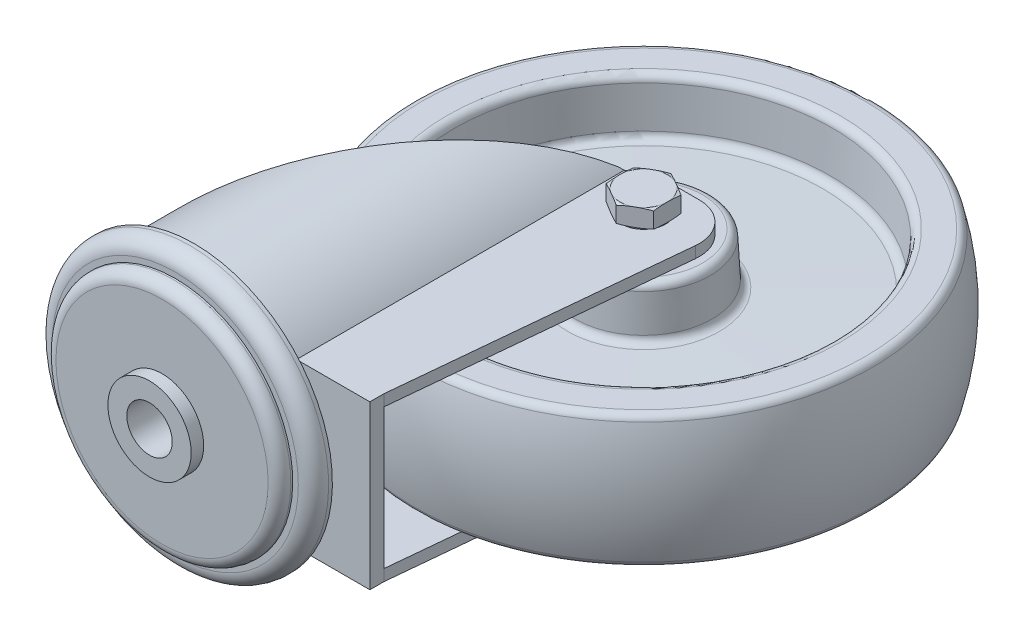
ISO-10303-21;
HEADER;
FILE_DESCRIPTION(('STEP AP214'),'2;1');
FILE_NAME('part.step','',(''),(''),'','','');
FILE_SCHEMA(('AUTOMOTIVE_DESIGN { 1 0 10303 214 1 1 1 1 }'));
ENDSEC;
DATA;
#1=APPLICATION_CONTEXT('core data for automotive mechanical design processes');
#2=APPLICATION_PROTOCOL_DEFINITION('international standard','automotive_design',2000,#1);
#3=PRODUCT_CONTEXT('',#1,'mechanical');
#4=PRODUCT('Part','Part','',(#3));
#5=PRODUCT_RELATED_PRODUCT_CATEGORY('part','',(#4));
#6=PRODUCT_DEFINITION_FORMATION('','',#4);
#7=PRODUCT_DEFINITION_CONTEXT('part definition',#1,'design');
#8=PRODUCT_DEFINITION('design','',#6,#7);
#9=PRODUCT_DEFINITION_SHAPE('','',#8);
#10=(LENGTH_UNIT() NAMED_UNIT(*) SI_UNIT(.MILLI.,.METRE.));
#11=(NAMED_UNIT(*) PLANE_ANGLE_UNIT() SI_UNIT($,.RADIAN.));
#12=(NAMED_UNIT(*) SI_UNIT($,.STERADIAN.) SOLID_ANGLE_UNIT());
#13=UNCERTAINTY_MEASURE_WITH_UNIT(LENGTH_MEASURE(1.E-05),#10,'distance_accuracy_value','');
#14=(GEOMETRIC_REPRESENTATION_CONTEXT(3) GLOBAL_UNCERTAINTY_ASSIGNED_CONTEXT((#13)) GLOBAL_UNIT_ASSIGNED_CONTEXT((#10,
#11,#12)) REPRESENTATION_CONTEXT('',''));
#15=CARTESIAN_POINT('',(0.,0.,0.));
#16=DIRECTION('',(0.,0.,1.));
#17=DIRECTION('',(1.,0.,0.));
#18=AXIS2_PLACEMENT_3D('',#15,#16,#17);
#19=CARTESIAN_POINT('',(21.39792913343,-17.5,-93.5));
#20=DIRECTION('',(0.,-1.,0.));
#21=DIRECTION('',(1.,0.,0.));
#22=AXIS2_PLACEMENT_3D('',#19,#20,#21);
#23=PLANE('',#22);
#24=CARTESIAN_POINT('',(37.,-17.5,-93.5));
#25=DIRECTION('',(0.,1.,0.));
#26=DIRECTION('',(-1.,0.,0.));
#27=AXIS2_PLACEMENT_3D('',#24,#25,#26);
#28=CIRCLE('',#27,7.5);
#29=CARTESIAN_POINT('',(29.5,-17.5,-93.5));
#30=VERTEX_POINT('',#29);
#31=EDGE_CURVE('E9',#30,#30,#28,.T.);
#32=ORIENTED_EDGE('',*,*,#31,.T.);
#33=EDGE_LOOP('',(#32));
#34=FACE_BOUND('',#33,.T.);
#35=CARTESIAN_POINT('',(37.,-17.5,-93.5));
#36=DIRECTION('',(0.,1.,0.));
#37=DIRECTION('',(-1.,0.,0.));
#38=AXIS2_PLACEMENT_3D('',#35,#36,#37);
#39=CIRCLE('',#38,15.60207086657);
#40=CARTESIAN_POINT('',(21.39792913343,-17.5,-93.5));
#41=VERTEX_POINT('',#40);
#42=EDGE_CURVE('E712',#41,#41,#39,.T.);
#43=ORIENTED_EDGE('',*,*,#42,.F.);
#44=EDGE_LOOP('',(#43));
#45=FACE_BOUND('',#44,.T.);
#46=ADVANCED_FACE('F14',(#34,#45),#23,.T.);
#47=CARTESIAN_POINT('',(29.5,17.5,-93.5));
#48=DIRECTION('',(0.,1.,0.));
#49=DIRECTION('',(-1.,0.,0.));
#50=AXIS2_PLACEMENT_3D('',#47,#48,#49);
#51=PLANE('',#50);
#52=CARTESIAN_POINT('',(37.,17.5,-93.5));
#53=DIRECTION('',(0.,1.,0.));
#54=DIRECTION('',(-1.,0.,0.));
#55=AXIS2_PLACEMENT_3D('',#52,#53,#54);
#56=CIRCLE('',#55,15.60207086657);
#57=CARTESIAN_POINT('',(21.39792913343,17.5,-93.5));
#58=VERTEX_POINT('',#57);
#59=EDGE_CURVE('E757',#58,#58,#56,.T.);
#60=ORIENTED_EDGE('',*,*,#59,.T.);
#61=EDGE_LOOP('',(#60));
#62=FACE_BOUND('',#61,.T.);
#63=CARTESIAN_POINT('',(37.,17.5,-93.5));
#64=DIRECTION('',(0.,1.,0.));
#65=DIRECTION('',(-1.,0.,0.));
#66=AXIS2_PLACEMENT_3D('',#63,#64,#65);
#67=CIRCLE('',#66,7.5);
#68=CARTESIAN_POINT('',(29.5,17.5,-93.5));
#69=VERTEX_POINT('',#68);
#70=EDGE_CURVE('E24',#69,#69,#67,.T.);
#71=ORIENTED_EDGE('',*,*,#70,.F.);
#72=EDGE_LOOP('',(#71));
#73=FACE_BOUND('',#72,.T.);
#74=ADVANCED_FACE('F1763',(#62,#73),#51,.T.);
#75=CARTESIAN_POINT('',(37.,15.500000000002,-93.5));
#76=DIRECTION('',(0.,1.,0.));
#77=DIRECTION('',(-1.,0.,0.));
#78=AXIS2_PLACEMENT_3D('',#75,#76,#77);
#79=TOROIDAL_SURFACE('',#78,15.6020708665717,1.99999999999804);
#80=CARTESIAN_POINT('',(37.,15.604671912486,-93.5));
#81=DIRECTION('',(0.,1.,0.));
#82=DIRECTION('',(-1.,0.,0.));
#83=AXIS2_PLACEMENT_3D('',#80,#81,#82);
#84=CIRCLE('',#83,17.599329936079);
#85=CARTESIAN_POINT('',(19.400670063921,15.604671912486,-93.5));
#86=VERTEX_POINT('',#85);
#87=EDGE_CURVE('E754',#86,#86,#84,.T.);
#88=ORIENTED_EDGE('',*,*,#87,.T.);
#89=EDGE_LOOP('',(#88));
#90=FACE_BOUND('',#89,.T.);
#91=ORIENTED_EDGE('',*,*,#59,.F.);
#92=EDGE_LOOP('',(#91));
#93=FACE_BOUND('',#92,.T.);
#94=ADVANCED_FACE('F1752',(#90,#93),#79,.T.);
#95=CARTESIAN_POINT('',(37.,15.604671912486,-93.5));
#96=DIRECTION('',(0.,-1.,0.));
#97=DIRECTION('',(1.,0.,0.));
#98=AXIS2_PLACEMENT_3D('',#95,#96,#97);
#99=CONICAL_SURFACE('',#98,17.599329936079,0.0523598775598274);
#100=CARTESIAN_POINT('',(37.,5.9445400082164,-93.5));
#101=DIRECTION('',(0.,1.,0.));
#102=DIRECTION('',(-1.,0.,0.));
#103=AXIS2_PLACEMENT_3D('',#100,#101,#102);
#104=CIRCLE('',#103,18.105595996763);
#105=CARTESIAN_POINT('',(18.894404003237,5.9445400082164,-93.5));
#106=VERTEX_POINT('',#105);
#107=EDGE_CURVE('E751',#106,#106,#104,.T.);
#108=ORIENTED_EDGE('',*,*,#107,.T.);
#109=EDGE_LOOP('',(#108));
#110=FACE_BOUND('',#109,.T.);
#111=ORIENTED_EDGE('',*,*,#87,.F.);
#112=EDGE_LOOP('',(#111));
#113=FACE_BOUND('',#112,.T.);
#114=ADVANCED_FACE('F1741',(#110,#113),#99,.T.);
#115=CARTESIAN_POINT('',(37.,6.04921192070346,-93.5));
#116=DIRECTION('',(0.,1.,0.));
#117=DIRECTION('',(-1.,0.,0.));
#118=AXIS2_PLACEMENT_3D('',#115,#116,#117);
#119=TOROIDAL_SURFACE('',#118,20.1028550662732,2.00000000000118);
#120=CARTESIAN_POINT('',(37.,4.0504302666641,-93.5));
#121=DIRECTION('',(0.,1.,0.));
#122=DIRECTION('',(-1.,0.,0.));
#123=AXIS2_PLACEMENT_3D('',#120,#121,#122);
#124=CIRCLE('',#123,20.033056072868);
#125=CARTESIAN_POINT('',(16.966943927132,4.0504302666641,-93.5));
#126=VERTEX_POINT('',#125);
#127=EDGE_CURVE('E748',#126,#126,#124,.T.);
#128=ORIENTED_EDGE('',*,*,#127,.T.);
#129=EDGE_LOOP('',(#128));
#130=FACE_BOUND('',#129,.T.);
#131=ORIENTED_EDGE('',*,*,#107,.F.);
#132=EDGE_LOOP('',(#131));
#133=FACE_BOUND('',#132,.T.);
#134=ADVANCED_FACE('F1730',(#130,#133),#119,.F.);
#135=CARTESIAN_POINT('',(37.,4.0504302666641,-93.5));
#136=DIRECTION('',(0.,-1.,0.));
#137=DIRECTION('',(1.,0.,0.));
#138=AXIS2_PLACEMENT_3D('',#135,#136,#137);
#139=CONICAL_SURFACE('',#138,20.033056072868,1.53588974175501);
#140=CARTESIAN_POINT('',(37.,3.0990338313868,-93.5));
#141=DIRECTION('',(0.,1.,0.));
#142=DIRECTION('',(-1.,0.,0.));
#143=AXIS2_PLACEMENT_3D('',#140,#141,#142);
#144=CIRCLE('',#143,47.277485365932);
#145=CARTESIAN_POINT('',(-10.277485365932,3.0990338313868,-93.5));
#146=VERTEX_POINT('',#145);
#147=EDGE_CURVE('E745',#146,#146,#144,.T.);
#148=ORIENTED_EDGE('',*,*,#147,.T.);
#149=EDGE_LOOP('',(#148));
#150=FACE_BOUND('',#149,.T.);
#151=ORIENTED_EDGE('',*,*,#127,.F.);
#152=EDGE_LOOP('',(#151));
#153=FACE_BOUND('',#152,.T.);
#154=ADVANCED_FACE('F1719',(#150,#153),#139,.T.);
#155=CARTESIAN_POINT('',(37.,5.0978154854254,-93.5));
#156=DIRECTION('',(0.,1.,0.));
#157=DIRECTION('',(-1.,0.,0.));
#158=AXIS2_PLACEMENT_3D('',#155,#156,#157);
#159=TOROIDAL_SURFACE('',#158,47.3472843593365,2.00000000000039);
#160=CARTESIAN_POINT('',(37.,4.9931435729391,-93.5));
#161=DIRECTION('',(0.,1.,0.));
#162=DIRECTION('',(-1.,0.,0.));
#163=AXIS2_PLACEMENT_3D('',#160,#161,#162);
#164=CIRCLE('',#163,49.344543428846);
#165=CARTESIAN_POINT('',(-12.344543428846,4.9931435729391,-93.5));
#166=VERTEX_POINT('',#165);
#167=EDGE_CURVE('E742',#166,#166,#164,.T.);
#168=ORIENTED_EDGE('',*,*,#167,.T.);
#169=EDGE_LOOP('',(#168));
#170=FACE_BOUND('',#169,.T.);
#171=ORIENTED_EDGE('',*,*,#147,.F.);
#172=EDGE_LOOP('',(#171));
#173=FACE_BOUND('',#172,.T.);
#174=ADVANCED_FACE('F1708',(#170,#173),#159,.F.);
#175=CARTESIAN_POINT('',(37.,4.9931435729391,-93.5));
#176=DIRECTION('',(0.,1.,0.));
#177=DIRECTION('',(-1.,0.,0.));
#178=AXIS2_PLACEMENT_3D('',#175,#176,#177);
#179=CONICAL_SURFACE('',#178,49.344543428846,0.0523598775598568);
#180=CARTESIAN_POINT('',(37.,15.604671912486,-93.5));
#181=DIRECTION('',(0.,1.,0.));
#182=DIRECTION('',(-1.,0.,0.));
#183=AXIS2_PLACEMENT_3D('',#180,#181,#182);
#184=CIRCLE('',#183,49.900670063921);
#185=CARTESIAN_POINT('',(-12.900670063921,15.604671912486,-93.5));
#186=VERTEX_POINT('',#185);
#187=EDGE_CURVE('E739',#186,#186,#184,.T.);
#188=ORIENTED_EDGE('',*,*,#187,.T.);
#189=EDGE_LOOP('',(#188));
#190=FACE_BOUND('',#189,.T.);
#191=ORIENTED_EDGE('',*,*,#167,.F.);
#192=EDGE_LOOP('',(#191));
#193=FACE_BOUND('',#192,.T.);
#194=ADVANCED_FACE('F1697',(#190,#193),#179,.F.);
#195=CARTESIAN_POINT('',(37.,15.500000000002,-93.5));
#196=DIRECTION('',(0.,1.,0.));
#197=DIRECTION('',(-1.,0.,0.));
#198=AXIS2_PLACEMENT_3D('',#195,#196,#197);
#199=TOROIDAL_SURFACE('',#198,51.8979291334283,1.99999999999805);
#200=CARTESIAN_POINT('',(37.,17.5,-93.5));
#201=DIRECTION('',(0.,1.,0.));
#202=DIRECTION('',(-1.,0.,0.));
#203=AXIS2_PLACEMENT_3D('',#200,#201,#202);
#204=CIRCLE('',#203,51.89792913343);
#205=CARTESIAN_POINT('',(-14.89792913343,17.5,-93.5));
#206=VERTEX_POINT('',#205);
#207=EDGE_CURVE('E736',#206,#206,#204,.T.);
#208=ORIENTED_EDGE('',*,*,#207,.T.);
#209=EDGE_LOOP('',(#208));
#210=FACE_BOUND('',#209,.T.);
#211=ORIENTED_EDGE('',*,*,#187,.F.);
#212=EDGE_LOOP('',(#211));
#213=FACE_BOUND('',#212,.T.);
#214=ADVANCED_FACE('F1687',(#210,#213),#199,.T.);
#215=CARTESIAN_POINT('',(-14.89792913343,17.5,-93.5));
#216=DIRECTION('',(0.,1.,0.));
#217=DIRECTION('',(-1.,0.,0.));
#218=AXIS2_PLACEMENT_3D('',#215,#216,#217);
#219=PLANE('',#218);
#220=CARTESIAN_POINT('',(37.,17.5,-93.5));
#221=DIRECTION('',(0.,1.,0.));
#222=DIRECTION('',(-1.,0.,0.));
#223=AXIS2_PLACEMENT_3D('',#220,#221,#222);
#224=CIRCLE('',#223,58.480766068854);
#225=CARTESIAN_POINT('',(-21.480766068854,17.5,-93.5));
#226=VERTEX_POINT('',#225);
#227=EDGE_CURVE('E709',#226,#226,#224,.T.);
#228=ORIENTED_EDGE('',*,*,#227,.T.);
#229=EDGE_LOOP('',(#228));
#230=FACE_BOUND('',#229,.T.);
#231=ORIENTED_EDGE('',*,*,#207,.F.);
#232=EDGE_LOOP('',(#231));
#233=FACE_BOUND('',#232,.T.);
#234=ADVANCED_FACE('F1677',(#230,#233),#219,.T.);
#235=CARTESIAN_POINT('',(-19.5,-17.5,-93.5));
#236=DIRECTION('',(0.,-1.,0.));
#237=DIRECTION('',(1.,0.,0.));
#238=AXIS2_PLACEMENT_3D('',#235,#236,#237);
#239=PLANE('',#238);
#240=CARTESIAN_POINT('',(37.,-17.5,-93.5));
#241=DIRECTION('',(0.,1.,0.));
#242=DIRECTION('',(-1.,0.,0.));
#243=AXIS2_PLACEMENT_3D('',#240,#241,#242);
#244=CIRCLE('',#243,51.89792913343);
#245=CARTESIAN_POINT('',(-14.89792913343,-17.5,-93.5));
#246=VERTEX_POINT('',#245);
#247=EDGE_CURVE('E733',#246,#246,#244,.T.);
#248=ORIENTED_EDGE('',*,*,#247,.T.);
#249=EDGE_LOOP('',(#248));
#250=FACE_BOUND('',#249,.T.);
#251=CARTESIAN_POINT('',(37.,-17.5,-93.5));
#252=DIRECTION('',(0.,1.,0.));
#253=DIRECTION('',(-1.,0.,0.));
#254=AXIS2_PLACEMENT_3D('',#251,#252,#253);
#255=CIRCLE('',#254,58.480766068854);
#256=CARTESIAN_POINT('',(-21.480766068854,-17.5,-93.5));
#257=VERTEX_POINT('',#256);
#258=EDGE_CURVE('E699',#257,#257,#255,.T.);
#259=ORIENTED_EDGE('',*,*,#258,.F.);
#260=EDGE_LOOP('',(#259));
#261=FACE_BOUND('',#260,.T.);
#262=ADVANCED_FACE('F1666',(#250,#261),#239,.T.);
#263=CARTESIAN_POINT('',(37.,-15.500000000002,-93.5));
#264=DIRECTION('',(0.,1.,0.));
#265=DIRECTION('',(-1.,0.,0.));
#266=AXIS2_PLACEMENT_3D('',#263,#264,#265);
#267=TOROIDAL_SURFACE('',#266,51.8979291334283,1.99999999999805);
#268=CARTESIAN_POINT('',(37.,-15.604671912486,-93.5));
#269=DIRECTION('',(0.,1.,0.));
#270=DIRECTION('',(-1.,0.,0.));
#271=AXIS2_PLACEMENT_3D('',#268,#269,#270);
#272=CIRCLE('',#271,49.900670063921);
#273=CARTESIAN_POINT('',(-12.900670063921,-15.604671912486,-93.5));
#274=VERTEX_POINT('',#273);
#275=EDGE_CURVE('E730',#274,#274,#272,.T.);
#276=ORIENTED_EDGE('',*,*,#275,.T.);
#277=EDGE_LOOP('',(#276));
#278=FACE_BOUND('',#277,.T.);
#279=ORIENTED_EDGE('',*,*,#247,.F.);
#280=EDGE_LOOP('',(#279));
#281=FACE_BOUND('',#280,.T.);
#282=ADVANCED_FACE('F1655',(#278,#281),#267,.T.);
#283=CARTESIAN_POINT('',(37.,-15.604671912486,-93.5));
#284=DIRECTION('',(0.,-1.,0.));
#285=DIRECTION('',(1.,0.,0.));
#286=AXIS2_PLACEMENT_3D('',#283,#284,#285);
#287=CONICAL_SURFACE('',#286,49.900670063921,0.0523598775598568);
#288=CARTESIAN_POINT('',(37.,-4.9931435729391,-93.5));
#289=DIRECTION('',(0.,1.,0.));
#290=DIRECTION('',(-1.,0.,0.));
#291=AXIS2_PLACEMENT_3D('',#288,#289,#290);
#292=CIRCLE('',#291,49.344543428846);
#293=CARTESIAN_POINT('',(-12.344543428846,-4.9931435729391,-93.5));
#294=VERTEX_POINT('',#293);
#295=EDGE_CURVE('E727',#294,#294,#292,.T.);
#296=ORIENTED_EDGE('',*,*,#295,.T.);
#297=EDGE_LOOP('',(#296));
#298=FACE_BOUND('',#297,.T.);
#299=ORIENTED_EDGE('',*,*,#275,.F.);
#300=EDGE_LOOP('',(#299));
#301=FACE_BOUND('',#300,.T.);
#302=ADVANCED_FACE('F1644',(#298,#301),#287,.F.);
#303=CARTESIAN_POINT('',(37.,-5.0978154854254,-93.5));
#304=DIRECTION('',(0.,1.,0.));
#305=DIRECTION('',(-1.,0.,0.));
#306=AXIS2_PLACEMENT_3D('',#303,#304,#305);
#307=TOROIDAL_SURFACE('',#306,47.3472843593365,2.00000000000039);
#308=CARTESIAN_POINT('',(37.,-3.09903383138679,-93.5));
#309=DIRECTION('',(0.,1.,0.));
#310=DIRECTION('',(-1.,0.,0.));
#311=AXIS2_PLACEMENT_3D('',#308,#309,#310);
#312=CIRCLE('',#311,47.277485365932);
#313=CARTESIAN_POINT('',(-10.277485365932,-3.09903383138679,-93.5));
#314=VERTEX_POINT('',#313);
#315=EDGE_CURVE('E724',#314,#314,#312,.T.);
#316=ORIENTED_EDGE('',*,*,#315,.T.);
#317=EDGE_LOOP('',(#316));
#318=FACE_BOUND('',#317,.T.);
#319=ORIENTED_EDGE('',*,*,#295,.F.);
#320=EDGE_LOOP('',(#319));
#321=FACE_BOUND('',#320,.T.);
#322=ADVANCED_FACE('F1633',(#318,#321),#307,.F.);
#323=CARTESIAN_POINT('',(37.,-3.09903383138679,-93.5));
#324=DIRECTION('',(0.,1.,0.));
#325=DIRECTION('',(-1.,0.,0.));
#326=AXIS2_PLACEMENT_3D('',#323,#324,#325);
#327=CONICAL_SURFACE('',#326,47.277485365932,1.53588974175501);
#328=CARTESIAN_POINT('',(37.,-4.0504302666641,-93.5));
#329=DIRECTION('',(0.,1.,0.));
#330=DIRECTION('',(-1.,0.,0.));
#331=AXIS2_PLACEMENT_3D('',#328,#329,#330);
#332=CIRCLE('',#331,20.033056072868);
#333=CARTESIAN_POINT('',(16.966943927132,-4.0504302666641,-93.5));
#334=VERTEX_POINT('',#333);
#335=EDGE_CURVE('E721',#334,#334,#332,.T.);
#336=ORIENTED_EDGE('',*,*,#335,.T.);
#337=EDGE_LOOP('',(#336));
#338=FACE_BOUND('',#337,.T.);
#339=ORIENTED_EDGE('',*,*,#315,.F.);
#340=EDGE_LOOP('',(#339));
#341=FACE_BOUND('',#340,.T.);
#342=ADVANCED_FACE('F1622',(#338,#341),#327,.T.);
#343=CARTESIAN_POINT('',(37.,-6.04921192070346,-93.5));
#344=DIRECTION('',(0.,1.,0.));
#345=DIRECTION('',(-1.,0.,0.));
#346=AXIS2_PLACEMENT_3D('',#343,#344,#345);
#347=TOROIDAL_SURFACE('',#346,20.1028550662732,2.00000000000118);
#348=CARTESIAN_POINT('',(37.,-5.9445400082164,-93.5));
#349=DIRECTION('',(0.,1.,0.));
#350=DIRECTION('',(-1.,0.,0.));
#351=AXIS2_PLACEMENT_3D('',#348,#349,#350);
#352=CIRCLE('',#351,18.105595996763);
#353=CARTESIAN_POINT('',(18.894404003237,-5.9445400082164,-93.5));
#354=VERTEX_POINT('',#353);
#355=EDGE_CURVE('E718',#354,#354,#352,.T.);
#356=ORIENTED_EDGE('',*,*,#355,.T.);
#357=EDGE_LOOP('',(#356));
#358=FACE_BOUND('',#357,.T.);
#359=ORIENTED_EDGE('',*,*,#335,.F.);
#360=EDGE_LOOP('',(#359));
#361=FACE_BOUND('',#360,.T.);
#362=ADVANCED_FACE('F1611',(#358,#361),#347,.F.);
#363=CARTESIAN_POINT('',(37.,-5.9445400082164,-93.5));
#364=DIRECTION('',(0.,1.,0.));
#365=DIRECTION('',(-1.,0.,0.));
#366=AXIS2_PLACEMENT_3D('',#363,#364,#365);
#367=CONICAL_SURFACE('',#366,18.105595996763,0.0523598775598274);
#368=CARTESIAN_POINT('',(37.,-15.604671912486,-93.5));
#369=DIRECTION('',(0.,1.,0.));
#370=DIRECTION('',(-1.,0.,0.));
#371=AXIS2_PLACEMENT_3D('',#368,#369,#370);
#372=CIRCLE('',#371,17.599329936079);
#373=CARTESIAN_POINT('',(19.400670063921,-15.604671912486,-93.5));
#374=VERTEX_POINT('',#373);
#375=EDGE_CURVE('E715',#374,#374,#372,.T.);
#376=ORIENTED_EDGE('',*,*,#375,.T.);
#377=EDGE_LOOP('',(#376));
#378=FACE_BOUND('',#377,.T.);
#379=ORIENTED_EDGE('',*,*,#355,.F.);
#380=EDGE_LOOP('',(#379));
#381=FACE_BOUND('',#380,.T.);
#382=ADVANCED_FACE('F1600',(#378,#381),#367,.T.);
#383=CARTESIAN_POINT('',(37.,-15.500000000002,-93.5));
#384=DIRECTION('',(0.,1.,0.));
#385=DIRECTION('',(-1.,0.,0.));
#386=AXIS2_PLACEMENT_3D('',#383,#384,#385);
#387=TOROIDAL_SURFACE('',#386,15.6020708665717,1.99999999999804);
#388=ORIENTED_EDGE('',*,*,#42,.T.);
#389=EDGE_LOOP('',(#388));
#390=FACE_BOUND('',#389,.T.);
#391=ORIENTED_EDGE('',*,*,#375,.F.);
#392=EDGE_LOOP('',(#391));
#393=FACE_BOUND('',#392,.T.);
#394=ADVANCED_FACE('F1589',(#390,#393),#387,.T.);
#395=CARTESIAN_POINT('',(37.,15.5,-93.5));
#396=DIRECTION('',(0.,1.,0.));
#397=DIRECTION('',(-1.,0.,0.));
#398=AXIS2_PLACEMENT_3D('',#395,#396,#397);
#399=TOROIDAL_SURFACE('',#398,58.4807660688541,1.99999999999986);
#400=CARTESIAN_POINT('',(37.,16.012396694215,-93.5));
#401=DIRECTION('',(0.,1.,0.));
#402=DIRECTION('',(-1.,0.,0.));
#403=AXIS2_PLACEMENT_3D('',#400,#401,#402);
#404=CIRCLE('',#403,60.41401453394);
#405=CARTESIAN_POINT('',(-23.41401453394,16.012396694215,-93.5));
#406=VERTEX_POINT('',#405);
#407=EDGE_CURVE('E706',#406,#406,#404,.T.);
#408=ORIENTED_EDGE('',*,*,#407,.T.);
#409=EDGE_LOOP('',(#408));
#410=FACE_BOUND('',#409,.T.);
#411=ORIENTED_EDGE('',*,*,#227,.F.);
#412=EDGE_LOOP('',(#411));
#413=FACE_BOUND('',#412,.T.);
#414=ADVANCED_FACE('F1578',(#410,#413),#399,.T.);
#415=CARTESIAN_POINT('',(37.000000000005,0.,-93.5));
#416=DIRECTION('',(0.,1.,0.));
#417=DIRECTION('',(-1.,0.,0.));
#418=AXIS2_PLACEMENT_3D('',#415,#416,#417);
#419=SPHERICAL_SURFACE('',#418,62.500000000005);
#420=CARTESIAN_POINT('',(37.,-16.0123966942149,-93.5));
#421=DIRECTION('',(0.,1.,0.));
#422=DIRECTION('',(-1.,0.,0.));
#423=AXIS2_PLACEMENT_3D('',#420,#421,#422);
#424=CIRCLE('',#423,60.41401453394);
#425=CARTESIAN_POINT('',(-23.41401453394,-16.0123966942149,-93.5));
#426=VERTEX_POINT('',#425);
#427=EDGE_CURVE('E702',#426,#426,#424,.T.);
#428=CARTESIAN_POINT('',(-23.41401453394,-16.0123966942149,-93.5));
#429=CARTESIAN_POINT('',(-23.5004441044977,-15.6863030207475,-93.5));
#430=CARTESIAN_POINT('',(-23.5842329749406,-15.3595094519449,-93.5));
#431=CARTESIAN_POINT('',(-23.7465084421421,-14.704608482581,-93.5));
#432=CARTESIAN_POINT('',(-23.8249950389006,-14.3765010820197,-93.5));
#433=CARTESIAN_POINT('',(-23.9766450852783,-13.7190584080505,-93.5));
#434=CARTESIAN_POINT('',(-24.0498085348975,-13.3897231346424,-93.5));
#435=CARTESIAN_POINT('',(-24.190793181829,-12.729911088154,-93.5));
#436=CARTESIAN_POINT('',(-24.2586143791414,-12.3994343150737,-93.5));
#437=CARTESIAN_POINT('',(-24.3888967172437,-11.7374259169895,-93.5));
#438=CARTESIAN_POINT('',(-24.4513578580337,-11.4058942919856,-93.5));
#439=CARTESIAN_POINT('',(-24.5709037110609,-10.741863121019,-93.5));
#440=CARTESIAN_POINT('',(-24.6279884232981,-10.4093635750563,-93.5));
#441=CARTESIAN_POINT('',(-24.7367664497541,-9.74348374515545,-93.5));
#442=CARTESIAN_POINT('',(-24.7884597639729,-9.41010346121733,-93.5));
#443=CARTESIAN_POINT('',(-24.8864414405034,-8.74254956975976,-93.5));
#444=CARTESIAN_POINT('',(-24.9327298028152,-8.4083759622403,-93.5));
#445=CARTESIAN_POINT('',(-25.0198894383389,-7.73932304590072,-93.5));
#446=CARTESIAN_POINT('',(-25.0607607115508,-7.40444373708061,-93.5));
#447=CARTESIAN_POINT('',(-25.1370754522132,-6.73406722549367,-93.5));
#448=CARTESIAN_POINT('',(-25.1725189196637,-6.39857002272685,-93.5));
#449=CARTESIAN_POINT('',(-25.2379687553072,-5.72704569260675,-93.5));
#450=CARTESIAN_POINT('',(-25.2679751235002,-5.39101856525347,-93.5));
#451=CARTESIAN_POINT('',(-25.3225428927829,-4.71852249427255,-93.5));
#452=CARTESIAN_POINT('',(-25.3471042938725,-4.3820535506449,-93.5));
#453=CARTESIAN_POINT('',(-25.3907756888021,-3.70876207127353,-93.5));
#454=CARTESIAN_POINT('',(-25.4098856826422,-3.37193953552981,-93.5));
#455=CARTESIAN_POINT('',(-25.4426492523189,-2.6980291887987,-93.5));
#456=CARTESIAN_POINT('',(-25.4563028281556,-2.36094137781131,-93.5));
#457=CARTESIAN_POINT('',(-25.4781499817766,-1.68658886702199,-93.5));
#458=CARTESIAN_POINT('',(-25.486343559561,-1.34932416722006,-93.5));
#459=CARTESIAN_POINT('',(-25.4972685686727,-0.674706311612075,-93.5));
#460=CARTESIAN_POINT('',(-25.5,-0.337353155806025,-93.5));
#461=CARTESIAN_POINT('',(-25.5,0.337353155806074,-93.5));
#462=CARTESIAN_POINT('',(-25.4972685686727,0.674706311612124,-93.5));
#463=CARTESIAN_POINT('',(-25.486343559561,1.34932416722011,-93.5));
#464=CARTESIAN_POINT('',(-25.4781499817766,1.68658886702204,-93.5));
#465=CARTESIAN_POINT('',(-25.4563028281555,2.36094137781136,-93.5));
#466=CARTESIAN_POINT('',(-25.4426492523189,2.69802918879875,-93.5));
#467=CARTESIAN_POINT('',(-25.4098856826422,3.37193953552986,-93.5));
#468=CARTESIAN_POINT('',(-25.3907756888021,3.70876207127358,-93.5));
#469=CARTESIAN_POINT('',(-25.3471042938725,4.38205355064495,-93.5));
#470=CARTESIAN_POINT('',(-25.3225428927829,4.7185224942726,-93.5));
#471=CARTESIAN_POINT('',(-25.2679751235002,5.39101856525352,-93.5));
#472=CARTESIAN_POINT('',(-25.2379687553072,5.72704569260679,-93.5));
#473=CARTESIAN_POINT('',(-25.1725189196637,6.39857002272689,-93.5));
#474=CARTESIAN_POINT('',(-25.1370754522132,6.73406722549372,-93.5));
#475=CARTESIAN_POINT('',(-25.0607607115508,7.40444373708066,-93.5));
#476=CARTESIAN_POINT('',(-25.0198894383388,7.73932304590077,-93.5));
#477=CARTESIAN_POINT('',(-24.9327298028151,8.40837596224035,-93.5));
#478=CARTESIAN_POINT('',(-24.8864414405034,8.74254956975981,-93.5));
#479=CARTESIAN_POINT('',(-24.7884597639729,9.41010346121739,-93.5));
#480=CARTESIAN_POINT('',(-24.7367664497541,9.7434837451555,-93.5));
#481=CARTESIAN_POINT('',(-24.6279884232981,10.4093635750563,-93.5));
#482=CARTESIAN_POINT('',(-24.5709037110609,10.7418631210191,-93.5));
#483=CARTESIAN_POINT('',(-24.4513578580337,11.4058942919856,-93.5));
#484=CARTESIAN_POINT('',(-24.3888967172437,11.7374259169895,-93.5));
#485=CARTESIAN_POINT('',(-24.2586143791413,12.3994343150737,-93.5));
#486=CARTESIAN_POINT('',(-24.190793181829,12.7299110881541,-93.5));
#487=CARTESIAN_POINT('',(-24.0498085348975,13.3897231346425,-93.5));
#488=CARTESIAN_POINT('',(-23.9766450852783,13.7190584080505,-93.5));
#489=CARTESIAN_POINT('',(-23.8249950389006,14.3765010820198,-93.5));
#490=CARTESIAN_POINT('',(-23.7465084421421,14.704608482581,-93.5));
#491=CARTESIAN_POINT('',(-23.5842329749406,15.3595094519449,-93.5));
#492=CARTESIAN_POINT('',(-23.5004441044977,15.6863030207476,-93.5));
#493=CARTESIAN_POINT('',(-23.41401453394,16.012396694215,-93.5));
#494=B_SPLINE_CURVE_WITH_KNOTS('',3,(#428,#429,#430,#431,#432,#433,#434,#435,#436,#437,#438,
#439,#440,#441,#442,#443,#444,#445,#446,#447,#448,#449,#450,#451,#452,#453,#454,#455,#456,#457,
#458,#459,#460,#461,#462,#463,#464,#465,#466,#467,#468,#469,#470,#471,#472,#473,#474,#475,#476,
#477,#478,#479,#480,#481,#482,#483,#484,#485,#486,#487,#488,#489,#490,#491,#492,#493),
.UNSPECIFIED.,.F.,.F.,(4,2,2,2,2,2,2,2,2,2,2,2,2,2,2,2,2,2,2,2,2,2,2,2,2,2,2,2,2,2,2,2,4),(0.,
1.01204841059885,2.02409682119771,3.03614523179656,4.04819364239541,5.06024205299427,
6.07229046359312,7.08433887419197,8.09638728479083,9.10843569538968,10.1204841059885,
11.1325325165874,12.1445809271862,13.1566293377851,14.1686777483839,15.1807261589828,
16.1927745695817,17.2048229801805,18.2168713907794,19.2289198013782,20.2409682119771,
21.2530166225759,22.2650650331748,23.2771134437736,24.2891618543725,25.3012102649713,
26.3132586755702,27.325307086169,28.3373554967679,29.3494039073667,30.3614523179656,
31.3735007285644,32.3855491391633),.UNSPECIFIED.);
#495=EDGE_CURVE('BSEAM1566',#426,#406,#494,.T.);
#496=ORIENTED_EDGE('',*,*,#427,.T.);
#497=ORIENTED_EDGE('',*,*,#407,.F.);
#498=ORIENTED_EDGE('',*,*,#495,.T.);
#499=ORIENTED_EDGE('',*,*,#495,.F.);
#500=EDGE_LOOP('',(#496,#498,#497,#499));
#501=FACE_BOUND('',#500,.T.);
#502=ADVANCED_FACE('F1566',(#501),#419,.T.);
#503=CARTESIAN_POINT('',(37.,-15.5,-93.5));
#504=DIRECTION('',(0.,1.,0.));
#505=DIRECTION('',(-1.,0.,0.));
#506=AXIS2_PLACEMENT_3D('',#503,#504,#505);
#507=TOROIDAL_SURFACE('',#506,58.4807660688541,1.99999999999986);
#508=ORIENTED_EDGE('',*,*,#258,.T.);
#509=EDGE_LOOP('',(#508));
#510=FACE_BOUND('',#509,.T.);
#511=ORIENTED_EDGE('',*,*,#427,.F.);
#512=EDGE_LOOP('',(#511));
#513=FACE_BOUND('',#512,.T.);
#514=ADVANCED_FACE('F487',(#510,#513),#507,.T.);
#515=CARTESIAN_POINT('',(37.,-32.5,-96.733));
#516=DIRECTION('',(0.,-1.,0.));
#517=DIRECTION('',(-1.,0.,0.));
#518=AXIS2_PLACEMENT_3D('',#515,#516,#517);
#519=PLANE('',#518);
#520=CARTESIAN_POINT('',(37.,-32.5,-93.5));
#521=DIRECTION('',(0.,1.,0.));
#522=DIRECTION('',(1.,0.,0.));
#523=AXIS2_PLACEMENT_3D('',#520,#521,#522);
#524=CIRCLE('',#523,3.233);
#525=CARTESIAN_POINT('',(40.233,-32.5,-93.5));
#526=VERTEX_POINT('',#525);
#527=EDGE_CURVE('E2651',#526,#526,#524,.T.);
#528=ORIENTED_EDGE('',*,*,#527,.F.);
#529=EDGE_LOOP('',(#528));
#530=FACE_BOUND('',#529,.T.);
#531=ADVANCED_FACE('F473',(#530),#519,.T.);
#532=CARTESIAN_POINT('',(37.,-31.733,-93.5));
#533=DIRECTION('',(0.,1.,0.));
#534=DIRECTION('',(1.,0.,0.));
#535=AXIS2_PLACEMENT_3D('',#532,#533,#534);
#536=CONICAL_SURFACE('',#535,4.,0.78539816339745);
#537=ORIENTED_EDGE('',*,*,#527,.T.);
#538=EDGE_LOOP('',(#537));
#539=FACE_BOUND('',#538,.T.);
#540=CARTESIAN_POINT('',(37.,-31.733,-93.5));
#541=DIRECTION('',(0.,1.,0.));
#542=DIRECTION('',(1.,0.,0.));
#543=AXIS2_PLACEMENT_3D('',#540,#541,#542);
#544=CIRCLE('',#543,4.);
#545=CARTESIAN_POINT('',(41.,-31.733,-93.5));
#546=VERTEX_POINT('',#545);
#547=EDGE_CURVE('E2654',#546,#546,#544,.T.);
#548=ORIENTED_EDGE('',*,*,#547,.F.);
#549=EDGE_LOOP('',(#548));
#550=FACE_BOUND('',#549,.T.);
#551=ADVANCED_FACE('F1536',(#539,#550),#536,.T.);
#552=CARTESIAN_POINT('',(37.,-32.5,-93.5));
#553=DIRECTION('',(0.,1.,0.));
#554=DIRECTION('',(1.,0.,0.));
#555=AXIS2_PLACEMENT_3D('',#552,#553,#554);
#556=CYLINDRICAL_SURFACE('',#555,4.);
#557=ORIENTED_EDGE('',*,*,#547,.T.);
#558=EDGE_LOOP('',(#557));
#559=FACE_BOUND('',#558,.T.);
#560=CARTESIAN_POINT('',(37.,-29.5,-93.5));
#561=DIRECTION('',(0.,1.,0.));
#562=DIRECTION('',(1.,0.,0.));
#563=AXIS2_PLACEMENT_3D('',#560,#561,#562);
#564=CIRCLE('',#563,4.);
#565=CARTESIAN_POINT('',(41.,-29.5,-93.5));
#566=VERTEX_POINT('',#565);
#567=EDGE_CURVE('E2743',#566,#566,#564,.T.);
#568=ORIENTED_EDGE('',*,*,#567,.F.);
#569=EDGE_LOOP('',(#568));
#570=FACE_BOUND('',#569,.T.);
#571=ADVANCED_FACE('F1526',(#559,#570),#556,.T.);
#572=CARTESIAN_POINT('',(37.,-29.5,-97.5));
#573=DIRECTION('',(0.,1.,0.));
#574=DIRECTION('',(1.,0.,0.));
#575=AXIS2_PLACEMENT_3D('',#572,#573,#574);
#576=PLANE('',#575);
#577=CARTESIAN_POINT('',(37.,-29.5,-93.5));
#578=DIRECTION('',(0.,1.,0.));
#579=DIRECTION('',(1.,0.,0.));
#580=AXIS2_PLACEMENT_3D('',#577,#578,#579);
#581=CIRCLE('',#580,5.815);
#582=CARTESIAN_POINT('',(42.815,-29.5,-93.5));
#583=VERTEX_POINT('',#582);
#584=EDGE_CURVE('E850',#583,#583,#581,.T.);
#585=ORIENTED_EDGE('',*,*,#584,.F.);
#586=EDGE_LOOP('',(#585));
#587=FACE_BOUND('',#586,.T.);
#588=ORIENTED_EDGE('',*,*,#567,.T.);
#589=EDGE_LOOP('',(#588));
#590=FACE_BOUND('',#589,.T.);
#591=ADVANCED_FACE('F430',(#587,#590),#576,.F.);
#592=CARTESIAN_POINT('',(37.,26.8,-93.5));
#593=DIRECTION('',(0.,1.,0.));
#594=DIRECTION('',(1.,0.,0.));
#595=AXIS2_PLACEMENT_3D('',#592,#593,#594);
#596=PLANE('',#595);
#597=CARTESIAN_POINT('',(37.,26.8,-93.5));
#598=DIRECTION('',(0.,1.,0.));
#599=DIRECTION('',(1.,0.,0.));
#600=AXIS2_PLACEMENT_3D('',#597,#598,#599);
#601=CIRCLE('',#600,6.2583333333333);
#602=CARTESIAN_POINT('',(43.2583333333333,26.8,-93.5));
#603=VERTEX_POINT('',#602);
#604=CARTESIAN_POINT('',(40.1291666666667,26.8,-98.9198756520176));
#605=VERTEX_POINT('',#604);
#606=EDGE_CURVE('E304',#603,#605,#601,.T.);
#607=ORIENTED_EDGE('',*,*,#606,.T.);
#608=CARTESIAN_POINT('',(33.8708333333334,26.8,-98.9198756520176));
#609=VERTEX_POINT('',#608);
#610=EDGE_CURVE('E314',#605,#609,#601,.T.);
#611=ORIENTED_EDGE('',*,*,#610,.T.);
#612=CARTESIAN_POINT('',(30.7416666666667,26.8,-93.5));
#613=VERTEX_POINT('',#612);
#614=EDGE_CURVE('E318',#609,#613,#601,.T.);
#615=ORIENTED_EDGE('',*,*,#614,.T.);
#616=CARTESIAN_POINT('',(33.8708333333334,26.8,-88.0801243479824));
#617=VERTEX_POINT('',#616);
#618=EDGE_CURVE('E2725',#613,#617,#601,.T.);
#619=ORIENTED_EDGE('',*,*,#618,.T.);
#620=CARTESIAN_POINT('',(40.1291666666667,26.8,-88.0801243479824));
#621=VERTEX_POINT('',#620);
#622=EDGE_CURVE('E307',#617,#621,#601,.T.);
#623=ORIENTED_EDGE('',*,*,#622,.T.);
#624=EDGE_CURVE('E296',#621,#603,#601,.T.);
#625=ORIENTED_EDGE('',*,*,#624,.T.);
#626=EDGE_LOOP('',(#607,#611,#615,#619,#623,#625));
#627=FACE_BOUND('',#626,.T.);
#628=ADVANCED_FACE('F302',(#627),#596,.T.);
#629=CARTESIAN_POINT('',(37.,-29.5,-93.5));
#630=DIRECTION('',(0.,1.,0.));
#631=DIRECTION('',(1.,0.,0.));
#632=AXIS2_PLACEMENT_3D('',#629,#630,#631);
#633=CYLINDRICAL_SURFACE('',#632,5.815);
#634=CARTESIAN_POINT('',(37.,-27.,-93.5));
#635=DIRECTION('',(0.,1.,0.));
#636=DIRECTION('',(1.,0.,0.));
#637=AXIS2_PLACEMENT_3D('',#634,#635,#636);
#638=CIRCLE('',#637,5.815);
#639=CARTESIAN_POINT('',(42.815,-27.,-93.5));
#640=VERTEX_POINT('',#639);
#641=EDGE_CURVE('E848',#640,#640,#638,.T.);
#642=ORIENTED_EDGE('',*,*,#641,.F.);
#643=EDGE_LOOP('',(#642));
#644=FACE_BOUND('',#643,.T.);
#645=ORIENTED_EDGE('',*,*,#584,.T.);
#646=EDGE_LOOP('',(#645));
#647=FACE_BOUND('',#646,.T.);
#648=ADVANCED_FACE('F1348',(#644,#647),#633,.T.);
#649=CARTESIAN_POINT('',(37.,26.8,-93.5));
#650=DIRECTION('',(0.,-1.,0.));
#651=DIRECTION('',(-1.,0.,0.));
#652=AXIS2_PLACEMENT_3D('',#649,#650,#651);
#653=CONICAL_SURFACE('',#652,6.2583333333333,1.30899693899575);
#654=CARTESIAN_POINT('',(30.7416666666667,25.415610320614,-83.9416186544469));
#655=CARTESIAN_POINT('',(30.7416666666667,25.4792409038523,-84.2255412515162));
#656=CARTESIAN_POINT('',(30.7416666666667,25.5420932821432,-84.5096414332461));
#657=CARTESIAN_POINT('',(30.7416666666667,25.6658215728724,-85.0782841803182));
#658=CARTESIAN_POINT('',(30.7416666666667,25.7266973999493,-85.3628267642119));
#659=CARTESIAN_POINT('',(30.7416666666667,25.8461055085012,-85.9326964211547));
#660=CARTESIAN_POINT('',(30.7416666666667,25.9046354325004,-86.2180239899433));
#661=CARTESIAN_POINT('',(30.7416666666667,26.018719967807,-86.789273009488));
#662=CARTESIAN_POINT('',(30.7416666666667,26.0742746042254,-87.0751944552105));
#663=CARTESIAN_POINT('',(30.7416666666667,26.1812719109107,-87.6454542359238));
#664=CARTESIAN_POINT('',(30.7416666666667,26.2327437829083,-87.9297870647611));
#665=CARTESIAN_POINT('',(30.7416666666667,26.3311937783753,-88.4992282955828));
#666=CARTESIAN_POINT('',(30.7416666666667,26.3781720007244,-88.7843366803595));
#667=CARTESIAN_POINT('',(30.7416666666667,26.466576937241,-89.3553843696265));
#668=CARTESIAN_POINT('',(30.7416666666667,26.5080043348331,-89.6413235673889));
#669=CARTESIAN_POINT('',(30.7416666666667,26.5840868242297,-90.2141118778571));
#670=CARTESIAN_POINT('',(30.7416666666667,26.6187419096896,-90.5009609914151));
#671=CARTESIAN_POINT('',(30.7416666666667,26.6802984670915,-91.0788053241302));
#672=CARTESIAN_POINT('',(30.7416666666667,26.7071071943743,-91.3698105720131));
#673=CARTESIAN_POINT('',(30.7416666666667,26.7511216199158,-91.9525526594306));
#674=CARTESIAN_POINT('',(30.7416666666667,26.7683275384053,-92.2442894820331));
#675=CARTESIAN_POINT('',(30.7416666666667,26.7921328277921,-92.8280715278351));
#676=CARTESIAN_POINT('',(30.7416666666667,26.7987370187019,-93.1201165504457));
#677=CARTESIAN_POINT('',(30.7416666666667,26.8009328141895,-93.7042485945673));
#678=CARTESIAN_POINT('',(30.7416666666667,26.7965244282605,-93.9963356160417));
#679=CARTESIAN_POINT('',(30.7416666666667,26.7769429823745,-94.5812041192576));
#680=CARTESIAN_POINT('',(30.7416666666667,26.7617308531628,-94.8739842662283));
#681=CARTESIAN_POINT('',(30.7416666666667,26.7214102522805,-95.4588560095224));
#682=CARTESIAN_POINT('',(30.7416666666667,26.6963015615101,-95.7509475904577));
#683=CARTESIAN_POINT('',(30.7416666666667,26.6374561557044,-96.3344397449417));
#684=CARTESIAN_POINT('',(30.7416666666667,26.6037138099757,-96.6258397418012));
#685=CARTESIAN_POINT('',(30.7416666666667,26.5290051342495,-97.2077019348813));
#686=CARTESIAN_POINT('',(30.7416666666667,26.4880387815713,-97.4981641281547));
#687=CARTESIAN_POINT('',(30.7416666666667,26.4031009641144,-98.0589779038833));
#688=CARTESIAN_POINT('',(30.7416666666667,26.3595081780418,-98.3293874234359));
#689=CARTESIAN_POINT('',(30.7416666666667,26.2680911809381,-98.8694937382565));
#690=CARTESIAN_POINT('',(30.7416666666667,26.2202668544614,-99.1391905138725));
#691=CARTESIAN_POINT('',(30.7416666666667,26.1211609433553,-99.6779700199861));
#692=CARTESIAN_POINT('',(30.7416666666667,26.0698790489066,-99.9470526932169));
#693=CARTESIAN_POINT('',(30.7416666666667,25.9644891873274,-100.484665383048));
#694=CARTESIAN_POINT('',(30.7416666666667,25.9103811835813,-100.753195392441));
#695=CARTESIAN_POINT('',(30.7416666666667,25.7445857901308,-101.558194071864));
#696=CARTESIAN_POINT('',(30.7416666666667,25.6294495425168,-102.093951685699));
#697=CARTESIAN_POINT('',(30.7416666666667,25.3929441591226,-103.164042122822));
#698=CARTESIAN_POINT('',(30.7416666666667,25.2715753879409,-103.698375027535));
#699=CARTESIAN_POINT('',(30.7416666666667,25.0256612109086,-104.760776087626));
#700=CARTESIAN_POINT('',(30.7416666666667,24.9011587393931,-105.288854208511));
#701=CARTESIAN_POINT('',(30.7416666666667,24.6490368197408,-106.34427373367));
#702=CARTESIAN_POINT('',(30.7416666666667,24.52141731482,-106.871615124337));
#703=CARTESIAN_POINT('',(30.7416666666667,24.2640342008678,-107.925083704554));
#704=CARTESIAN_POINT('',(30.7416666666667,24.1342734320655,-108.451211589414));
#705=CARTESIAN_POINT('',(30.7416666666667,23.8729800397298,-109.503009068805));
#706=CARTESIAN_POINT('',(30.7416666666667,23.7414474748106,-110.028678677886));
#707=CARTESIAN_POINT('',(30.7416666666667,23.609287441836,-110.554188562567));
#708=B_SPLINE_CURVE_WITH_KNOTS('',3,(#654,#655,#656,#657,#658,#659,#660,#661,#662,#663,#664,
#665,#666,#667,#668,#669,#670,#671,#672,#673,#674,#675,#676,#677,#678,#679,#680,#681,#682,#683,
#684,#685,#686,#687,#688,#689,#690,#691,#692,#693,#694,#695,#696,#697,#698,#699,#700,#701,#702,
#703,#704,#705,#706,#707),.UNSPECIFIED.,.F.,.F.,(4,2,2,2,2,2,2,2,2,2,2,2,2,2,2,2,2,2,2,2,2,2,2,
2,2,2,4),(0.,0.87289989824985,1.74583744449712,2.6196312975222,3.49341777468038,
4.36025148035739,5.22706610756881,6.09377391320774,6.96048253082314,7.83705637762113,
8.71361012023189,9.58976522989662,10.4659195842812,11.3452585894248,12.2246170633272,
13.1045505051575,13.9844867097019,14.8061494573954,15.6278346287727,16.4495935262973,
17.2713630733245,18.9152675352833,20.5590759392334,22.186731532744,23.814416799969,
25.4400934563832,27.065716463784),.UNSPECIFIED.);
#709=CARTESIAN_POINT('',(30.7416666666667,26.5405802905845,-97.1132504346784));
#710=VERTEX_POINT('',#709);
#711=EDGE_CURVE('E2627',#613,#710,#708,.T.);
#712=ORIENTED_EDGE('',*,*,#711,.F.);
#713=ORIENTED_EDGE('',*,*,#614,.F.);
#714=CARTESIAN_POINT('',(30.7414666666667,26.5405493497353,-97.1131349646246));
#715=CARTESIAN_POINT('',(31.0013760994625,26.5807746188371,-97.2631937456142));
#716=CARTESIAN_POINT('',(31.2617567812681,26.6172925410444,-97.4135246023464));
#717=CARTESIAN_POINT('',(31.7834377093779,26.6814511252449,-97.7147172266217));
#718=CARTESIAN_POINT('',(32.0447382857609,26.7090881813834,-97.8655791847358));
#719=CARTESIAN_POINT('',(32.5666747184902,26.7538715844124,-98.1669193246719));
#720=CARTESIAN_POINT('',(32.8273070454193,26.7710713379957,-98.317395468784));
#721=CARTESIAN_POINT('',(33.3489040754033,26.7941344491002,-98.6185396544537));
#722=CARTESIAN_POINT('',(33.6098687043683,26.8,-98.7692076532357));
#723=CARTESIAN_POINT('',(34.1317979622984,26.8,-99.0705436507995));
#724=CARTESIAN_POINT('',(34.3927625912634,26.7941344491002,-99.2212116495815));
#725=CARTESIAN_POINT('',(34.9143596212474,26.7710713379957,-99.5223558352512));
#726=CARTESIAN_POINT('',(35.1749919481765,26.7538715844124,-99.6728319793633));
#727=CARTESIAN_POINT('',(35.6969283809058,26.7090881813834,-99.9741721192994));
#728=CARTESIAN_POINT('',(35.9582289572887,26.6814511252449,-100.125034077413));
#729=CARTESIAN_POINT('',(36.4799098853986,26.6172925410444,-100.426226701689));
#730=CARTESIAN_POINT('',(36.7402905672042,26.5807746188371,-100.576557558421));
#731=CARTESIAN_POINT('',(37.0002,26.5405493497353,-100.726616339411));
#732=B_SPLINE_CURVE_WITH_KNOTS('',3,(#714,#715,#716,#717,#718,#719,#720,#721,#722,#723,#724,
#725,#726,#727,#728,#729,#730,#731),.UNSPECIFIED.,.F.,.F.,(4,2,2,2,2,2,2,2,4),(0.,
0.908451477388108,1.81727134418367,2.72140076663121,3.62535520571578,4.52930964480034,
5.43343906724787,6.34225893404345,7.25071041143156),.UNSPECIFIED.);
#733=EDGE_CURVE('E2637',#710,#609,#732,.T.);
#734=ORIENTED_EDGE('',*,*,#733,.F.);
#735=EDGE_LOOP('',(#712,#713,#734));
#736=FACE_BOUND('',#735,.T.);
#737=ADVANCED_FACE('F1457',(#736),#653,.T.);
#738=CARTESIAN_POINT('',(30.7416666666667,26.5405802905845,-89.8867495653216));
#739=VERTEX_POINT('',#738);
#740=EDGE_CURVE('E2626',#739,#613,#708,.T.);
#741=ORIENTED_EDGE('',*,*,#740,.F.);
#742=CARTESIAN_POINT('',(37.0002,26.5405493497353,-86.2733836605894));
#743=CARTESIAN_POINT('',(36.7402905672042,26.580774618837,-86.423442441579));
#744=CARTESIAN_POINT('',(36.4799098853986,26.6172925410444,-86.5737732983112));
#745=CARTESIAN_POINT('',(35.9582289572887,26.6814511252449,-86.8749659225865));
#746=CARTESIAN_POINT('',(35.6969283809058,26.7090881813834,-87.0258278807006));
#747=CARTESIAN_POINT('',(35.1749919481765,26.7538715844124,-87.3271680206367));
#748=CARTESIAN_POINT('',(34.9143596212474,26.7710713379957,-87.4776441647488));
#749=CARTESIAN_POINT('',(34.3927625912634,26.7941344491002,-87.7787883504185));
#750=CARTESIAN_POINT('',(34.1317979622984,26.8,-87.9294563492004));
#751=CARTESIAN_POINT('',(33.6098687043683,26.8,-88.2307923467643));
#752=CARTESIAN_POINT('',(33.3489040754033,26.7941344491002,-88.3814603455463));
#753=CARTESIAN_POINT('',(32.8273070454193,26.7710713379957,-88.682604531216));
#754=CARTESIAN_POINT('',(32.5666747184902,26.7538715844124,-88.833080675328));
#755=CARTESIAN_POINT('',(32.0447382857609,26.7090881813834,-89.1344208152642));
#756=CARTESIAN_POINT('',(31.783437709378,26.6814511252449,-89.2852827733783));
#757=CARTESIAN_POINT('',(31.2617567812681,26.6172925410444,-89.5864753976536));
#758=CARTESIAN_POINT('',(31.0013760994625,26.5807746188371,-89.7368062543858));
#759=CARTESIAN_POINT('',(30.7414666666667,26.5405493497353,-89.8868650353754));
#760=B_SPLINE_CURVE_WITH_KNOTS('',3,(#742,#743,#744,#745,#746,#747,#748,#749,#750,#751,#752,
#753,#754,#755,#756,#757,#758,#759),.UNSPECIFIED.,.F.,.F.,(4,2,2,2,2,2,2,2,4),(0.,
0.90845147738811,1.81727134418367,2.72140076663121,3.62535520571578,4.52930964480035,
5.43343906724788,6.34225893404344,7.25071041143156),.UNSPECIFIED.);
#761=EDGE_CURVE('E2693',#617,#739,#760,.T.);
#762=ORIENTED_EDGE('',*,*,#761,.F.);
#763=ORIENTED_EDGE('',*,*,#618,.F.);
#764=EDGE_LOOP('',(#741,#762,#763));
#765=FACE_BOUND('',#764,.T.);
#766=ADVANCED_FACE('F1474',(#765),#653,.T.);
#767=CARTESIAN_POINT('',(37.,26.5405802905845,-86.2734991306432));
#768=VERTEX_POINT('',#767);
#769=EDGE_CURVE('E2710',#768,#617,#760,.T.);
#770=ORIENTED_EDGE('',*,*,#769,.F.);
#771=CARTESIAN_POINT('',(43.2585333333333,26.5405493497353,-89.8868650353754));
#772=CARTESIAN_POINT('',(42.9986239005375,26.5807746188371,-89.7368062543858));
#773=CARTESIAN_POINT('',(42.7382432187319,26.6172925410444,-89.5864753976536));
#774=CARTESIAN_POINT('',(42.216562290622,26.6814511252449,-89.2852827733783));
#775=CARTESIAN_POINT('',(41.9552617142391,26.7090881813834,-89.1344208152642));
#776=CARTESIAN_POINT('',(41.4333252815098,26.7538715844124,-88.8330806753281));
#777=CARTESIAN_POINT('',(41.1726929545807,26.7710713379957,-88.682604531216));
#778=CARTESIAN_POINT('',(40.6510959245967,26.7941344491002,-88.3814603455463));
#779=CARTESIAN_POINT('',(40.3901312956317,26.8,-88.2307923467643));
#780=CARTESIAN_POINT('',(39.8682020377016,26.8,-87.9294563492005));
#781=CARTESIAN_POINT('',(39.6072374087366,26.7941344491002,-87.7787883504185));
#782=CARTESIAN_POINT('',(39.0856403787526,26.7710713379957,-87.4776441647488));
#783=CARTESIAN_POINT('',(38.8250080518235,26.7538715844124,-87.3271680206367));
#784=CARTESIAN_POINT('',(38.3030716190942,26.7090881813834,-87.0258278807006));
#785=CARTESIAN_POINT('',(38.0417710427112,26.6814511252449,-86.8749659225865));
#786=CARTESIAN_POINT('',(37.5200901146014,26.6172925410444,-86.5737732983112));
#787=CARTESIAN_POINT('',(37.2597094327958,26.5807746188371,-86.423442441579));
#788=CARTESIAN_POINT('',(36.9998,26.5405493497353,-86.2733836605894));
#789=B_SPLINE_CURVE_WITH_KNOTS('',3,(#771,#772,#773,#774,#775,#776,#777,#778,#779,#780,#781,
#782,#783,#784,#785,#786,#787,#788),.UNSPECIFIED.,.F.,.F.,(4,2,2,2,2,2,2,2,4),(0.,
0.908451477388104,1.81727134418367,2.72140076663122,3.62535520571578,4.52930964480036,
5.43343906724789,6.34225893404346,7.25071041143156),.UNSPECIFIED.);
#790=EDGE_CURVE('E2694',#621,#768,#789,.T.);
#791=ORIENTED_EDGE('',*,*,#790,.F.);
#792=ORIENTED_EDGE('',*,*,#622,.F.);
#793=EDGE_LOOP('',(#770,#791,#792));
#794=FACE_BOUND('',#793,.T.);
#795=ADVANCED_FACE('F1456',(#794),#653,.T.);
#796=CARTESIAN_POINT('',(43.2583333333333,26.5405802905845,-89.8867495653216));
#797=VERTEX_POINT('',#796);
#798=EDGE_CURVE('E298',#797,#621,#789,.T.);
#799=ORIENTED_EDGE('',*,*,#798,.F.);
#800=CARTESIAN_POINT('',(43.2583333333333,25.415610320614,-83.9416186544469));
#801=CARTESIAN_POINT('',(43.2583333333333,25.4792409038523,-84.2255412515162));
#802=CARTESIAN_POINT('',(43.2583333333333,25.5420932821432,-84.5096414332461));
#803=CARTESIAN_POINT('',(43.2583333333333,25.6658215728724,-85.0782841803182));
#804=CARTESIAN_POINT('',(43.2583333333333,25.7266973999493,-85.3628267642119));
#805=CARTESIAN_POINT('',(43.2583333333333,25.8461055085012,-85.9326964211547));
#806=CARTESIAN_POINT('',(43.2583333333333,25.9046354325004,-86.2180239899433));
#807=CARTESIAN_POINT('',(43.2583333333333,26.0187199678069,-86.789273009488));
#808=CARTESIAN_POINT('',(43.2583333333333,26.0742746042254,-87.0751944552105));
#809=CARTESIAN_POINT('',(43.2583333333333,26.1812719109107,-87.6454542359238));
#810=CARTESIAN_POINT('',(43.2583333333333,26.2327437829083,-87.9297870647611));
#811=CARTESIAN_POINT('',(43.2583333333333,26.3311937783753,-88.4992282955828));
#812=CARTESIAN_POINT('',(43.2583333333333,26.3781720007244,-88.7843366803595));
#813=CARTESIAN_POINT('',(43.2583333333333,26.466576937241,-89.3553843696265));
#814=CARTESIAN_POINT('',(43.2583333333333,26.5080043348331,-89.6413235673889));
#815=CARTESIAN_POINT('',(43.2583333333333,26.5840868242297,-90.2141118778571));
#816=CARTESIAN_POINT('',(43.2583333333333,26.6187419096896,-90.5009609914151));
#817=CARTESIAN_POINT('',(43.2583333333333,26.6802984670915,-91.0788053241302));
#818=CARTESIAN_POINT('',(43.2583333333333,26.7071071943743,-91.3698105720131));
#819=CARTESIAN_POINT('',(43.2583333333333,26.7511216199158,-91.9525526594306));
#820=CARTESIAN_POINT('',(43.2583333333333,26.7683275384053,-92.2442894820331));
#821=CARTESIAN_POINT('',(43.2583333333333,26.7921328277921,-92.8280715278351));
#822=CARTESIAN_POINT('',(43.2583333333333,26.7987370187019,-93.1201165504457));
#823=CARTESIAN_POINT('',(43.2583333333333,26.8009328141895,-93.7042485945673));
#824=CARTESIAN_POINT('',(43.2583333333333,26.7965244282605,-93.9963356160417));
#825=CARTESIAN_POINT('',(43.2583333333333,26.7769429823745,-94.5812041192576));
#826=CARTESIAN_POINT('',(43.2583333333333,26.7617308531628,-94.8739842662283));
#827=CARTESIAN_POINT('',(43.2583333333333,26.7214102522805,-95.4588560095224));
#828=CARTESIAN_POINT('',(43.2583333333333,26.6963015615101,-95.7509475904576));
#829=CARTESIAN_POINT('',(43.2583333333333,26.6374561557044,-96.3344397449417));
#830=CARTESIAN_POINT('',(43.2583333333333,26.6037138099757,-96.6258397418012));
#831=CARTESIAN_POINT('',(43.2583333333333,26.5290051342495,-97.2077019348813));
#832=CARTESIAN_POINT('',(43.2583333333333,26.4880387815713,-97.4981641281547));
#833=CARTESIAN_POINT('',(43.2583333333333,26.4031009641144,-98.0589779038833));
#834=CARTESIAN_POINT('',(43.2583333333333,26.3595081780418,-98.3293874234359));
#835=CARTESIAN_POINT('',(43.2583333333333,26.2680911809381,-98.8694937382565));
#836=CARTESIAN_POINT('',(43.2583333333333,26.2202668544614,-99.1391905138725));
#837=CARTESIAN_POINT('',(43.2583333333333,26.1211609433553,-99.6779700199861));
#838=CARTESIAN_POINT('',(43.2583333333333,26.0698790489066,-99.9470526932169));
#839=CARTESIAN_POINT('',(43.2583333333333,25.9644891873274,-100.484665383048));
#840=CARTESIAN_POINT('',(43.2583333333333,25.9103811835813,-100.753195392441));
#841=CARTESIAN_POINT('',(43.2583333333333,25.7445857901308,-101.558194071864));
#842=CARTESIAN_POINT('',(43.2583333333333,25.6294495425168,-102.093951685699));
#843=CARTESIAN_POINT('',(43.2583333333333,25.3929441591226,-103.164042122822));
#844=CARTESIAN_POINT('',(43.2583333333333,25.2715753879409,-103.698375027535));
#845=CARTESIAN_POINT('',(43.2583333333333,25.0256612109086,-104.760776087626));
#846=CARTESIAN_POINT('',(43.2583333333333,24.9011587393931,-105.288854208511));
#847=CARTESIAN_POINT('',(43.2583333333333,24.6490368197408,-106.34427373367));
#848=CARTESIAN_POINT('',(43.2583333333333,24.52141731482,-106.871615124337));
#849=CARTESIAN_POINT('',(43.2583333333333,24.2640342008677,-107.925083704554));
#850=CARTESIAN_POINT('',(43.2583333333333,24.1342734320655,-108.451211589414));
#851=CARTESIAN_POINT('',(43.2583333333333,23.8729800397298,-109.503009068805));
#852=CARTESIAN_POINT('',(43.2583333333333,23.7414474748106,-110.028678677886));
#853=CARTESIAN_POINT('',(43.2583333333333,23.609287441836,-110.554188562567));
#854=B_SPLINE_CURVE_WITH_KNOTS('',3,(#800,#801,#802,#803,#804,#805,#806,#807,#808,#809,#810,
#811,#812,#813,#814,#815,#816,#817,#818,#819,#820,#821,#822,#823,#824,#825,#826,#827,#828,#829,
#830,#831,#832,#833,#834,#835,#836,#837,#838,#839,#840,#841,#842,#843,#844,#845,#846,#847,#848,
#849,#850,#851,#852,#853),.UNSPECIFIED.,.F.,.F.,(4,2,2,2,2,2,2,2,2,2,2,2,2,2,2,2,2,2,2,2,2,2,2,
2,2,2,4),(0.,0.87289989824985,1.74583744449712,2.6196312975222,3.49341777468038,
4.36025148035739,5.22706610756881,6.09377391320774,6.96048253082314,7.83705637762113,
8.71361012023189,9.58976522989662,10.4659195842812,11.3452585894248,12.2246170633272,
13.1045505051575,13.9844867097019,14.8061494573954,15.6278346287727,16.4495935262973,
17.2713630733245,18.9152675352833,20.5590759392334,22.1867315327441,23.814416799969,
25.4400934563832,27.065716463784),.UNSPECIFIED.);
#855=EDGE_CURVE('E282',#603,#797,#854,.F.);
#856=ORIENTED_EDGE('',*,*,#855,.F.);
#857=ORIENTED_EDGE('',*,*,#624,.F.);
#858=EDGE_LOOP('',(#799,#856,#857));
#859=FACE_BOUND('',#858,.T.);
#860=ADVANCED_FACE('F295',(#859),#653,.T.);
#861=CARTESIAN_POINT('',(36.9998,26.5405493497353,-100.726616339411));
#862=CARTESIAN_POINT('',(37.2597094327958,26.5807746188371,-100.576557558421));
#863=CARTESIAN_POINT('',(37.5200901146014,26.6172925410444,-100.426226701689));
#864=CARTESIAN_POINT('',(38.0417710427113,26.6814511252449,-100.125034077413));
#865=CARTESIAN_POINT('',(38.3030716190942,26.7090881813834,-99.9741721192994));
#866=CARTESIAN_POINT('',(38.8250080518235,26.7538715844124,-99.6728319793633));
#867=CARTESIAN_POINT('',(39.0856403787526,26.7710713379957,-99.5223558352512));
#868=CARTESIAN_POINT('',(39.6072374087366,26.7941344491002,-99.2212116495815));
#869=CARTESIAN_POINT('',(39.8682020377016,26.8,-99.0705436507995));
#870=CARTESIAN_POINT('',(40.3901312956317,26.8,-98.7692076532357));
#871=CARTESIAN_POINT('',(40.6510959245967,26.7941344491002,-98.6185396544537));
#872=CARTESIAN_POINT('',(41.1726929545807,26.7710713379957,-98.317395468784));
#873=CARTESIAN_POINT('',(41.4333252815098,26.7538715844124,-98.1669193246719));
#874=CARTESIAN_POINT('',(41.9552617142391,26.7090881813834,-97.8655791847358));
#875=CARTESIAN_POINT('',(42.216562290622,26.6814511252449,-97.7147172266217));
#876=CARTESIAN_POINT('',(42.7382432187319,26.6172925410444,-97.4135246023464));
#877=CARTESIAN_POINT('',(42.9986239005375,26.5807746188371,-97.2631937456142));
#878=CARTESIAN_POINT('',(43.2585333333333,26.5405493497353,-97.1131349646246));
#879=B_SPLINE_CURVE_WITH_KNOTS('',3,(#861,#862,#863,#864,#865,#866,#867,#868,#869,#870,#871,
#872,#873,#874,#875,#876,#877,#878),.UNSPECIFIED.,.F.,.F.,(4,2,2,2,2,2,2,2,4),(0.,
0.908451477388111,1.81727134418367,2.72140076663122,3.62535520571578,4.52930964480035,
5.43343906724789,6.34225893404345,7.25071041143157),.UNSPECIFIED.);
#880=CARTESIAN_POINT('',(43.2583333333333,26.5405802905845,-97.1132504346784));
#881=VERTEX_POINT('',#880);
#882=EDGE_CURVE('E311',#605,#881,#879,.T.);
#883=ORIENTED_EDGE('',*,*,#882,.F.);
#884=ORIENTED_EDGE('',*,*,#606,.F.);
#885=EDGE_CURVE('E278',#881,#603,#854,.F.);
#886=ORIENTED_EDGE('',*,*,#885,.F.);
#887=EDGE_LOOP('',(#883,#884,#886));
#888=FACE_BOUND('',#887,.T.);
#889=ADVANCED_FACE('F310',(#888),#653,.T.);
#890=CARTESIAN_POINT('',(37.,26.5405802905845,-100.726500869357));
#891=VERTEX_POINT('',#890);
#892=EDGE_CURVE('E2632',#609,#891,#732,.T.);
#893=ORIENTED_EDGE('',*,*,#892,.F.);
#894=ORIENTED_EDGE('',*,*,#610,.F.);
#895=EDGE_CURVE('E2650',#891,#605,#879,.T.);
#896=ORIENTED_EDGE('',*,*,#895,.F.);
#897=EDGE_LOOP('',(#893,#894,#896));
#898=FACE_BOUND('',#897,.T.);
#899=ADVANCED_FACE('F527',(#898),#653,.T.);
#900=CARTESIAN_POINT('',(37.,-27.,-99.315));
#901=DIRECTION('',(0.,1.,0.));
#902=DIRECTION('',(1.,0.,0.));
#903=AXIS2_PLACEMENT_3D('',#900,#901,#902);
#904=PLANE('',#903);
#905=CARTESIAN_POINT('',(37.,-27.,-93.5));
#906=DIRECTION('',(0.,1.,0.));
#907=DIRECTION('',(1.,0.,0.));
#908=AXIS2_PLACEMENT_3D('',#905,#906,#907);
#909=CIRCLE('',#908,6.2583333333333);
#910=CARTESIAN_POINT('',(43.2583333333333,-27.,-93.5));
#911=VERTEX_POINT('',#910);
#912=CARTESIAN_POINT('',(40.1291666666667,-27.,-98.9198756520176));
#913=VERTEX_POINT('',#912);
#914=EDGE_CURVE('E803',#911,#913,#909,.T.);
#915=ORIENTED_EDGE('',*,*,#914,.F.);
#916=CARTESIAN_POINT('',(40.1291666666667,-27.,-88.0801243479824));
#917=VERTEX_POINT('',#916);
#918=EDGE_CURVE('E797',#917,#911,#909,.T.);
#919=ORIENTED_EDGE('',*,*,#918,.F.);
#920=CARTESIAN_POINT('',(33.8708333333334,-27.,-88.0801243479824));
#921=VERTEX_POINT('',#920);
#922=EDGE_CURVE('E851',#921,#917,#909,.T.);
#923=ORIENTED_EDGE('',*,*,#922,.F.);
#924=CARTESIAN_POINT('',(30.7416666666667,-27.,-93.5));
#925=VERTEX_POINT('',#924);
#926=EDGE_CURVE('E845',#925,#921,#909,.T.);
#927=ORIENTED_EDGE('',*,*,#926,.F.);
#928=CARTESIAN_POINT('',(33.8708333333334,-27.,-98.9198756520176));
#929=VERTEX_POINT('',#928);
#930=EDGE_CURVE('E838',#929,#925,#909,.T.);
#931=ORIENTED_EDGE('',*,*,#930,.F.);
#932=EDGE_CURVE('E844',#913,#929,#909,.T.);
#933=ORIENTED_EDGE('',*,*,#932,.F.);
#934=EDGE_LOOP('',(#915,#919,#923,#927,#931,#933));
#935=FACE_BOUND('',#934,.T.);
#936=ORIENTED_EDGE('',*,*,#641,.T.);
#937=EDGE_LOOP('',(#936));
#938=FACE_BOUND('',#937,.T.);
#939=ADVANCED_FACE('F347',(#935,#938),#904,.F.);
#940=CARTESIAN_POINT('',(0.,0.,-11.8));
#941=DIRECTION('',(0.,0.,1.));
#942=DIRECTION('',(0.,1.,0.));
#943=AXIS2_PLACEMENT_3D('',#940,#941,#942);
#944=CYLINDRICAL_SURFACE('',#943,31.025);
#945=CARTESIAN_POINT('',(0.,0.,-6.8));
#946=DIRECTION('',(0.,0.,1.));
#947=DIRECTION('',(0.,1.,0.));
#948=AXIS2_PLACEMENT_3D('',#945,#946,#947);
#949=CIRCLE('',#948,31.025);
#950=CARTESIAN_POINT('',(0.,31.025,-6.8));
#951=VERTEX_POINT('',#950);
#952=EDGE_CURVE('E556',#951,#951,#949,.T.);
#953=ORIENTED_EDGE('',*,*,#952,.T.);
#954=EDGE_LOOP('',(#953));
#955=FACE_BOUND('',#954,.T.);
#956=CARTESIAN_POINT('',(0.,0.,-6.3));
#957=DIRECTION('',(0.,0.,1.));
#958=DIRECTION('',(0.,1.,0.));
#959=AXIS2_PLACEMENT_3D('',#956,#957,#958);
#960=CIRCLE('',#959,31.025);
#961=CARTESIAN_POINT('',(0.,31.025,-6.3));
#962=VERTEX_POINT('',#961);
#963=EDGE_CURVE('E551',#962,#962,#960,.T.);
#964=ORIENTED_EDGE('',*,*,#963,.F.);
#965=EDGE_LOOP('',(#964));
#966=FACE_BOUND('',#965,.T.);
#967=ADVANCED_FACE('F517',(#955,#966),#944,.T.);
#968=CARTESIAN_POINT('',(0.,0.,-6.2999999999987));
#969=DIRECTION('',(0.,0.,1.));
#970=DIRECTION('',(0.,1.,0.));
#971=AXIS2_PLACEMENT_3D('',#968,#969,#970);
#972=TOROIDAL_SURFACE('',#971,28.0250000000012,2.99999999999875);
#973=ORIENTED_EDGE('',*,*,#963,.T.);
#974=EDGE_LOOP('',(#973));
#975=FACE_BOUND('',#974,.T.);
#976=CARTESIAN_POINT('',(0.,0.,-3.3));
#977=DIRECTION('',(0.,0.,1.));
#978=DIRECTION('',(0.,1.,0.));
#979=AXIS2_PLACEMENT_3D('',#976,#977,#978);
#980=CIRCLE('',#979,28.025);
#981=CARTESIAN_POINT('',(0.,28.025,-3.3));
#982=VERTEX_POINT('',#981);
#983=EDGE_CURVE('E549',#982,#982,#980,.T.);
#984=ORIENTED_EDGE('',*,*,#983,.F.);
#985=EDGE_LOOP('',(#984));
#986=FACE_BOUND('',#985,.T.);
#987=ADVANCED_FACE('F499',(#975,#986),#972,.T.);
#988=CARTESIAN_POINT('',(30.7416666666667,22.1,-97.1132504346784));
#989=DIRECTION('',(0.5,0.,0.866025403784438));
#990=DIRECTION('',(-0.866025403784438,0.,0.5));
#991=AXIS2_PLACEMENT_3D('',#988,#989,#990);
#992=PLANE('',#991);
#993=ORIENTED_EDGE('',*,*,#733,.T.);
#994=ORIENTED_EDGE('',*,*,#892,.T.);
#995=DIRECTION('',(0.,1.,0.));
#996=VECTOR('',#995,1.);
#997=CARTESIAN_POINT('',(37.,22.1,-100.726500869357));
#998=LINE('',#997,#996);
#999=CARTESIAN_POINT('',(37.,22.3594197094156,-100.726500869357));
#1000=VERTEX_POINT('',#999);
#1001=EDGE_CURVE('E2730',#1000,#891,#998,.T.);
#1002=ORIENTED_EDGE('',*,*,#1001,.F.);
#1003=CARTESIAN_POINT('',(37.0002,22.3594506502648,-100.726616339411));
#1004=CARTESIAN_POINT('',(36.7402905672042,22.319225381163,-100.576557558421));
#1005=CARTESIAN_POINT('',(36.4799098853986,22.2827074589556,-100.426226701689));
#1006=CARTESIAN_POINT('',(35.9582289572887,22.2185488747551,-100.125034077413));
#1007=CARTESIAN_POINT('',(35.6969283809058,22.1909118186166,-99.9741721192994));
#1008=CARTESIAN_POINT('',(35.1749919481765,22.1461284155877,-99.6728319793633));
#1009=CARTESIAN_POINT('',(34.9143596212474,22.1289286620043,-99.5223558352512));
#1010=CARTESIAN_POINT('',(34.3927625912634,22.1058655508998,-99.2212116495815));
#1011=CARTESIAN_POINT('',(34.1317979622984,22.1,-99.0705436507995));
#1012=CARTESIAN_POINT('',(33.6098687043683,22.1,-98.7692076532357));
#1013=CARTESIAN_POINT('',(33.3489040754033,22.1058655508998,-98.6185396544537));
#1014=CARTESIAN_POINT('',(32.8273070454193,22.1289286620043,-98.317395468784));
#1015=CARTESIAN_POINT('',(32.5666747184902,22.1461284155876,-98.1669193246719));
#1016=CARTESIAN_POINT('',(32.0447382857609,22.1909118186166,-97.8655791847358));
#1017=CARTESIAN_POINT('',(31.7834377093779,22.2185488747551,-97.7147172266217));
#1018=CARTESIAN_POINT('',(31.2617567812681,22.2827074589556,-97.4135246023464));
#1019=CARTESIAN_POINT('',(31.0013760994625,22.319225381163,-97.2631937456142));
#1020=CARTESIAN_POINT('',(30.7414666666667,22.3594506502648,-97.1131349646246));
#1021=B_SPLINE_CURVE_WITH_KNOTS('',3,(#1003,#1004,#1005,#1006,#1007,#1008,#1009,#1010,#1011,
#1012,#1013,#1014,#1015,#1016,#1017,#1018,#1019,#1020),.UNSPECIFIED.,.F.,.F.,(4,2,2,2,2,2,2,2,
4),(0.,0.908451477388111,1.81727134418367,2.72140076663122,3.62535520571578,4.52930964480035,
5.43343906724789,6.34225893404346,7.25071041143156),.UNSPECIFIED.);
#1022=CARTESIAN_POINT('',(33.8708333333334,22.1,-98.9198756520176));
#1023=VERTEX_POINT('',#1022);
#1024=EDGE_CURVE('E2625',#1000,#1023,#1021,.T.);
#1025=ORIENTED_EDGE('',*,*,#1024,.T.);
#1026=CARTESIAN_POINT('',(30.7416666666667,22.3594197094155,-97.1132504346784));
#1027=VERTEX_POINT('',#1026);
#1028=EDGE_CURVE('E2619',#1023,#1027,#1021,.T.);
#1029=ORIENTED_EDGE('',*,*,#1028,.T.);
#1030=DIRECTION('',(0.,1.,0.));
#1031=VECTOR('',#1030,1.);
#1032=CARTESIAN_POINT('',(30.7416666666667,22.1,-97.1132504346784));
#1033=LINE('',#1032,#1031);
#1034=EDGE_CURVE('E2731',#1027,#710,#1033,.T.);
#1035=ORIENTED_EDGE('',*,*,#1034,.T.);
#1036=EDGE_LOOP('',(#993,#994,#1002,#1025,#1029,#1035));
#1037=FACE_BOUND('',#1036,.T.);
#1038=ADVANCED_FACE('F516',(#1037),#992,.F.);
#1039=CARTESIAN_POINT('',(30.7416666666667,22.1,-89.8867495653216));
#1040=DIRECTION('',(1.,0.,0.));
#1041=DIRECTION('',(0.,-1.,0.));
#1042=AXIS2_PLACEMENT_3D('',#1039,#1040,#1041);
#1043=PLANE('',#1042);
#1044=ORIENTED_EDGE('',*,*,#740,.T.);
#1045=ORIENTED_EDGE('',*,*,#711,.T.);
#1046=ORIENTED_EDGE('',*,*,#1034,.F.);
#1047=CARTESIAN_POINT('',(30.7416666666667,23.484389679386,-83.9416186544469));
#1048=CARTESIAN_POINT('',(30.7416666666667,23.4207590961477,-84.2255412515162));
#1049=CARTESIAN_POINT('',(30.7416666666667,23.3579067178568,-84.5096414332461));
#1050=CARTESIAN_POINT('',(30.7416666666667,23.2341784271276,-85.0782841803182));
#1051=CARTESIAN_POINT('',(30.7416666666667,23.1733026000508,-85.3628267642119));
#1052=CARTESIAN_POINT('',(30.7416666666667,23.0538944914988,-85.9326964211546));
#1053=CARTESIAN_POINT('',(30.7416666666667,22.9953645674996,-86.2180239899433));
#1054=CARTESIAN_POINT('',(30.7416666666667,22.8812800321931,-86.7892730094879));
#1055=CARTESIAN_POINT('',(30.7416666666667,22.8257253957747,-87.0751944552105));
#1056=CARTESIAN_POINT('',(30.7416666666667,22.7187280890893,-87.6454542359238));
#1057=CARTESIAN_POINT('',(30.7416666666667,22.6672562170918,-87.9297870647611));
#1058=CARTESIAN_POINT('',(30.7416666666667,22.5688062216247,-88.4992282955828));
#1059=CARTESIAN_POINT('',(30.7416666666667,22.5218279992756,-88.7843366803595));
#1060=CARTESIAN_POINT('',(30.7416666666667,22.433423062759,-89.3553843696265));
#1061=CARTESIAN_POINT('',(30.7416666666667,22.3919956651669,-89.6413235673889));
#1062=CARTESIAN_POINT('',(30.7416666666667,22.3159131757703,-90.2141118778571));
#1063=CARTESIAN_POINT('',(30.7416666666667,22.2812580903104,-90.5009609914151));
#1064=CARTESIAN_POINT('',(30.7416666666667,22.2197015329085,-91.0788053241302));
#1065=CARTESIAN_POINT('',(30.7416666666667,22.1928928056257,-91.3698105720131));
#1066=CARTESIAN_POINT('',(30.7416666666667,22.1488783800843,-91.9525526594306));
#1067=CARTESIAN_POINT('',(30.7416666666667,22.1316724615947,-92.2442894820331));
#1068=CARTESIAN_POINT('',(30.7416666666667,22.1078671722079,-92.8280715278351));
#1069=CARTESIAN_POINT('',(30.7416666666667,22.1012629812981,-93.1201165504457));
#1070=CARTESIAN_POINT('',(30.7416666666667,22.0990671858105,-93.7042485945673));
#1071=CARTESIAN_POINT('',(30.7416666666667,22.1034755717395,-93.9963356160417));
#1072=CARTESIAN_POINT('',(30.7416666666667,22.1230570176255,-94.5812041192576));
#1073=CARTESIAN_POINT('',(30.7416666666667,22.1382691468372,-94.8739842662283));
#1074=CARTESIAN_POINT('',(30.7416666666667,22.1785897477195,-95.4588560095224));
#1075=CARTESIAN_POINT('',(30.7416666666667,22.2036984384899,-95.7509475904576));
#1076=CARTESIAN_POINT('',(30.7416666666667,22.2625438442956,-96.3344397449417));
#1077=CARTESIAN_POINT('',(30.7416666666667,22.2962861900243,-96.6258397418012));
#1078=CARTESIAN_POINT('',(30.7416666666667,22.3709948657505,-97.2077019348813));
#1079=CARTESIAN_POINT('',(30.7416666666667,22.4119612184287,-97.4981641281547));
#1080=CARTESIAN_POINT('',(30.7416666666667,22.4968990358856,-98.0589779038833));
#1081=CARTESIAN_POINT('',(30.7416666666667,22.5404918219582,-98.3293874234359));
#1082=CARTESIAN_POINT('',(30.7416666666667,22.6319088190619,-98.8694937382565));
#1083=CARTESIAN_POINT('',(30.7416666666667,22.6797331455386,-99.1391905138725));
#1084=CARTESIAN_POINT('',(30.7416666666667,22.7788390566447,-99.6779700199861));
#1085=CARTESIAN_POINT('',(30.7416666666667,22.8301209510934,-99.9470526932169));
#1086=CARTESIAN_POINT('',(30.7416666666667,22.9355108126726,-100.484665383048));
#1087=CARTESIAN_POINT('',(30.7416666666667,22.9896188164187,-100.753195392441));
#1088=CARTESIAN_POINT('',(30.7416666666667,23.1554142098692,-101.558194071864));
#1089=CARTESIAN_POINT('',(30.7416666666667,23.2705504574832,-102.093951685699));
#1090=CARTESIAN_POINT('',(30.7416666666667,23.5070558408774,-103.164042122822));
#1091=CARTESIAN_POINT('',(30.7416666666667,23.6284246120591,-103.698375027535));
#1092=CARTESIAN_POINT('',(30.7416666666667,23.8743387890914,-104.760776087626));
#1093=CARTESIAN_POINT('',(30.7416666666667,23.998841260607,-105.288854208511));
#1094=CARTESIAN_POINT('',(30.7416666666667,24.2509631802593,-106.34427373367));
#1095=CARTESIAN_POINT('',(30.7416666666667,24.3785826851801,-106.871615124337));
#1096=CARTESIAN_POINT('',(30.7416666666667,24.6359657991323,-107.925083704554));
#1097=CARTESIAN_POINT('',(30.7416666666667,24.7657265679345,-108.451211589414));
#1098=CARTESIAN_POINT('',(30.7416666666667,25.0270199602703,-109.503009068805));
#1099=CARTESIAN_POINT('',(30.7416666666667,25.1585525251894,-110.028678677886));
#1100=CARTESIAN_POINT('',(30.7416666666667,25.2907125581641,-110.554188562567));
#1101=B_SPLINE_CURVE_WITH_KNOTS('',3,(#1047,#1048,#1049,#1050,#1051,#1052,#1053,#1054,#1055,
#1056,#1057,#1058,#1059,#1060,#1061,#1062,#1063,#1064,#1065,#1066,#1067,#1068,#1069,#1070,#1071,
#1072,#1073,#1074,#1075,#1076,#1077,#1078,#1079,#1080,#1081,#1082,#1083,#1084,#1085,#1086,#1087,
#1088,#1089,#1090,#1091,#1092,#1093,#1094,#1095,#1096,#1097,#1098,#1099,#1100),.UNSPECIFIED.,
.F.,.F.,(4,2,2,2,2,2,2,2,2,2,2,2,2,2,2,2,2,2,2,2,2,2,2,2,2,2,4),(0.,0.872899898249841,
1.7458374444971,2.61963129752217,3.49341777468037,4.36025148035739,5.2270661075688,
6.09377391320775,6.96048253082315,7.83705637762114,8.71361012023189,9.58976522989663,
10.4659195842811,11.3452585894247,12.2246170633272,13.1045505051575,13.9844867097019,
14.8061494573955,15.6278346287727,16.4495935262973,17.2713630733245,18.9152675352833,
20.5590759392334,22.186731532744,23.814416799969,25.4400934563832,27.065716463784),.UNSPECIFIED.);
#1102=CARTESIAN_POINT('',(30.7416666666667,22.1,-93.5));
#1103=VERTEX_POINT('',#1102);
#1104=EDGE_CURVE('E2715',#1027,#1103,#1101,.F.);
#1105=ORIENTED_EDGE('',*,*,#1104,.T.);
#1106=CARTESIAN_POINT('',(30.7416666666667,22.3594197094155,-89.8867495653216));
#1107=VERTEX_POINT('',#1106);
#1108=EDGE_CURVE('E2612',#1103,#1107,#1101,.F.);
#1109=ORIENTED_EDGE('',*,*,#1108,.T.);
#1110=DIRECTION('',(0.,1.,0.));
#1111=VECTOR('',#1110,1.);
#1112=CARTESIAN_POINT('',(30.7416666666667,22.1,-89.8867495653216));
#1113=LINE('',#1112,#1111);
#1114=EDGE_CURVE('E2720',#1107,#739,#1113,.T.);
#1115=ORIENTED_EDGE('',*,*,#1114,.T.);
#1116=EDGE_LOOP('',(#1044,#1045,#1046,#1105,#1109,#1115));
#1117=FACE_BOUND('',#1116,.T.);
#1118=ADVANCED_FACE('F524',(#1117),#1043,.F.);
#1119=CARTESIAN_POINT('',(37.,22.1,-86.2734991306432));
#1120=DIRECTION('',(0.5,0.,-0.866025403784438));
#1121=DIRECTION('',(0.866025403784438,0.,0.5));
#1122=AXIS2_PLACEMENT_3D('',#1119,#1120,#1121);
#1123=PLANE('',#1122);
#1124=ORIENTED_EDGE('',*,*,#769,.T.);
#1125=ORIENTED_EDGE('',*,*,#761,.T.);
#1126=ORIENTED_EDGE('',*,*,#1114,.F.);
#1127=CARTESIAN_POINT('',(30.7414666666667,22.3594506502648,-89.8868650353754));
#1128=CARTESIAN_POINT('',(31.0013760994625,22.319225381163,-89.7368062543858));
#1129=CARTESIAN_POINT('',(31.2617567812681,22.2827074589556,-89.5864753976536));
#1130=CARTESIAN_POINT('',(31.783437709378,22.2185488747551,-89.2852827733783));
#1131=CARTESIAN_POINT('',(32.0447382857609,22.1909118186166,-89.1344208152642));
#1132=CARTESIAN_POINT('',(32.5666747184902,22.1461284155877,-88.833080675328));
#1133=CARTESIAN_POINT('',(32.8273070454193,22.1289286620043,-88.682604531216));
#1134=CARTESIAN_POINT('',(33.3489040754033,22.1058655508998,-88.3814603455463));
#1135=CARTESIAN_POINT('',(33.6098687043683,22.1,-88.2307923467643));
#1136=CARTESIAN_POINT('',(34.1317979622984,22.1,-87.9294563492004));
#1137=CARTESIAN_POINT('',(34.3927625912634,22.1058655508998,-87.7787883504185));
#1138=CARTESIAN_POINT('',(34.9143596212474,22.1289286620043,-87.4776441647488));
#1139=CARTESIAN_POINT('',(35.1749919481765,22.1461284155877,-87.3271680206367));
#1140=CARTESIAN_POINT('',(35.6969283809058,22.1909118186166,-87.0258278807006));
#1141=CARTESIAN_POINT('',(35.9582289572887,22.2185488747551,-86.8749659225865));
#1142=CARTESIAN_POINT('',(36.4799098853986,22.2827074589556,-86.5737732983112));
#1143=CARTESIAN_POINT('',(36.7402905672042,22.319225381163,-86.423442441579));
#1144=CARTESIAN_POINT('',(37.0002,22.3594506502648,-86.2733836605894));
#1145=B_SPLINE_CURVE_WITH_KNOTS('',3,(#1127,#1128,#1129,#1130,#1131,#1132,#1133,#1134,#1135,
#1136,#1137,#1138,#1139,#1140,#1141,#1142,#1143,#1144),.UNSPECIFIED.,.F.,.F.,(4,2,2,2,2,2,2,2,
4),(0.,0.908451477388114,1.81727134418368,2.72140076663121,3.62535520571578,4.52930964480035,
5.43343906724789,6.34225893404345,7.25071041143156),.UNSPECIFIED.);
#1146=CARTESIAN_POINT('',(33.8708333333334,22.1,-88.0801243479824));
#1147=VERTEX_POINT('',#1146);
#1148=EDGE_CURVE('E2685',#1107,#1147,#1145,.T.);
#1149=ORIENTED_EDGE('',*,*,#1148,.T.);
#1150=CARTESIAN_POINT('',(37.,22.3594197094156,-86.2734991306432));
#1151=VERTEX_POINT('',#1150);
#1152=EDGE_CURVE('E2605',#1147,#1151,#1145,.T.);
#1153=ORIENTED_EDGE('',*,*,#1152,.T.);
#1154=DIRECTION('',(0.,1.,0.));
#1155=VECTOR('',#1154,1.);
#1156=CARTESIAN_POINT('',(37.,22.1,-86.2734991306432));
#1157=LINE('',#1156,#1155);
#1158=EDGE_CURVE('E2735',#1151,#768,#1157,.T.);
#1159=ORIENTED_EDGE('',*,*,#1158,.T.);
#1160=EDGE_LOOP('',(#1124,#1125,#1126,#1149,#1153,#1159));
#1161=FACE_BOUND('',#1160,.T.);
#1162=ADVANCED_FACE('F1398',(#1161),#1123,.F.);
#1163=CARTESIAN_POINT('',(43.2583333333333,22.1,-89.8867495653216));
#1164=DIRECTION('',(-0.5,0.,-0.866025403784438));
#1165=DIRECTION('',(0.866025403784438,0.,-0.5));
#1166=AXIS2_PLACEMENT_3D('',#1163,#1164,#1165);
#1167=PLANE('',#1166);
#1168=ORIENTED_EDGE('',*,*,#798,.T.);
#1169=ORIENTED_EDGE('',*,*,#790,.T.);
#1170=ORIENTED_EDGE('',*,*,#1158,.F.);
#1171=CARTESIAN_POINT('',(36.9998,22.3594506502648,-86.2733836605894));
#1172=CARTESIAN_POINT('',(37.2597094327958,22.319225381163,-86.423442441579));
#1173=CARTESIAN_POINT('',(37.5200901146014,22.2827074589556,-86.5737732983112));
#1174=CARTESIAN_POINT('',(38.0417710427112,22.2185488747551,-86.8749659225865));
#1175=CARTESIAN_POINT('',(38.3030716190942,22.1909118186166,-87.0258278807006));
#1176=CARTESIAN_POINT('',(38.8250080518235,22.1461284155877,-87.3271680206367));
#1177=CARTESIAN_POINT('',(39.0856403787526,22.1289286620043,-87.4776441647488));
#1178=CARTESIAN_POINT('',(39.6072374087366,22.1058655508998,-87.7787883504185));
#1179=CARTESIAN_POINT('',(39.8682020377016,22.1,-87.9294563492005));
#1180=CARTESIAN_POINT('',(40.3901312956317,22.1,-88.2307923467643));
#1181=CARTESIAN_POINT('',(40.6510959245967,22.1058655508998,-88.3814603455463));
#1182=CARTESIAN_POINT('',(41.1726929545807,22.1289286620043,-88.682604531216));
#1183=CARTESIAN_POINT('',(41.4333252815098,22.1461284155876,-88.8330806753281));
#1184=CARTESIAN_POINT('',(41.9552617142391,22.1909118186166,-89.1344208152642));
#1185=CARTESIAN_POINT('',(42.216562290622,22.2185488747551,-89.2852827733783));
#1186=CARTESIAN_POINT('',(42.7382432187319,22.2827074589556,-89.5864753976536));
#1187=CARTESIAN_POINT('',(42.9986239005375,22.319225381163,-89.7368062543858));
#1188=CARTESIAN_POINT('',(43.2585333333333,22.3594506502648,-89.8868650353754));
#1189=B_SPLINE_CURVE_WITH_KNOTS('',3,(#1171,#1172,#1173,#1174,#1175,#1176,#1177,#1178,#1179,
#1180,#1181,#1182,#1183,#1184,#1185,#1186,#1187,#1188),.UNSPECIFIED.,.F.,.F.,(4,2,2,2,2,2,2,2,
4),(0.,0.908451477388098,1.81727134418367,2.72140076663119,3.62535520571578,4.52930964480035,
5.43343906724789,6.34225893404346,7.25071041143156),.UNSPECIFIED.);
#1190=CARTESIAN_POINT('',(40.1291666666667,22.1,-88.0801243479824));
#1191=VERTEX_POINT('',#1190);
#1192=EDGE_CURVE('E2690',#1151,#1191,#1189,.T.);
#1193=ORIENTED_EDGE('',*,*,#1192,.T.);
#1194=CARTESIAN_POINT('',(43.2583333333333,22.3594197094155,-89.8867495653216));
#1195=VERTEX_POINT('',#1194);
#1196=EDGE_CURVE('E289',#1191,#1195,#1189,.T.);
#1197=ORIENTED_EDGE('',*,*,#1196,.T.);
#1198=DIRECTION('',(0.,1.,0.));
#1199=VECTOR('',#1198,1.);
#1200=CARTESIAN_POINT('',(43.2583333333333,22.1,-89.8867495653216));
#1201=LINE('',#1200,#1199);
#1202=EDGE_CURVE('E2737',#1195,#797,#1201,.T.);
#1203=ORIENTED_EDGE('',*,*,#1202,.T.);
#1204=EDGE_LOOP('',(#1168,#1169,#1170,#1193,#1197,#1203));
#1205=FACE_BOUND('',#1204,.T.);
#1206=ADVANCED_FACE('F1389',(#1205),#1167,.F.);
#1207=CARTESIAN_POINT('',(43.2583333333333,22.1,-97.1132504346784));
#1208=DIRECTION('',(-1.,0.,0.));
#1209=DIRECTION('',(0.,1.,0.));
#1210=AXIS2_PLACEMENT_3D('',#1207,#1208,#1209);
#1211=PLANE('',#1210);
#1212=ORIENTED_EDGE('',*,*,#885,.T.);
#1213=ORIENTED_EDGE('',*,*,#855,.T.);
#1214=ORIENTED_EDGE('',*,*,#1202,.F.);
#1215=CARTESIAN_POINT('',(43.2583333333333,23.484389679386,-83.9416186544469));
#1216=CARTESIAN_POINT('',(43.2583333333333,23.4207590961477,-84.2255412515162));
#1217=CARTESIAN_POINT('',(43.2583333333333,23.3579067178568,-84.5096414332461));
#1218=CARTESIAN_POINT('',(43.2583333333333,23.2341784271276,-85.0782841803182));
#1219=CARTESIAN_POINT('',(43.2583333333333,23.1733026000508,-85.3628267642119));
#1220=CARTESIAN_POINT('',(43.2583333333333,23.0538944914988,-85.9326964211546));
#1221=CARTESIAN_POINT('',(43.2583333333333,22.9953645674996,-86.2180239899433));
#1222=CARTESIAN_POINT('',(43.2583333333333,22.8812800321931,-86.7892730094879));
#1223=CARTESIAN_POINT('',(43.2583333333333,22.8257253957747,-87.0751944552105));
#1224=CARTESIAN_POINT('',(43.2583333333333,22.7187280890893,-87.6454542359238));
#1225=CARTESIAN_POINT('',(43.2583333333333,22.6672562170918,-87.9297870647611));
#1226=CARTESIAN_POINT('',(43.2583333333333,22.5688062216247,-88.4992282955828));
#1227=CARTESIAN_POINT('',(43.2583333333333,22.5218279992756,-88.7843366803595));
#1228=CARTESIAN_POINT('',(43.2583333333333,22.433423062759,-89.3553843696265));
#1229=CARTESIAN_POINT('',(43.2583333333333,22.3919956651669,-89.6413235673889));
#1230=CARTESIAN_POINT('',(43.2583333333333,22.3159131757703,-90.2141118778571));
#1231=CARTESIAN_POINT('',(43.2583333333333,22.2812580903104,-90.5009609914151));
#1232=CARTESIAN_POINT('',(43.2583333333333,22.2197015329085,-91.0788053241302));
#1233=CARTESIAN_POINT('',(43.2583333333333,22.1928928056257,-91.3698105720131));
#1234=CARTESIAN_POINT('',(43.2583333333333,22.1488783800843,-91.9525526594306));
#1235=CARTESIAN_POINT('',(43.2583333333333,22.1316724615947,-92.2442894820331));
#1236=CARTESIAN_POINT('',(43.2583333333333,22.1078671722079,-92.8280715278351));
#1237=CARTESIAN_POINT('',(43.2583333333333,22.1012629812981,-93.1201165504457));
#1238=CARTESIAN_POINT('',(43.2583333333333,22.0990671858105,-93.7042485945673));
#1239=CARTESIAN_POINT('',(43.2583333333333,22.1034755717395,-93.9963356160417));
#1240=CARTESIAN_POINT('',(43.2583333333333,22.1230570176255,-94.5812041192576));
#1241=CARTESIAN_POINT('',(43.2583333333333,22.1382691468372,-94.8739842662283));
#1242=CARTESIAN_POINT('',(43.2583333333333,22.1785897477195,-95.4588560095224));
#1243=CARTESIAN_POINT('',(43.2583333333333,22.2036984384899,-95.7509475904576));
#1244=CARTESIAN_POINT('',(43.2583333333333,22.2625438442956,-96.3344397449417));
#1245=CARTESIAN_POINT('',(43.2583333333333,22.2962861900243,-96.6258397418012));
#1246=CARTESIAN_POINT('',(43.2583333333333,22.3709948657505,-97.2077019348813));
#1247=CARTESIAN_POINT('',(43.2583333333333,22.4119612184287,-97.4981641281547));
#1248=CARTESIAN_POINT('',(43.2583333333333,22.4968990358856,-98.0589779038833));
#1249=CARTESIAN_POINT('',(43.2583333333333,22.5404918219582,-98.3293874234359));
#1250=CARTESIAN_POINT('',(43.2583333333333,22.6319088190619,-98.8694937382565));
#1251=CARTESIAN_POINT('',(43.2583333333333,22.6797331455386,-99.1391905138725));
#1252=CARTESIAN_POINT('',(43.2583333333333,22.7788390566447,-99.6779700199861));
#1253=CARTESIAN_POINT('',(43.2583333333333,22.8301209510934,-99.9470526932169));
#1254=CARTESIAN_POINT('',(43.2583333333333,22.9355108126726,-100.484665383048));
#1255=CARTESIAN_POINT('',(43.2583333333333,22.9896188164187,-100.753195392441));
#1256=CARTESIAN_POINT('',(43.2583333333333,23.1554142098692,-101.558194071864));
#1257=CARTESIAN_POINT('',(43.2583333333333,23.2705504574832,-102.093951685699));
#1258=CARTESIAN_POINT('',(43.2583333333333,23.5070558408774,-103.164042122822));
#1259=CARTESIAN_POINT('',(43.2583333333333,23.6284246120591,-103.698375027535));
#1260=CARTESIAN_POINT('',(43.2583333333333,23.8743387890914,-104.760776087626));
#1261=CARTESIAN_POINT('',(43.2583333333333,23.998841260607,-105.288854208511));
#1262=CARTESIAN_POINT('',(43.2583333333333,24.2509631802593,-106.34427373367));
#1263=CARTESIAN_POINT('',(43.2583333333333,24.3785826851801,-106.871615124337));
#1264=CARTESIAN_POINT('',(43.2583333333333,24.6359657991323,-107.925083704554));
#1265=CARTESIAN_POINT('',(43.2583333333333,24.7657265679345,-108.451211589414));
#1266=CARTESIAN_POINT('',(43.2583333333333,25.0270199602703,-109.503009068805));
#1267=CARTESIAN_POINT('',(43.2583333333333,25.1585525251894,-110.028678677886));
#1268=CARTESIAN_POINT('',(43.2583333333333,25.2907125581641,-110.554188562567));
#1269=B_SPLINE_CURVE_WITH_KNOTS('',3,(#1215,#1216,#1217,#1218,#1219,#1220,#1221,#1222,#1223,
#1224,#1225,#1226,#1227,#1228,#1229,#1230,#1231,#1232,#1233,#1234,#1235,#1236,#1237,#1238,#1239,
#1240,#1241,#1242,#1243,#1244,#1245,#1246,#1247,#1248,#1249,#1250,#1251,#1252,#1253,#1254,#1255,
#1256,#1257,#1258,#1259,#1260,#1261,#1262,#1263,#1264,#1265,#1266,#1267,#1268),.UNSPECIFIED.,
.F.,.F.,(4,2,2,2,2,2,2,2,2,2,2,2,2,2,2,2,2,2,2,2,2,2,2,2,2,2,4),(0.,0.872899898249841,
1.7458374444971,2.61963129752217,3.49341777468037,4.36025148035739,5.2270661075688,
6.09377391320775,6.96048253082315,7.83705637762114,8.71361012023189,9.58976522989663,
10.4659195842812,11.3452585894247,12.2246170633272,13.1045505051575,13.9844867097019,
14.8061494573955,15.6278346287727,16.4495935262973,17.2713630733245,18.9152675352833,
20.5590759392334,22.186731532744,23.814416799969,25.4400934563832,27.065716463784),.UNSPECIFIED.);
#1270=CARTESIAN_POINT('',(43.2583333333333,22.1,-93.5));
#1271=VERTEX_POINT('',#1270);
#1272=EDGE_CURVE('E299',#1195,#1271,#1269,.T.);
#1273=ORIENTED_EDGE('',*,*,#1272,.T.);
#1274=CARTESIAN_POINT('',(43.2583333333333,22.3594197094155,-97.1132504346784));
#1275=VERTEX_POINT('',#1274);
#1276=EDGE_CURVE('E2588',#1271,#1275,#1269,.T.);
#1277=ORIENTED_EDGE('',*,*,#1276,.T.);
#1278=DIRECTION('',(0.,1.,0.));
#1279=VECTOR('',#1278,1.);
#1280=CARTESIAN_POINT('',(43.2583333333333,22.1,-97.1132504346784));
#1281=LINE('',#1280,#1279);
#1282=EDGE_CURVE('E285',#1275,#881,#1281,.T.);
#1283=ORIENTED_EDGE('',*,*,#1282,.T.);
#1284=EDGE_LOOP('',(#1212,#1213,#1214,#1273,#1277,#1283));
#1285=FACE_BOUND('',#1284,.T.);
#1286=ADVANCED_FACE('F280',(#1285),#1211,.F.);
#1287=CARTESIAN_POINT('',(37.,22.1,-100.726500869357));
#1288=DIRECTION('',(-0.5,0.,0.866025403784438));
#1289=DIRECTION('',(-0.866025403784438,0.,-0.5));
#1290=AXIS2_PLACEMENT_3D('',#1287,#1288,#1289);
#1291=PLANE('',#1290);
#1292=ORIENTED_EDGE('',*,*,#895,.T.);
#1293=ORIENTED_EDGE('',*,*,#882,.T.);
#1294=ORIENTED_EDGE('',*,*,#1282,.F.);
#1295=CARTESIAN_POINT('',(43.2585333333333,22.3594506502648,-97.1131349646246));
#1296=CARTESIAN_POINT('',(42.9986239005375,22.319225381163,-97.2631937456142));
#1297=CARTESIAN_POINT('',(42.7382432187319,22.2827074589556,-97.4135246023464));
#1298=CARTESIAN_POINT('',(42.216562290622,22.2185488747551,-97.7147172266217));
#1299=CARTESIAN_POINT('',(41.9552617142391,22.1909118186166,-97.8655791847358));
#1300=CARTESIAN_POINT('',(41.4333252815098,22.1461284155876,-98.1669193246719));
#1301=CARTESIAN_POINT('',(41.1726929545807,22.1289286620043,-98.317395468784));
#1302=CARTESIAN_POINT('',(40.6510959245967,22.1058655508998,-98.6185396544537));
#1303=CARTESIAN_POINT('',(40.3901312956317,22.1,-98.7692076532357));
#1304=CARTESIAN_POINT('',(39.8682020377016,22.1,-99.0705436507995));
#1305=CARTESIAN_POINT('',(39.6072374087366,22.1058655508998,-99.2212116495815));
#1306=CARTESIAN_POINT('',(39.0856403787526,22.1289286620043,-99.5223558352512));
#1307=CARTESIAN_POINT('',(38.8250080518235,22.1461284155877,-99.6728319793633));
#1308=CARTESIAN_POINT('',(38.3030716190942,22.1909118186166,-99.9741721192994));
#1309=CARTESIAN_POINT('',(38.0417710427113,22.2185488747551,-100.125034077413));
#1310=CARTESIAN_POINT('',(37.5200901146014,22.2827074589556,-100.426226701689));
#1311=CARTESIAN_POINT('',(37.2597094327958,22.319225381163,-100.576557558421));
#1312=CARTESIAN_POINT('',(36.9998,22.3594506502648,-100.726616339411));
#1313=B_SPLINE_CURVE_WITH_KNOTS('',3,(#1295,#1296,#1297,#1298,#1299,#1300,#1301,#1302,#1303,
#1304,#1305,#1306,#1307,#1308,#1309,#1310,#1311,#1312),.UNSPECIFIED.,.F.,.F.,(4,2,2,2,2,2,2,2,
4),(0.,0.908451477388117,1.81727134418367,2.72140076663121,3.62535520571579,4.52930964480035,
5.43343906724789,6.34225893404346,7.25071041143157),.UNSPECIFIED.);
#1314=CARTESIAN_POINT('',(40.1291666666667,22.1,-98.9198756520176));
#1315=VERTEX_POINT('',#1314);
#1316=EDGE_CURVE('E2644',#1275,#1315,#1313,.T.);
#1317=ORIENTED_EDGE('',*,*,#1316,.T.);
#1318=EDGE_CURVE('E2638',#1315,#1000,#1313,.T.);
#1319=ORIENTED_EDGE('',*,*,#1318,.T.);
#1320=ORIENTED_EDGE('',*,*,#1001,.T.);
#1321=EDGE_LOOP('',(#1292,#1293,#1294,#1317,#1319,#1320));
#1322=FACE_BOUND('',#1321,.T.);
#1323=ADVANCED_FACE('F431',(#1322),#1291,.F.);
#1324=CARTESIAN_POINT('',(37.,-27.,-93.5));
#1325=DIRECTION('',(0.,1.,0.));
#1326=DIRECTION('',(1.,0.,0.));
#1327=AXIS2_PLACEMENT_3D('',#1324,#1325,#1326);
#1328=CONICAL_SURFACE('',#1327,6.2583333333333,1.30899693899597);
#1329=CARTESIAN_POINT('',(43.2585333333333,-26.7405493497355,-89.8868650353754));
#1330=CARTESIAN_POINT('',(42.9986239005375,-26.7807746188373,-89.7368062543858));
#1331=CARTESIAN_POINT('',(42.7382432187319,-26.8172925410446,-89.5864753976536));
#1332=CARTESIAN_POINT('',(42.216562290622,-26.881451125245,-89.2852827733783));
#1333=CARTESIAN_POINT('',(41.9552617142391,-26.9090881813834,-89.1344208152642));
#1334=CARTESIAN_POINT('',(41.4333252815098,-26.9538715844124,-88.8330806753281));
#1335=CARTESIAN_POINT('',(41.1726929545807,-26.9710713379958,-88.682604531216));
#1336=CARTESIAN_POINT('',(40.6510959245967,-26.9941344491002,-88.3814603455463));
#1337=CARTESIAN_POINT('',(40.3901312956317,-27.,-88.2307923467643));
#1338=CARTESIAN_POINT('',(39.8682020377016,-27.,-87.9294563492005));
#1339=CARTESIAN_POINT('',(39.6072374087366,-26.9941344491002,-87.7787883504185));
#1340=CARTESIAN_POINT('',(39.0856403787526,-26.9710713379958,-87.4776441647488));
#1341=CARTESIAN_POINT('',(38.8250080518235,-26.9538715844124,-87.3271680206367));
#1342=CARTESIAN_POINT('',(38.3030716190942,-26.9090881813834,-87.0258278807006));
#1343=CARTESIAN_POINT('',(38.0417710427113,-26.881451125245,-86.8749659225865));
#1344=CARTESIAN_POINT('',(37.5200901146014,-26.8172925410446,-86.5737732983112));
#1345=CARTESIAN_POINT('',(37.2597094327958,-26.7807746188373,-86.423442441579));
#1346=CARTESIAN_POINT('',(36.9998,-26.7405493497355,-86.2733836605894));
#1347=B_SPLINE_CURVE_WITH_KNOTS('',3,(#1329,#1330,#1331,#1332,#1333,#1334,#1335,#1336,#1337,
#1338,#1339,#1340,#1341,#1342,#1343,#1344,#1345,#1346),.UNSPECIFIED.,.F.,.F.,(4,2,2,2,2,2,2,2,
4),(0.,0.90845147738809,1.81727134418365,2.72140076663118,3.62535520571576,4.52930964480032,
5.43343906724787,6.34225893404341,7.25071041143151),.UNSPECIFIED.);
#1348=CARTESIAN_POINT('',(37.,-26.7405802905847,-86.2734991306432));
#1349=VERTEX_POINT('',#1348);
#1350=EDGE_CURVE('E821',#917,#1349,#1347,.T.);
#1351=ORIENTED_EDGE('',*,*,#1350,.T.);
#1352=CARTESIAN_POINT('',(37.0002,-26.7405493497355,-86.2733836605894));
#1353=CARTESIAN_POINT('',(36.7402905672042,-26.7807746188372,-86.423442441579));
#1354=CARTESIAN_POINT('',(36.4799098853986,-26.8172925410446,-86.5737732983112));
#1355=CARTESIAN_POINT('',(35.9582289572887,-26.881451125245,-86.8749659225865));
#1356=CARTESIAN_POINT('',(35.6969283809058,-26.9090881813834,-87.0258278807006));
#1357=CARTESIAN_POINT('',(35.1749919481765,-26.9538715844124,-87.3271680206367));
#1358=CARTESIAN_POINT('',(34.9143596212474,-26.9710713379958,-87.4776441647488));
#1359=CARTESIAN_POINT('',(34.3927625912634,-26.9941344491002,-87.7787883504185));
#1360=CARTESIAN_POINT('',(34.1317979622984,-27.,-87.9294563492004));
#1361=CARTESIAN_POINT('',(33.6098687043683,-27.,-88.2307923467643));
#1362=CARTESIAN_POINT('',(33.3489040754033,-26.9941344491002,-88.3814603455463));
#1363=CARTESIAN_POINT('',(32.8273070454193,-26.9710713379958,-88.682604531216));
#1364=CARTESIAN_POINT('',(32.5666747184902,-26.9538715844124,-88.833080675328));
#1365=CARTESIAN_POINT('',(32.0447382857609,-26.9090881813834,-89.1344208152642));
#1366=CARTESIAN_POINT('',(31.783437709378,-26.881451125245,-89.2852827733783));
#1367=CARTESIAN_POINT('',(31.2617567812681,-26.8172925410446,-89.5864753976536));
#1368=CARTESIAN_POINT('',(31.0013760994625,-26.7807746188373,-89.7368062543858));
#1369=CARTESIAN_POINT('',(30.7414666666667,-26.7405493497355,-89.8868650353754));
#1370=B_SPLINE_CURVE_WITH_KNOTS('',3,(#1352,#1353,#1354,#1355,#1356,#1357,#1358,#1359,#1360,
#1361,#1362,#1363,#1364,#1365,#1366,#1367,#1368,#1369),.UNSPECIFIED.,.F.,.F.,(4,2,2,2,2,2,2,2,
4),(0.,0.908451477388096,1.81727134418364,2.72140076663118,3.62535520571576,4.52930964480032,
5.43343906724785,6.34225893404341,7.25071041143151),.UNSPECIFIED.);
#1371=EDGE_CURVE('E364',#1349,#921,#1370,.T.);
#1372=ORIENTED_EDGE('',*,*,#1371,.T.);
#1373=ORIENTED_EDGE('',*,*,#922,.T.);
#1374=EDGE_LOOP('',(#1351,#1372,#1373));
#1375=FACE_BOUND('',#1374,.T.);
#1376=ADVANCED_FACE('F1337',(#1375),#1328,.T.);
#1377=CARTESIAN_POINT('',(30.7416666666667,-26.7405802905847,-89.8867495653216));
#1378=VERTEX_POINT('',#1377);
#1379=EDGE_CURVE('E386',#921,#1378,#1370,.T.);
#1380=ORIENTED_EDGE('',*,*,#1379,.T.);
#1381=CARTESIAN_POINT('',(30.7416666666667,-25.6156103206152,-83.941618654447));
#1382=CARTESIAN_POINT('',(30.7416666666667,-25.6792409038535,-84.2255412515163));
#1383=CARTESIAN_POINT('',(30.7416666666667,-25.7420932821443,-84.5096414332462));
#1384=CARTESIAN_POINT('',(30.7416666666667,-25.8658215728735,-85.0782841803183));
#1385=CARTESIAN_POINT('',(30.7416666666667,-25.9266973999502,-85.362826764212));
#1386=CARTESIAN_POINT('',(30.7416666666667,-26.0461055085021,-85.9326964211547));
#1387=CARTESIAN_POINT('',(30.7416666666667,-26.1046354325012,-86.2180239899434));
#1388=CARTESIAN_POINT('',(30.7416666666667,-26.2187199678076,-86.789273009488));
#1389=CARTESIAN_POINT('',(30.7416666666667,-26.274274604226,-87.0751944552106));
#1390=CARTESIAN_POINT('',(30.7416666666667,-26.3812719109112,-87.6454542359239));
#1391=CARTESIAN_POINT('',(30.7416666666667,-26.4327437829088,-87.9297870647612));
#1392=CARTESIAN_POINT('',(30.7416666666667,-26.5311937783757,-88.4992282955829));
#1393=CARTESIAN_POINT('',(30.7416666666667,-26.5781720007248,-88.7843366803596));
#1394=CARTESIAN_POINT('',(30.7416666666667,-26.6665769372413,-89.3553843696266));
#1395=CARTESIAN_POINT('',(30.7416666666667,-26.7080043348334,-89.6413235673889));
#1396=CARTESIAN_POINT('',(30.7416666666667,-26.7840868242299,-90.2141118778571));
#1397=CARTESIAN_POINT('',(30.7416666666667,-26.8187419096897,-90.5009609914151));
#1398=CARTESIAN_POINT('',(30.7416666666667,-26.8802984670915,-91.0788053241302));
#1399=CARTESIAN_POINT('',(30.7416666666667,-26.9071071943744,-91.3698105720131));
#1400=CARTESIAN_POINT('',(30.7416666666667,-26.9511216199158,-91.9525526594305));
#1401=CARTESIAN_POINT('',(30.7416666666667,-26.9683275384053,-92.244289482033));
#1402=CARTESIAN_POINT('',(30.7416666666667,-26.9921328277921,-92.828071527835));
#1403=CARTESIAN_POINT('',(30.7416666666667,-26.9987370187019,-93.1201165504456));
#1404=CARTESIAN_POINT('',(30.7416666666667,-27.0009328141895,-93.7042485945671));
#1405=CARTESIAN_POINT('',(30.7416666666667,-26.9965244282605,-93.9963356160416));
#1406=CARTESIAN_POINT('',(30.7416666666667,-26.9769429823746,-94.5812041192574));
#1407=CARTESIAN_POINT('',(30.7416666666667,-26.9617308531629,-94.8739842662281));
#1408=CARTESIAN_POINT('',(30.7416666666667,-26.9214102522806,-95.4588560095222));
#1409=CARTESIAN_POINT('',(30.7416666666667,-26.8963015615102,-95.7509475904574));
#1410=CARTESIAN_POINT('',(30.7416666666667,-26.8374561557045,-96.3344397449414));
#1411=CARTESIAN_POINT('',(30.7416666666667,-26.8037138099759,-96.6258397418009));
#1412=CARTESIAN_POINT('',(30.7416666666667,-26.7290051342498,-97.207701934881));
#1413=CARTESIAN_POINT('',(30.7416666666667,-26.6880387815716,-97.4981641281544));
#1414=CARTESIAN_POINT('',(30.7416666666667,-26.6031009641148,-98.058977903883));
#1415=CARTESIAN_POINT('',(30.7416666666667,-26.5595081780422,-98.3293874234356));
#1416=CARTESIAN_POINT('',(30.7416666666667,-26.4680911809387,-98.8694937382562));
#1417=CARTESIAN_POINT('',(30.7416666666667,-26.4202668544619,-99.1391905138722));
#1418=CARTESIAN_POINT('',(30.7416666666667,-26.3211609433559,-99.6779700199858));
#1419=CARTESIAN_POINT('',(30.7416666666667,-26.2698790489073,-99.9470526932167));
#1420=CARTESIAN_POINT('',(30.7416666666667,-26.1644891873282,-100.484665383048));
#1421=CARTESIAN_POINT('',(30.7416666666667,-26.1103811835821,-100.75319539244));
#1422=CARTESIAN_POINT('',(30.7416666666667,-25.9445857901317,-101.558194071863));
#1423=CARTESIAN_POINT('',(30.7416666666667,-25.8294495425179,-102.093951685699));
#1424=CARTESIAN_POINT('',(30.7416666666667,-25.5929441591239,-103.164042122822));
#1425=CARTESIAN_POINT('',(30.7416666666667,-25.4715753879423,-103.698375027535));
#1426=CARTESIAN_POINT('',(30.7416666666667,-25.2256612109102,-104.760776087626));
#1427=CARTESIAN_POINT('',(30.7416666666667,-25.1011587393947,-105.288854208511));
#1428=CARTESIAN_POINT('',(30.7416666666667,-24.8490368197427,-106.34427373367));
#1429=CARTESIAN_POINT('',(30.7416666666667,-24.7214173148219,-106.871615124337));
#1430=CARTESIAN_POINT('',(30.7416666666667,-24.4640342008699,-107.925083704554));
#1431=CARTESIAN_POINT('',(30.7416666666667,-24.3342734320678,-108.451211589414));
#1432=CARTESIAN_POINT('',(30.7416666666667,-24.0729800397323,-109.503009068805));
#1433=CARTESIAN_POINT('',(30.7416666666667,-23.9414474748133,-110.028678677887));
#1434=CARTESIAN_POINT('',(30.7416666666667,-23.8092874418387,-110.554188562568));
#1435=B_SPLINE_CURVE_WITH_KNOTS('',3,(#1381,#1382,#1383,#1384,#1385,#1386,#1387,#1388,#1389,
#1390,#1391,#1392,#1393,#1394,#1395,#1396,#1397,#1398,#1399,#1400,#1401,#1402,#1403,#1404,#1405,
#1406,#1407,#1408,#1409,#1410,#1411,#1412,#1413,#1414,#1415,#1416,#1417,#1418,#1419,#1420,#1421,
#1422,#1423,#1424,#1425,#1426,#1427,#1428,#1429,#1430,#1431,#1432,#1433,#1434),.UNSPECIFIED.,
.F.,.F.,(4,2,2,2,2,2,2,2,2,2,2,2,2,2,2,2,2,2,2,2,2,2,2,2,2,2,4),(0.,0.872899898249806,
1.74583744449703,2.61963129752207,3.4934177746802,4.36025148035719,5.22706610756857,
6.09377391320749,6.96048253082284,7.83705637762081,8.7136101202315,9.58976522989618,
10.4659195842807,11.3452585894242,12.2246170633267,13.1045505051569,13.9844867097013,
14.8061494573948,15.6278346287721,16.4495935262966,17.2713630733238,18.9152675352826,
20.5590759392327,22.1867315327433,23.8144167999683,25.4400934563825,27.0657164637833),.UNSPECIFIED.);
#1436=EDGE_CURVE('E385',#1378,#925,#1435,.T.);
#1437=ORIENTED_EDGE('',*,*,#1436,.T.);
#1438=ORIENTED_EDGE('',*,*,#926,.T.);
#1439=EDGE_LOOP('',(#1380,#1437,#1438));
#1440=FACE_BOUND('',#1439,.T.);
#1441=ADVANCED_FACE('F346',(#1440),#1328,.T.);
#1442=ORIENTED_EDGE('',*,*,#930,.T.);
#1443=CARTESIAN_POINT('',(30.7416666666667,-26.7405802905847,-97.1132504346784));
#1444=VERTEX_POINT('',#1443);
#1445=EDGE_CURVE('E378',#925,#1444,#1435,.T.);
#1446=ORIENTED_EDGE('',*,*,#1445,.T.);
#1447=CARTESIAN_POINT('',(30.7414666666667,-26.7405493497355,-97.1131349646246));
#1448=CARTESIAN_POINT('',(31.0013760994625,-26.7807746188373,-97.2631937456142));
#1449=CARTESIAN_POINT('',(31.2617567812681,-26.8172925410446,-97.4135246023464));
#1450=CARTESIAN_POINT('',(31.783437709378,-26.881451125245,-97.7147172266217));
#1451=CARTESIAN_POINT('',(32.0447382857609,-26.9090881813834,-97.8655791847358));
#1452=CARTESIAN_POINT('',(32.5666747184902,-26.9538715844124,-98.1669193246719));
#1453=CARTESIAN_POINT('',(32.8273070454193,-26.9710713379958,-98.317395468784));
#1454=CARTESIAN_POINT('',(33.3489040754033,-26.9941344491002,-98.6185396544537));
#1455=CARTESIAN_POINT('',(33.6098687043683,-27.,-98.7692076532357));
#1456=CARTESIAN_POINT('',(34.1317979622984,-27.,-99.0705436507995));
#1457=CARTESIAN_POINT('',(34.3927625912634,-26.9941344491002,-99.2212116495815));
#1458=CARTESIAN_POINT('',(34.9143596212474,-26.9710713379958,-99.5223558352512));
#1459=CARTESIAN_POINT('',(35.1749919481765,-26.9538715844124,-99.6728319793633));
#1460=CARTESIAN_POINT('',(35.6969283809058,-26.9090881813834,-99.9741721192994));
#1461=CARTESIAN_POINT('',(35.9582289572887,-26.881451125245,-100.125034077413));
#1462=CARTESIAN_POINT('',(36.4799098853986,-26.8172925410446,-100.426226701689));
#1463=CARTESIAN_POINT('',(36.7402905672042,-26.7807746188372,-100.576557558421));
#1464=CARTESIAN_POINT('',(37.0002,-26.7405493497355,-100.726616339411));
#1465=B_SPLINE_CURVE_WITH_KNOTS('',3,(#1447,#1448,#1449,#1450,#1451,#1452,#1453,#1454,#1455,
#1456,#1457,#1458,#1459,#1460,#1461,#1462,#1463,#1464),.UNSPECIFIED.,.F.,.F.,(4,2,2,2,2,2,2,2,
4),(0.,0.9084514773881,1.81727134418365,2.72140076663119,3.62535520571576,4.52930964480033,
5.43343906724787,6.34225893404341,7.25071041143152),.UNSPECIFIED.);
#1466=EDGE_CURVE('E377',#1444,#929,#1465,.T.);
#1467=ORIENTED_EDGE('',*,*,#1466,.T.);
#1468=EDGE_LOOP('',(#1442,#1446,#1467));
#1469=FACE_BOUND('',#1468,.T.);
#1470=ADVANCED_FACE('F837',(#1469),#1328,.T.);
#1471=ORIENTED_EDGE('',*,*,#932,.T.);
#1472=CARTESIAN_POINT('',(37.,-26.7405802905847,-100.726500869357));
#1473=VERTEX_POINT('',#1472);
#1474=EDGE_CURVE('E371',#929,#1473,#1465,.T.);
#1475=ORIENTED_EDGE('',*,*,#1474,.T.);
#1476=CARTESIAN_POINT('',(36.9998,-26.7405493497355,-100.726616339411));
#1477=CARTESIAN_POINT('',(37.2597094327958,-26.7807746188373,-100.576557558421));
#1478=CARTESIAN_POINT('',(37.5200901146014,-26.8172925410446,-100.426226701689));
#1479=CARTESIAN_POINT('',(38.0417710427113,-26.881451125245,-100.125034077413));
#1480=CARTESIAN_POINT('',(38.3030716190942,-26.9090881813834,-99.9741721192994));
#1481=CARTESIAN_POINT('',(38.8250080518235,-26.9538715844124,-99.6728319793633));
#1482=CARTESIAN_POINT('',(39.0856403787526,-26.9710713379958,-99.5223558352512));
#1483=CARTESIAN_POINT('',(39.6072374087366,-26.9941344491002,-99.2212116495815));
#1484=CARTESIAN_POINT('',(39.8682020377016,-27.,-99.0705436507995));
#1485=CARTESIAN_POINT('',(40.3901312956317,-27.,-98.7692076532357));
#1486=CARTESIAN_POINT('',(40.6510959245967,-26.9941344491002,-98.6185396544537));
#1487=CARTESIAN_POINT('',(41.1726929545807,-26.9710713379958,-98.317395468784));
#1488=CARTESIAN_POINT('',(41.4333252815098,-26.9538715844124,-98.1669193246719));
#1489=CARTESIAN_POINT('',(41.9552617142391,-26.9090881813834,-97.8655791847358));
#1490=CARTESIAN_POINT('',(42.216562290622,-26.881451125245,-97.7147172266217));
#1491=CARTESIAN_POINT('',(42.7382432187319,-26.8172925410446,-97.4135246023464));
#1492=CARTESIAN_POINT('',(42.9986239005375,-26.7807746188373,-97.2631937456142));
#1493=CARTESIAN_POINT('',(43.2585333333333,-26.7405493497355,-97.1131349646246));
#1494=B_SPLINE_CURVE_WITH_KNOTS('',3,(#1476,#1477,#1478,#1479,#1480,#1481,#1482,#1483,#1484,
#1485,#1486,#1487,#1488,#1489,#1490,#1491,#1492,#1493),.UNSPECIFIED.,.F.,.F.,(4,2,2,2,2,2,2,2,
4),(0.,0.908451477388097,1.81727134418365,2.72140076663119,3.62535520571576,4.52930964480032,
5.43343906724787,6.34225893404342,7.25071041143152),.UNSPECIFIED.);
#1495=EDGE_CURVE('E820',#1473,#913,#1494,.T.);
#1496=ORIENTED_EDGE('',*,*,#1495,.T.);
#1497=EDGE_LOOP('',(#1471,#1475,#1496));
#1498=FACE_BOUND('',#1497,.T.);
#1499=ADVANCED_FACE('F847',(#1498),#1328,.T.);
#1500=ORIENTED_EDGE('',*,*,#914,.T.);
#1501=CARTESIAN_POINT('',(43.2583333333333,-26.7405802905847,-97.1132504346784));
#1502=VERTEX_POINT('',#1501);
#1503=EDGE_CURVE('E358',#913,#1502,#1494,.T.);
#1504=ORIENTED_EDGE('',*,*,#1503,.T.);
#1505=CARTESIAN_POINT('',(43.2583333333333,-25.6156103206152,-83.941618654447));
#1506=CARTESIAN_POINT('',(43.2583333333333,-25.6792409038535,-84.2255412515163));
#1507=CARTESIAN_POINT('',(43.2583333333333,-25.7420932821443,-84.5096414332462));
#1508=CARTESIAN_POINT('',(43.2583333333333,-25.8658215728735,-85.0782841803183));
#1509=CARTESIAN_POINT('',(43.2583333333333,-25.9266973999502,-85.362826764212));
#1510=CARTESIAN_POINT('',(43.2583333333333,-26.0461055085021,-85.9326964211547));
#1511=CARTESIAN_POINT('',(43.2583333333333,-26.1046354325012,-86.2180239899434));
#1512=CARTESIAN_POINT('',(43.2583333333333,-26.2187199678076,-86.789273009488));
#1513=CARTESIAN_POINT('',(43.2583333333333,-26.274274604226,-87.0751944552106));
#1514=CARTESIAN_POINT('',(43.2583333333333,-26.3812719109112,-87.6454542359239));
#1515=CARTESIAN_POINT('',(43.2583333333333,-26.4327437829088,-87.9297870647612));
#1516=CARTESIAN_POINT('',(43.2583333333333,-26.5311937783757,-88.4992282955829));
#1517=CARTESIAN_POINT('',(43.2583333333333,-26.5781720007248,-88.7843366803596));
#1518=CARTESIAN_POINT('',(43.2583333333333,-26.6665769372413,-89.3553843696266));
#1519=CARTESIAN_POINT('',(43.2583333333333,-26.7080043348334,-89.6413235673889));
#1520=CARTESIAN_POINT('',(43.2583333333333,-26.7840868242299,-90.2141118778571));
#1521=CARTESIAN_POINT('',(43.2583333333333,-26.8187419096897,-90.5009609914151));
#1522=CARTESIAN_POINT('',(43.2583333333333,-26.8802984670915,-91.0788053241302));
#1523=CARTESIAN_POINT('',(43.2583333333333,-26.9071071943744,-91.3698105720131));
#1524=CARTESIAN_POINT('',(43.2583333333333,-26.9511216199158,-91.9525526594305));
#1525=CARTESIAN_POINT('',(43.2583333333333,-26.9683275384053,-92.244289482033));
#1526=CARTESIAN_POINT('',(43.2583333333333,-26.9921328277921,-92.828071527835));
#1527=CARTESIAN_POINT('',(43.2583333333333,-26.9987370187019,-93.1201165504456));
#1528=CARTESIAN_POINT('',(43.2583333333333,-27.0009328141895,-93.7042485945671));
#1529=CARTESIAN_POINT('',(43.2583333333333,-26.9965244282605,-93.9963356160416));
#1530=CARTESIAN_POINT('',(43.2583333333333,-26.9769429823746,-94.5812041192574));
#1531=CARTESIAN_POINT('',(43.2583333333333,-26.9617308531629,-94.8739842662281));
#1532=CARTESIAN_POINT('',(43.2583333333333,-26.9214102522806,-95.4588560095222));
#1533=CARTESIAN_POINT('',(43.2583333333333,-26.8963015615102,-95.7509475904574));
#1534=CARTESIAN_POINT('',(43.2583333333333,-26.8374561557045,-96.3344397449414));
#1535=CARTESIAN_POINT('',(43.2583333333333,-26.8037138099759,-96.6258397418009));
#1536=CARTESIAN_POINT('',(43.2583333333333,-26.7290051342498,-97.207701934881));
#1537=CARTESIAN_POINT('',(43.2583333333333,-26.6880387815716,-97.4981641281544));
#1538=CARTESIAN_POINT('',(43.2583333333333,-26.6031009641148,-98.058977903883));
#1539=CARTESIAN_POINT('',(43.2583333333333,-26.5595081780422,-98.3293874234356));
#1540=CARTESIAN_POINT('',(43.2583333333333,-26.4680911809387,-98.8694937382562));
#1541=CARTESIAN_POINT('',(43.2583333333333,-26.4202668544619,-99.1391905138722));
#1542=CARTESIAN_POINT('',(43.2583333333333,-26.3211609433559,-99.6779700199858));
#1543=CARTESIAN_POINT('',(43.2583333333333,-26.2698790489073,-99.9470526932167));
#1544=CARTESIAN_POINT('',(43.2583333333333,-26.1644891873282,-100.484665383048));
#1545=CARTESIAN_POINT('',(43.2583333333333,-26.1103811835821,-100.75319539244));
#1546=CARTESIAN_POINT('',(43.2583333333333,-25.9445857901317,-101.558194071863));
#1547=CARTESIAN_POINT('',(43.2583333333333,-25.8294495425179,-102.093951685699));
#1548=CARTESIAN_POINT('',(43.2583333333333,-25.5929441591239,-103.164042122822));
#1549=CARTESIAN_POINT('',(43.2583333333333,-25.4715753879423,-103.698375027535));
#1550=CARTESIAN_POINT('',(43.2583333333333,-25.2256612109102,-104.760776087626));
#1551=CARTESIAN_POINT('',(43.2583333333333,-25.1011587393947,-105.288854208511));
#1552=CARTESIAN_POINT('',(43.2583333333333,-24.8490368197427,-106.34427373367));
#1553=CARTESIAN_POINT('',(43.2583333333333,-24.7214173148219,-106.871615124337));
#1554=CARTESIAN_POINT('',(43.2583333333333,-24.4640342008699,-107.925083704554));
#1555=CARTESIAN_POINT('',(43.2583333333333,-24.3342734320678,-108.451211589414));
#1556=CARTESIAN_POINT('',(43.2583333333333,-24.0729800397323,-109.503009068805));
#1557=CARTESIAN_POINT('',(43.2583333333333,-23.9414474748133,-110.028678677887));
#1558=CARTESIAN_POINT('',(43.2583333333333,-23.8092874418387,-110.554188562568));
#1559=B_SPLINE_CURVE_WITH_KNOTS('',3,(#1505,#1506,#1507,#1508,#1509,#1510,#1511,#1512,#1513,
#1514,#1515,#1516,#1517,#1518,#1519,#1520,#1521,#1522,#1523,#1524,#1525,#1526,#1527,#1528,#1529,
#1530,#1531,#1532,#1533,#1534,#1535,#1536,#1537,#1538,#1539,#1540,#1541,#1542,#1543,#1544,#1545,
#1546,#1547,#1548,#1549,#1550,#1551,#1552,#1553,#1554,#1555,#1556,#1557,#1558),.UNSPECIFIED.,
.F.,.F.,(4,2,2,2,2,2,2,2,2,2,2,2,2,2,2,2,2,2,2,2,2,2,2,2,2,2,4),(0.,0.872899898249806,
1.74583744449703,2.61963129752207,3.4934177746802,4.36025148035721,5.22706610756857,
6.09377391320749,6.96048253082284,7.83705637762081,8.7136101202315,9.58976522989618,
10.4659195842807,11.3452585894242,12.2246170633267,13.1045505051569,13.9844867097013,
14.8061494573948,15.6278346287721,16.4495935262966,17.2713630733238,18.9152675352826,
20.5590759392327,22.1867315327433,23.8144167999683,25.4400934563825,27.0657164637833),.UNSPECIFIED.);
#1560=EDGE_CURVE('E316',#1502,#911,#1559,.F.);
#1561=ORIENTED_EDGE('',*,*,#1560,.T.);
#1562=EDGE_LOOP('',(#1500,#1504,#1561));
#1563=FACE_BOUND('',#1562,.T.);
#1564=ADVANCED_FACE('F344',(#1563),#1328,.T.);
#1565=CARTESIAN_POINT('',(43.2583333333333,-26.7405802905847,-89.8867495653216));
#1566=VERTEX_POINT('',#1565);
#1567=EDGE_CURVE('E313',#911,#1566,#1559,.F.);
#1568=ORIENTED_EDGE('',*,*,#1567,.T.);
#1569=EDGE_CURVE('E328',#1566,#917,#1347,.T.);
#1570=ORIENTED_EDGE('',*,*,#1569,.T.);
#1571=ORIENTED_EDGE('',*,*,#918,.T.);
#1572=EDGE_LOOP('',(#1568,#1570,#1571));
#1573=FACE_BOUND('',#1572,.T.);
#1574=ADVANCED_FACE('F338',(#1573),#1328,.T.);
#1575=CARTESIAN_POINT('',(-31.025,0.,-6.8));
#1576=DIRECTION('',(0.,0.,1.));
#1577=DIRECTION('',(0.,1.,0.));
#1578=AXIS2_PLACEMENT_3D('',#1575,#1576,#1577);
#1579=PLANE('',#1578);
#1580=CARTESIAN_POINT('',(0.,0.,-6.8));
#1581=DIRECTION('',(0.,0.,1.));
#1582=DIRECTION('',(0.,1.,0.));
#1583=AXIS2_PLACEMENT_3D('',#1580,#1581,#1582);
#1584=CIRCLE('',#1583,32.5);
#1585=CARTESIAN_POINT('',(0.,32.5,-6.8));
#1586=VERTEX_POINT('',#1585);
#1587=EDGE_CURVE('E658',#1586,#1586,#1584,.T.);
#1588=ORIENTED_EDGE('',*,*,#1587,.T.);
#1589=EDGE_LOOP('',(#1588));
#1590=FACE_BOUND('',#1589,.T.);
#1591=ORIENTED_EDGE('',*,*,#952,.F.);
#1592=EDGE_LOOP('',(#1591));
#1593=FACE_BOUND('',#1592,.T.);
#1594=ADVANCED_FACE('F343',(#1590,#1593),#1579,.T.);
#1595=CARTESIAN_POINT('',(-9.125,0.,-3.3));
#1596=DIRECTION('',(0.,0.,1.));
#1597=DIRECTION('',(0.,1.,0.));
#1598=AXIS2_PLACEMENT_3D('',#1595,#1596,#1597);
#1599=PLANE('',#1598);
#1600=CARTESIAN_POINT('',(0.,0.,-3.3));
#1601=DIRECTION('',(0.,0.,1.));
#1602=DIRECTION('',(1.,0.,0.));
#1603=AXIS2_PLACEMENT_3D('',#1600,#1601,#1602);
#1604=CIRCLE('',#1603,11.);
#1605=CARTESIAN_POINT('',(11.,0.,-3.3));
#1606=VERTEX_POINT('',#1605);
#1607=EDGE_CURVE('E546',#1606,#1606,#1604,.T.);
#1608=ORIENTED_EDGE('',*,*,#1607,.F.);
#1609=EDGE_LOOP('',(#1608));
#1610=FACE_BOUND('',#1609,.T.);
#1611=ORIENTED_EDGE('',*,*,#983,.T.);
#1612=EDGE_LOOP('',(#1611));
#1613=FACE_BOUND('',#1612,.T.);
#1614=ADVANCED_FACE('F530',(#1610,#1613),#1599,.T.);
#1615=CARTESIAN_POINT('',(37.,22.4353830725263,-93.5));
#1616=DIRECTION('',(0.,1.,0.));
#1617=DIRECTION('',(1.,0.,0.));
#1618=AXIS2_PLACEMENT_3D('',#1615,#1616,#1617);
#1619=CONICAL_SURFACE('',#1618,7.51,1.30899693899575);
#1620=ORIENTED_EDGE('',*,*,#1318,.F.);
#1621=CARTESIAN_POINT('',(37.,22.1,-93.5));
#1622=DIRECTION('',(0.,1.,0.));
#1623=DIRECTION('',(1.,0.,0.));
#1624=AXIS2_PLACEMENT_3D('',#1621,#1622,#1623);
#1625=CIRCLE('',#1624,6.2583333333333);
#1626=EDGE_CURVE('E2669',#1315,#1023,#1625,.T.);
#1627=ORIENTED_EDGE('',*,*,#1626,.T.);
#1628=ORIENTED_EDGE('',*,*,#1024,.F.);
#1629=EDGE_LOOP('',(#1620,#1627,#1628));
#1630=FACE_BOUND('',#1629,.T.);
#1631=ADVANCED_FACE('F469',(#1630),#1619,.T.);
#1632=ORIENTED_EDGE('',*,*,#1028,.F.);
#1633=EDGE_CURVE('E2673',#1023,#1103,#1625,.T.);
#1634=ORIENTED_EDGE('',*,*,#1633,.T.);
#1635=ORIENTED_EDGE('',*,*,#1104,.F.);
#1636=EDGE_LOOP('',(#1632,#1634,#1635));
#1637=FACE_BOUND('',#1636,.T.);
#1638=ADVANCED_FACE('F540',(#1637),#1619,.T.);
#1639=ORIENTED_EDGE('',*,*,#1108,.F.);
#1640=EDGE_CURVE('E2667',#1103,#1147,#1625,.T.);
#1641=ORIENTED_EDGE('',*,*,#1640,.T.);
#1642=ORIENTED_EDGE('',*,*,#1148,.F.);
#1643=EDGE_LOOP('',(#1639,#1641,#1642));
#1644=FACE_BOUND('',#1643,.T.);
#1645=ADVANCED_FACE('F1283',(#1644),#1619,.T.);
#1646=ORIENTED_EDGE('',*,*,#1152,.F.);
#1647=EDGE_CURVE('E2661',#1147,#1191,#1625,.T.);
#1648=ORIENTED_EDGE('',*,*,#1647,.T.);
#1649=ORIENTED_EDGE('',*,*,#1192,.F.);
#1650=EDGE_LOOP('',(#1646,#1648,#1649));
#1651=FACE_BOUND('',#1650,.T.);
#1652=ADVANCED_FACE('F1273',(#1651),#1619,.T.);
#1653=ORIENTED_EDGE('',*,*,#1196,.F.);
#1654=EDGE_CURVE('E2658',#1191,#1271,#1625,.T.);
#1655=ORIENTED_EDGE('',*,*,#1654,.T.);
#1656=ORIENTED_EDGE('',*,*,#1272,.F.);
#1657=EDGE_LOOP('',(#1653,#1655,#1656));
#1658=FACE_BOUND('',#1657,.T.);
#1659=ADVANCED_FACE('F466',(#1658),#1619,.T.);
#1660=ORIENTED_EDGE('',*,*,#1316,.F.);
#1661=ORIENTED_EDGE('',*,*,#1276,.F.);
#1662=EDGE_CURVE('E308',#1271,#1315,#1625,.T.);
#1663=ORIENTED_EDGE('',*,*,#1662,.T.);
#1664=EDGE_LOOP('',(#1660,#1661,#1663));
#1665=FACE_BOUND('',#1664,.T.);
#1666=ADVANCED_FACE('F457',(#1665),#1619,.T.);
#1667=CARTESIAN_POINT('',(43.2583333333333,-27.,-89.8867495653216));
#1668=DIRECTION('',(-0.5,0.,-0.866025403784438));
#1669=DIRECTION('',(0.866025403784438,0.,-0.5));
#1670=AXIS2_PLACEMENT_3D('',#1667,#1668,#1669);
#1671=PLANE('',#1670);
#1672=DIRECTION('',(0.,1.,0.));
#1673=VECTOR('',#1672,1.);
#1674=CARTESIAN_POINT('',(37.,-27.,-86.2734991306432));
#1675=LINE('',#1674,#1673);
#1676=CARTESIAN_POINT('',(37.,-21.7594197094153,-86.2734991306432));
#1677=VERTEX_POINT('',#1676);
#1678=EDGE_CURVE('E768',#1349,#1677,#1675,.T.);
#1679=ORIENTED_EDGE('',*,*,#1678,.F.);
#1680=ORIENTED_EDGE('',*,*,#1350,.F.);
#1681=ORIENTED_EDGE('',*,*,#1569,.F.);
#1682=DIRECTION('',(0.,1.,0.));
#1683=VECTOR('',#1682,1.);
#1684=CARTESIAN_POINT('',(43.2583333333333,-27.,-89.8867495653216));
#1685=LINE('',#1684,#1683);
#1686=CARTESIAN_POINT('',(43.2583333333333,-21.7594197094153,-89.8867495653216));
#1687=VERTEX_POINT('',#1686);
#1688=EDGE_CURVE('E765',#1566,#1687,#1685,.T.);
#1689=ORIENTED_EDGE('',*,*,#1688,.T.);
#1690=CARTESIAN_POINT('',(36.9998,-21.7594506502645,-86.2733836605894));
#1691=CARTESIAN_POINT('',(37.2597094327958,-21.7192253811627,-86.423442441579));
#1692=CARTESIAN_POINT('',(37.5200901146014,-21.6827074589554,-86.5737732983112));
#1693=CARTESIAN_POINT('',(38.0417710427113,-21.618548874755,-86.8749659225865));
#1694=CARTESIAN_POINT('',(38.3030716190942,-21.5909118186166,-87.0258278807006));
#1695=CARTESIAN_POINT('',(38.8250080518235,-21.5461284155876,-87.3271680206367));
#1696=CARTESIAN_POINT('',(39.0856403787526,-21.5289286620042,-87.4776441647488));
#1697=CARTESIAN_POINT('',(39.6072374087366,-21.5058655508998,-87.7787883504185));
#1698=CARTESIAN_POINT('',(39.8682020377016,-21.5,-87.9294563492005));
#1699=CARTESIAN_POINT('',(40.3901312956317,-21.5,-88.2307923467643));
#1700=CARTESIAN_POINT('',(40.6510959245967,-21.5058655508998,-88.3814603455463));
#1701=CARTESIAN_POINT('',(41.1726929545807,-21.5289286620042,-88.682604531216));
#1702=CARTESIAN_POINT('',(41.4333252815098,-21.5461284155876,-88.833080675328));
#1703=CARTESIAN_POINT('',(41.9552617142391,-21.5909118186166,-89.1344208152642));
#1704=CARTESIAN_POINT('',(42.216562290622,-21.618548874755,-89.2852827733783));
#1705=CARTESIAN_POINT('',(42.7382432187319,-21.6827074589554,-89.5864753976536));
#1706=CARTESIAN_POINT('',(42.9986239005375,-21.7192253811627,-89.7368062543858));
#1707=CARTESIAN_POINT('',(43.2585333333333,-21.7594506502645,-89.8868650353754));
#1708=B_SPLINE_CURVE_WITH_KNOTS('',3,(#1690,#1691,#1692,#1693,#1694,#1695,#1696,#1697,#1698,
#1699,#1700,#1701,#1702,#1703,#1704,#1705,#1706,#1707),.UNSPECIFIED.,.F.,.F.,(4,2,2,2,2,2,2,2,
4),(0.,0.908451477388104,1.81727134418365,2.72140076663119,3.62535520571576,4.52930964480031,
5.43343906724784,6.34225893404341,7.25071041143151),.UNSPECIFIED.);
#1709=CARTESIAN_POINT('',(40.1291666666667,-21.5,-88.0801243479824));
#1710=VERTEX_POINT('',#1709);
#1711=EDGE_CURVE('E445',#1710,#1687,#1708,.T.);
#1712=ORIENTED_EDGE('',*,*,#1711,.F.);
#1713=EDGE_CURVE('E452',#1677,#1710,#1708,.T.);
#1714=ORIENTED_EDGE('',*,*,#1713,.F.);
#1715=EDGE_LOOP('',(#1679,#1680,#1681,#1689,#1712,#1714));
#1716=FACE_BOUND('',#1715,.T.);
#1717=ADVANCED_FACE('F454',(#1716),#1671,.F.);
#1718=CARTESIAN_POINT('',(37.,-27.,-86.2734991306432));
#1719=DIRECTION('',(0.5,0.,-0.866025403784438));
#1720=DIRECTION('',(0.866025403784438,0.,0.5));
#1721=AXIS2_PLACEMENT_3D('',#1718,#1719,#1720);
#1722=PLANE('',#1721);
#1723=DIRECTION('',(0.,1.,0.));
#1724=VECTOR('',#1723,1.);
#1725=CARTESIAN_POINT('',(30.7416666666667,-27.,-89.8867495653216));
#1726=LINE('',#1725,#1724);
#1727=CARTESIAN_POINT('',(30.7416666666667,-21.7594197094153,-89.8867495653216));
#1728=VERTEX_POINT('',#1727);
#1729=EDGE_CURVE('E771',#1378,#1728,#1726,.T.);
#1730=ORIENTED_EDGE('',*,*,#1729,.F.);
#1731=ORIENTED_EDGE('',*,*,#1379,.F.);
#1732=ORIENTED_EDGE('',*,*,#1371,.F.);
#1733=ORIENTED_EDGE('',*,*,#1678,.T.);
#1734=CARTESIAN_POINT('',(30.7414666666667,-21.7594506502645,-89.8868650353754));
#1735=CARTESIAN_POINT('',(31.0013760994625,-21.7192253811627,-89.7368062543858));
#1736=CARTESIAN_POINT('',(31.2617567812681,-21.6827074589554,-89.5864753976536));
#1737=CARTESIAN_POINT('',(31.783437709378,-21.618548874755,-89.2852827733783));
#1738=CARTESIAN_POINT('',(32.0447382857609,-21.5909118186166,-89.1344208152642));
#1739=CARTESIAN_POINT('',(32.5666747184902,-21.5461284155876,-88.833080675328));
#1740=CARTESIAN_POINT('',(32.8273070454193,-21.5289286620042,-88.682604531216));
#1741=CARTESIAN_POINT('',(33.3489040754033,-21.5058655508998,-88.3814603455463));
#1742=CARTESIAN_POINT('',(33.6098687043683,-21.5,-88.2307923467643));
#1743=CARTESIAN_POINT('',(34.1317979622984,-21.5,-87.9294563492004));
#1744=CARTESIAN_POINT('',(34.3927625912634,-21.5058655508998,-87.7787883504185));
#1745=CARTESIAN_POINT('',(34.9143596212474,-21.5289286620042,-87.4776441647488));
#1746=CARTESIAN_POINT('',(35.1749919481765,-21.5461284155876,-87.3271680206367));
#1747=CARTESIAN_POINT('',(35.6969283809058,-21.5909118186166,-87.0258278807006));
#1748=CARTESIAN_POINT('',(35.9582289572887,-21.618548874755,-86.8749659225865));
#1749=CARTESIAN_POINT('',(36.4799098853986,-21.6827074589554,-86.5737732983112));
#1750=CARTESIAN_POINT('',(36.7402905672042,-21.7192253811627,-86.423442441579));
#1751=CARTESIAN_POINT('',(37.0002,-21.7594506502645,-86.2733836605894));
#1752=B_SPLINE_CURVE_WITH_KNOTS('',3,(#1734,#1735,#1736,#1737,#1738,#1739,#1740,#1741,#1742,
#1743,#1744,#1745,#1746,#1747,#1748,#1749,#1750,#1751),.UNSPECIFIED.,.F.,.F.,(4,2,2,2,2,2,2,2,
4),(0.,0.908451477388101,1.81727134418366,2.72140076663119,3.62535520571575,4.52930964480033,
5.43343906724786,6.34225893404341,7.25071041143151),.UNSPECIFIED.);
#1753=CARTESIAN_POINT('',(33.8708333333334,-21.5,-88.0801243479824));
#1754=VERTEX_POINT('',#1753);
#1755=EDGE_CURVE('E408',#1754,#1677,#1752,.T.);
#1756=ORIENTED_EDGE('',*,*,#1755,.F.);
#1757=EDGE_CURVE('E407',#1728,#1754,#1752,.T.);
#1758=ORIENTED_EDGE('',*,*,#1757,.F.);
#1759=EDGE_LOOP('',(#1730,#1731,#1732,#1733,#1756,#1758));
#1760=FACE_BOUND('',#1759,.T.);
#1761=ADVANCED_FACE('F392',(#1760),#1722,.F.);
#1762=CARTESIAN_POINT('',(30.7416666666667,-27.,-89.8867495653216));
#1763=DIRECTION('',(1.,0.,0.));
#1764=DIRECTION('',(0.,-1.,0.));
#1765=AXIS2_PLACEMENT_3D('',#1762,#1763,#1764);
#1766=PLANE('',#1765);
#1767=DIRECTION('',(0.,1.,0.));
#1768=VECTOR('',#1767,1.);
#1769=CARTESIAN_POINT('',(30.7416666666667,-27.,-97.1132504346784));
#1770=LINE('',#1769,#1768);
#1771=CARTESIAN_POINT('',(30.7416666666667,-21.7594197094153,-97.1132504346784));
#1772=VERTEX_POINT('',#1771);
#1773=EDGE_CURVE('E774',#1444,#1772,#1770,.T.);
#1774=ORIENTED_EDGE('',*,*,#1773,.F.);
#1775=ORIENTED_EDGE('',*,*,#1445,.F.);
#1776=ORIENTED_EDGE('',*,*,#1436,.F.);
#1777=ORIENTED_EDGE('',*,*,#1729,.T.);
#1778=CARTESIAN_POINT('',(30.7416666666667,-22.8843896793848,-83.941618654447));
#1779=CARTESIAN_POINT('',(30.7416666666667,-22.8207590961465,-84.2255412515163));
#1780=CARTESIAN_POINT('',(30.7416666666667,-22.7579067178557,-84.5096414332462));
#1781=CARTESIAN_POINT('',(30.7416666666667,-22.6341784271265,-85.0782841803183));
#1782=CARTESIAN_POINT('',(30.7416666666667,-22.5733026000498,-85.362826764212));
#1783=CARTESIAN_POINT('',(30.7416666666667,-22.4538944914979,-85.9326964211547));
#1784=CARTESIAN_POINT('',(30.7416666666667,-22.3953645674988,-86.2180239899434));
#1785=CARTESIAN_POINT('',(30.7416666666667,-22.2812800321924,-86.789273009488));
#1786=CARTESIAN_POINT('',(30.7416666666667,-22.225725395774,-87.0751944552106));
#1787=CARTESIAN_POINT('',(30.7416666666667,-22.1187280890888,-87.6454542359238));
#1788=CARTESIAN_POINT('',(30.7416666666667,-22.0672562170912,-87.9297870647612));
#1789=CARTESIAN_POINT('',(30.7416666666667,-21.9688062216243,-88.4992282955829));
#1790=CARTESIAN_POINT('',(30.7416666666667,-21.9218279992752,-88.7843366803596));
#1791=CARTESIAN_POINT('',(30.7416666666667,-21.8334230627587,-89.3553843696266));
#1792=CARTESIAN_POINT('',(30.7416666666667,-21.7919956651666,-89.6413235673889));
#1793=CARTESIAN_POINT('',(30.7416666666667,-21.7159131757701,-90.2141118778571));
#1794=CARTESIAN_POINT('',(30.7416666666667,-21.6812580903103,-90.5009609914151));
#1795=CARTESIAN_POINT('',(30.7416666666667,-21.6197015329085,-91.0788053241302));
#1796=CARTESIAN_POINT('',(30.7416666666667,-21.5928928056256,-91.369810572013));
#1797=CARTESIAN_POINT('',(30.7416666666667,-21.5488783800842,-91.9525526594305));
#1798=CARTESIAN_POINT('',(30.7416666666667,-21.5316724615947,-92.244289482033));
#1799=CARTESIAN_POINT('',(30.7416666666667,-21.5078671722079,-92.828071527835));
#1800=CARTESIAN_POINT('',(30.7416666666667,-21.5012629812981,-93.1201165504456));
#1801=CARTESIAN_POINT('',(30.7416666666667,-21.4990671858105,-93.7042485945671));
#1802=CARTESIAN_POINT('',(30.7416666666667,-21.5034755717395,-93.9963356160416));
#1803=CARTESIAN_POINT('',(30.7416666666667,-21.5230570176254,-94.5812041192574));
#1804=CARTESIAN_POINT('',(30.7416666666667,-21.5382691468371,-94.8739842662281));
#1805=CARTESIAN_POINT('',(30.7416666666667,-21.5785897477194,-95.4588560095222));
#1806=CARTESIAN_POINT('',(30.7416666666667,-21.6036984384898,-95.7509475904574));
#1807=CARTESIAN_POINT('',(30.7416666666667,-21.6625438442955,-96.3344397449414));
#1808=CARTESIAN_POINT('',(30.7416666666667,-21.6962861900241,-96.6258397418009));
#1809=CARTESIAN_POINT('',(30.7416666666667,-21.7709948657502,-97.207701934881));
#1810=CARTESIAN_POINT('',(30.7416666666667,-21.8119612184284,-97.4981641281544));
#1811=CARTESIAN_POINT('',(30.7416666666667,-21.8968990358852,-98.058977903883));
#1812=CARTESIAN_POINT('',(30.7416666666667,-21.9404918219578,-98.3293874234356));
#1813=CARTESIAN_POINT('',(30.7416666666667,-22.0319088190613,-98.8694937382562));
#1814=CARTESIAN_POINT('',(30.7416666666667,-22.0797331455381,-99.1391905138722));
#1815=CARTESIAN_POINT('',(30.7416666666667,-22.1788390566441,-99.6779700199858));
#1816=CARTESIAN_POINT('',(30.7416666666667,-22.2301209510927,-99.9470526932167));
#1817=CARTESIAN_POINT('',(30.7416666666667,-22.3355108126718,-100.484665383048));
#1818=CARTESIAN_POINT('',(30.7416666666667,-22.3896188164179,-100.75319539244));
#1819=CARTESIAN_POINT('',(30.7416666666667,-22.5554142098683,-101.558194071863));
#1820=CARTESIAN_POINT('',(30.7416666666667,-22.6705504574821,-102.093951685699));
#1821=CARTESIAN_POINT('',(30.7416666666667,-22.9070558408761,-103.164042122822));
#1822=CARTESIAN_POINT('',(30.7416666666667,-23.0284246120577,-103.698375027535));
#1823=CARTESIAN_POINT('',(30.7416666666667,-23.2743387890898,-104.760776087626));
#1824=CARTESIAN_POINT('',(30.7416666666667,-23.3988412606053,-105.288854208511));
#1825=CARTESIAN_POINT('',(30.7416666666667,-23.6509631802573,-106.34427373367));
#1826=CARTESIAN_POINT('',(30.7416666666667,-23.7785826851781,-106.871615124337));
#1827=CARTESIAN_POINT('',(30.7416666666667,-24.0359657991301,-107.925083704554));
#1828=CARTESIAN_POINT('',(30.7416666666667,-24.1657265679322,-108.451211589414));
#1829=CARTESIAN_POINT('',(30.7416666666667,-24.4270199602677,-109.503009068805));
#1830=CARTESIAN_POINT('',(30.7416666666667,-24.5585525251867,-110.028678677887));
#1831=CARTESIAN_POINT('',(30.7416666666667,-24.6907125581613,-110.554188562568));
#1832=B_SPLINE_CURVE_WITH_KNOTS('',3,(#1778,#1779,#1780,#1781,#1782,#1783,#1784,#1785,#1786,
#1787,#1788,#1789,#1790,#1791,#1792,#1793,#1794,#1795,#1796,#1797,#1798,#1799,#1800,#1801,#1802,
#1803,#1804,#1805,#1806,#1807,#1808,#1809,#1810,#1811,#1812,#1813,#1814,#1815,#1816,#1817,#1818,
#1819,#1820,#1821,#1822,#1823,#1824,#1825,#1826,#1827,#1828,#1829,#1830,#1831),.UNSPECIFIED.,
.F.,.F.,(4,2,2,2,2,2,2,2,2,2,2,2,2,2,2,2,2,2,2,2,2,2,2,2,2,2,4),(0.,0.872899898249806,
1.74583744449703,2.61963129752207,3.4934177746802,4.36025148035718,5.22706610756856,
6.09377391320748,6.96048253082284,7.83705637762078,8.7136101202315,9.58976522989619,
10.4659195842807,11.3452585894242,12.2246170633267,13.1045505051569,13.9844867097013,
14.8061494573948,15.6278346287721,16.4495935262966,17.2713630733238,18.9152675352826,
20.5590759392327,22.1867315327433,23.8144167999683,25.4400934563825,27.0657164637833),.UNSPECIFIED.);
#1833=CARTESIAN_POINT('',(30.7416666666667,-21.5,-93.5));
#1834=VERTEX_POINT('',#1833);
#1835=EDGE_CURVE('E397',#1834,#1728,#1832,.F.);
#1836=ORIENTED_EDGE('',*,*,#1835,.F.);
#1837=EDGE_CURVE('E406',#1772,#1834,#1832,.F.);
#1838=ORIENTED_EDGE('',*,*,#1837,.F.);
#1839=EDGE_LOOP('',(#1774,#1775,#1776,#1777,#1836,#1838));
#1840=FACE_BOUND('',#1839,.T.);
#1841=ADVANCED_FACE('F389',(#1840),#1766,.F.);
#1842=CARTESIAN_POINT('',(30.7416666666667,-27.,-97.1132504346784));
#1843=DIRECTION('',(0.5,0.,0.866025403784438));
#1844=DIRECTION('',(-0.866025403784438,0.,0.5));
#1845=AXIS2_PLACEMENT_3D('',#1842,#1843,#1844);
#1846=PLANE('',#1845);
#1847=DIRECTION('',(0.,1.,0.));
#1848=VECTOR('',#1847,1.);
#1849=CARTESIAN_POINT('',(37.,-27.,-100.726500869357));
#1850=LINE('',#1849,#1848);
#1851=CARTESIAN_POINT('',(37.,-21.7594197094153,-100.726500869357));
#1852=VERTEX_POINT('',#1851);
#1853=EDGE_CURVE('E775',#1473,#1852,#1850,.T.);
#1854=ORIENTED_EDGE('',*,*,#1853,.F.);
#1855=ORIENTED_EDGE('',*,*,#1474,.F.);
#1856=ORIENTED_EDGE('',*,*,#1466,.F.);
#1857=ORIENTED_EDGE('',*,*,#1773,.T.);
#1858=CARTESIAN_POINT('',(37.0002,-21.7594506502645,-100.726616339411));
#1859=CARTESIAN_POINT('',(36.7402905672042,-21.7192253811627,-100.576557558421));
#1860=CARTESIAN_POINT('',(36.4799098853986,-21.6827074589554,-100.426226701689));
#1861=CARTESIAN_POINT('',(35.9582289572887,-21.618548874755,-100.125034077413));
#1862=CARTESIAN_POINT('',(35.6969283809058,-21.5909118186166,-99.9741721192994));
#1863=CARTESIAN_POINT('',(35.1749919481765,-21.5461284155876,-99.6728319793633));
#1864=CARTESIAN_POINT('',(34.9143596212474,-21.5289286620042,-99.5223558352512));
#1865=CARTESIAN_POINT('',(34.3927625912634,-21.5058655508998,-99.2212116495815));
#1866=CARTESIAN_POINT('',(34.1317979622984,-21.5,-99.0705436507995));
#1867=CARTESIAN_POINT('',(33.6098687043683,-21.5,-98.7692076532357));
#1868=CARTESIAN_POINT('',(33.3489040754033,-21.5058655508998,-98.6185396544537));
#1869=CARTESIAN_POINT('',(32.8273070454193,-21.5289286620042,-98.317395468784));
#1870=CARTESIAN_POINT('',(32.5666747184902,-21.5461284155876,-98.1669193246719));
#1871=CARTESIAN_POINT('',(32.0447382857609,-21.5909118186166,-97.8655791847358));
#1872=CARTESIAN_POINT('',(31.7834377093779,-21.618548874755,-97.7147172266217));
#1873=CARTESIAN_POINT('',(31.2617567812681,-21.6827074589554,-97.4135246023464));
#1874=CARTESIAN_POINT('',(31.0013760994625,-21.7192253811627,-97.2631937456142));
#1875=CARTESIAN_POINT('',(30.7414666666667,-21.7594506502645,-97.1131349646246));
#1876=B_SPLINE_CURVE_WITH_KNOTS('',3,(#1858,#1859,#1860,#1861,#1862,#1863,#1864,#1865,#1866,
#1867,#1868,#1869,#1870,#1871,#1872,#1873,#1874,#1875),.UNSPECIFIED.,.F.,.F.,(4,2,2,2,2,2,2,2,
4),(0.,0.908451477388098,1.81727134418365,2.7214007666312,3.62535520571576,4.52930964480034,
5.43343906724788,6.34225893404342,7.25071041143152),.UNSPECIFIED.);
#1877=CARTESIAN_POINT('',(33.8708333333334,-21.5,-98.9198756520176));
#1878=VERTEX_POINT('',#1877);
#1879=EDGE_CURVE('E414',#1878,#1772,#1876,.T.);
#1880=ORIENTED_EDGE('',*,*,#1879,.F.);
#1881=EDGE_CURVE('E790',#1852,#1878,#1876,.T.);
#1882=ORIENTED_EDGE('',*,*,#1881,.F.);
#1883=EDGE_LOOP('',(#1854,#1855,#1856,#1857,#1880,#1882));
#1884=FACE_BOUND('',#1883,.T.);
#1885=ADVANCED_FACE('F348',(#1884),#1846,.F.);
#1886=CARTESIAN_POINT('',(37.,-27.,-100.726500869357));
#1887=DIRECTION('',(-0.5,0.,0.866025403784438));
#1888=DIRECTION('',(-0.866025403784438,0.,-0.5));
#1889=AXIS2_PLACEMENT_3D('',#1886,#1887,#1888);
#1890=PLANE('',#1889);
#1891=DIRECTION('',(0.,1.,0.));
#1892=VECTOR('',#1891,1.);
#1893=CARTESIAN_POINT('',(43.2583333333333,-27.,-97.1132504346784));
#1894=LINE('',#1893,#1892);
#1895=CARTESIAN_POINT('',(43.2583333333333,-21.7594197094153,-97.1132504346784));
#1896=VERTEX_POINT('',#1895);
#1897=EDGE_CURVE('E33',#1502,#1896,#1894,.T.);
#1898=ORIENTED_EDGE('',*,*,#1897,.F.);
#1899=ORIENTED_EDGE('',*,*,#1503,.F.);
#1900=ORIENTED_EDGE('',*,*,#1495,.F.);
#1901=ORIENTED_EDGE('',*,*,#1853,.T.);
#1902=CARTESIAN_POINT('',(43.2585333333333,-21.7594506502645,-97.1131349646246));
#1903=CARTESIAN_POINT('',(42.9986239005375,-21.7192253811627,-97.2631937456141));
#1904=CARTESIAN_POINT('',(42.7382432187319,-21.6827074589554,-97.4135246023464));
#1905=CARTESIAN_POINT('',(42.216562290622,-21.618548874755,-97.7147172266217));
#1906=CARTESIAN_POINT('',(41.9552617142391,-21.5909118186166,-97.8655791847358));
#1907=CARTESIAN_POINT('',(41.4333252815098,-21.5461284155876,-98.1669193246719));
#1908=CARTESIAN_POINT('',(41.1726929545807,-21.5289286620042,-98.317395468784));
#1909=CARTESIAN_POINT('',(40.6510959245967,-21.5058655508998,-98.6185396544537));
#1910=CARTESIAN_POINT('',(40.3901312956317,-21.5,-98.7692076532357));
#1911=CARTESIAN_POINT('',(39.8682020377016,-21.5,-99.0705436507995));
#1912=CARTESIAN_POINT('',(39.6072374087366,-21.5058655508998,-99.2212116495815));
#1913=CARTESIAN_POINT('',(39.0856403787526,-21.5289286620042,-99.5223558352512));
#1914=CARTESIAN_POINT('',(38.8250080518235,-21.5461284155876,-99.6728319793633));
#1915=CARTESIAN_POINT('',(38.3030716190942,-21.5909118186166,-99.9741721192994));
#1916=CARTESIAN_POINT('',(38.0417710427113,-21.618548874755,-100.125034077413));
#1917=CARTESIAN_POINT('',(37.5200901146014,-21.6827074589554,-100.426226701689));
#1918=CARTESIAN_POINT('',(37.2597094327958,-21.7192253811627,-100.576557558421));
#1919=CARTESIAN_POINT('',(36.9998,-21.7594506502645,-100.726616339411));
#1920=B_SPLINE_CURVE_WITH_KNOTS('',3,(#1902,#1903,#1904,#1905,#1906,#1907,#1908,#1909,#1910,
#1911,#1912,#1913,#1914,#1915,#1916,#1917,#1918,#1919),.UNSPECIFIED.,.F.,.F.,(4,2,2,2,2,2,2,2,
4),(0.,0.908451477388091,1.81727134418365,2.7214007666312,3.62535520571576,4.52930964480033,
5.43343906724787,6.34225893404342,7.25071041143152),.UNSPECIFIED.);
#1921=CARTESIAN_POINT('',(40.1291666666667,-21.5,-98.9198756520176));
#1922=VERTEX_POINT('',#1921);
#1923=EDGE_CURVE('E791',#1922,#1852,#1920,.T.);
#1924=ORIENTED_EDGE('',*,*,#1923,.F.);
#1925=EDGE_CURVE('E794',#1896,#1922,#1920,.T.);
#1926=ORIENTED_EDGE('',*,*,#1925,.F.);
#1927=EDGE_LOOP('',(#1898,#1899,#1900,#1901,#1924,#1926));
#1928=FACE_BOUND('',#1927,.T.);
#1929=ADVANCED_FACE('F429',(#1928),#1890,.F.);
#1930=CARTESIAN_POINT('',(43.2583333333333,-27.,-97.1132504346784));
#1931=DIRECTION('',(-1.,0.,0.));
#1932=DIRECTION('',(0.,1.,0.));
#1933=AXIS2_PLACEMENT_3D('',#1930,#1931,#1932);
#1934=PLANE('',#1933);
#1935=ORIENTED_EDGE('',*,*,#1688,.F.);
#1936=ORIENTED_EDGE('',*,*,#1567,.F.);
#1937=ORIENTED_EDGE('',*,*,#1560,.F.);
#1938=ORIENTED_EDGE('',*,*,#1897,.T.);
#1939=CARTESIAN_POINT('',(43.2583333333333,-22.8843896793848,-83.941618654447));
#1940=CARTESIAN_POINT('',(43.2583333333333,-22.8207590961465,-84.2255412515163));
#1941=CARTESIAN_POINT('',(43.2583333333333,-22.7579067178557,-84.5096414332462));
#1942=CARTESIAN_POINT('',(43.2583333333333,-22.6341784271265,-85.0782841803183));
#1943=CARTESIAN_POINT('',(43.2583333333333,-22.5733026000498,-85.362826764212));
#1944=CARTESIAN_POINT('',(43.2583333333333,-22.4538944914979,-85.9326964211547));
#1945=CARTESIAN_POINT('',(43.2583333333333,-22.3953645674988,-86.2180239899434));
#1946=CARTESIAN_POINT('',(43.2583333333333,-22.2812800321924,-86.789273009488));
#1947=CARTESIAN_POINT('',(43.2583333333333,-22.225725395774,-87.0751944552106));
#1948=CARTESIAN_POINT('',(43.2583333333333,-22.1187280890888,-87.6454542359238));
#1949=CARTESIAN_POINT('',(43.2583333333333,-22.0672562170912,-87.9297870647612));
#1950=CARTESIAN_POINT('',(43.2583333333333,-21.9688062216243,-88.4992282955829));
#1951=CARTESIAN_POINT('',(43.2583333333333,-21.9218279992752,-88.7843366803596));
#1952=CARTESIAN_POINT('',(43.2583333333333,-21.8334230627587,-89.3553843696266));
#1953=CARTESIAN_POINT('',(43.2583333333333,-21.7919956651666,-89.6413235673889));
#1954=CARTESIAN_POINT('',(43.2583333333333,-21.7159131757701,-90.2141118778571));
#1955=CARTESIAN_POINT('',(43.2583333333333,-21.6812580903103,-90.5009609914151));
#1956=CARTESIAN_POINT('',(43.2583333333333,-21.6197015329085,-91.0788053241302));
#1957=CARTESIAN_POINT('',(43.2583333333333,-21.5928928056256,-91.369810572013));
#1958=CARTESIAN_POINT('',(43.2583333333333,-21.5488783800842,-91.9525526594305));
#1959=CARTESIAN_POINT('',(43.2583333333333,-21.5316724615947,-92.244289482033));
#1960=CARTESIAN_POINT('',(43.2583333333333,-21.5078671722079,-92.828071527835));
#1961=CARTESIAN_POINT('',(43.2583333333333,-21.5012629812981,-93.1201165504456));
#1962=CARTESIAN_POINT('',(43.2583333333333,-21.4990671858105,-93.7042485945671));
#1963=CARTESIAN_POINT('',(43.2583333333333,-21.5034755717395,-93.9963356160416));
#1964=CARTESIAN_POINT('',(43.2583333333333,-21.5230570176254,-94.5812041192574));
#1965=CARTESIAN_POINT('',(43.2583333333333,-21.5382691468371,-94.8739842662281));
#1966=CARTESIAN_POINT('',(43.2583333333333,-21.5785897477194,-95.4588560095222));
#1967=CARTESIAN_POINT('',(43.2583333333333,-21.6036984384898,-95.7509475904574));
#1968=CARTESIAN_POINT('',(43.2583333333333,-21.6625438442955,-96.3344397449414));
#1969=CARTESIAN_POINT('',(43.2583333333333,-21.6962861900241,-96.6258397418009));
#1970=CARTESIAN_POINT('',(43.2583333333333,-21.7709948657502,-97.207701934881));
#1971=CARTESIAN_POINT('',(43.2583333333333,-21.8119612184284,-97.4981641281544));
#1972=CARTESIAN_POINT('',(43.2583333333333,-21.8968990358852,-98.058977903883));
#1973=CARTESIAN_POINT('',(43.2583333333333,-21.9404918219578,-98.3293874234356));
#1974=CARTESIAN_POINT('',(43.2583333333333,-22.0319088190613,-98.8694937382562));
#1975=CARTESIAN_POINT('',(43.2583333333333,-22.0797331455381,-99.1391905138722));
#1976=CARTESIAN_POINT('',(43.2583333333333,-22.1788390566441,-99.6779700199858));
#1977=CARTESIAN_POINT('',(43.2583333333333,-22.2301209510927,-99.9470526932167));
#1978=CARTESIAN_POINT('',(43.2583333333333,-22.3355108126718,-100.484665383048));
#1979=CARTESIAN_POINT('',(43.2583333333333,-22.3896188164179,-100.75319539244));
#1980=CARTESIAN_POINT('',(43.2583333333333,-22.5554142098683,-101.558194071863));
#1981=CARTESIAN_POINT('',(43.2583333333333,-22.6705504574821,-102.093951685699));
#1982=CARTESIAN_POINT('',(43.2583333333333,-22.9070558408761,-103.164042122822));
#1983=CARTESIAN_POINT('',(43.2583333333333,-23.0284246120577,-103.698375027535));
#1984=CARTESIAN_POINT('',(43.2583333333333,-23.2743387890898,-104.760776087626));
#1985=CARTESIAN_POINT('',(43.2583333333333,-23.3988412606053,-105.288854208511));
#1986=CARTESIAN_POINT('',(43.2583333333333,-23.6509631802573,-106.34427373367));
#1987=CARTESIAN_POINT('',(43.2583333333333,-23.7785826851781,-106.871615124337));
#1988=CARTESIAN_POINT('',(43.2583333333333,-24.0359657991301,-107.925083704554));
#1989=CARTESIAN_POINT('',(43.2583333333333,-24.1657265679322,-108.451211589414));
#1990=CARTESIAN_POINT('',(43.2583333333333,-24.4270199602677,-109.503009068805));
#1991=CARTESIAN_POINT('',(43.2583333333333,-24.5585525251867,-110.028678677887));
#1992=CARTESIAN_POINT('',(43.2583333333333,-24.6907125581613,-110.554188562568));
#1993=B_SPLINE_CURVE_WITH_KNOTS('',3,(#1939,#1940,#1941,#1942,#1943,#1944,#1945,#1946,#1947,
#1948,#1949,#1950,#1951,#1952,#1953,#1954,#1955,#1956,#1957,#1958,#1959,#1960,#1961,#1962,#1963,
#1964,#1965,#1966,#1967,#1968,#1969,#1970,#1971,#1972,#1973,#1974,#1975,#1976,#1977,#1978,#1979,
#1980,#1981,#1982,#1983,#1984,#1985,#1986,#1987,#1988,#1989,#1990,#1991,#1992),.UNSPECIFIED.,
.F.,.F.,(4,2,2,2,2,2,2,2,2,2,2,2,2,2,2,2,2,2,2,2,2,2,2,2,2,2,4),(0.,0.872899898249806,
1.74583744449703,2.61963129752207,3.4934177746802,4.36025148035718,5.22706610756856,
6.09377391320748,6.96048253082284,7.83705637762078,8.7136101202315,9.58976522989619,
10.4659195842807,11.3452585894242,12.2246170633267,13.1045505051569,13.9844867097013,
14.8061494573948,15.6278346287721,16.4495935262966,17.2713630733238,18.9152675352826,
20.5590759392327,22.1867315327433,23.8144167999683,25.4400934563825,27.0657164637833),.UNSPECIFIED.);
#1994=CARTESIAN_POINT('',(43.2583333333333,-21.5,-93.5));
#1995=VERTEX_POINT('',#1994);
#1996=EDGE_CURVE('E437',#1995,#1896,#1993,.T.);
#1997=ORIENTED_EDGE('',*,*,#1996,.F.);
#1998=EDGE_CURVE('E453',#1687,#1995,#1993,.T.);
#1999=ORIENTED_EDGE('',*,*,#1998,.F.);
#2000=EDGE_LOOP('',(#1935,#1936,#1937,#1938,#1997,#1999));
#2001=FACE_BOUND('',#2000,.T.);
#2002=ADVANCED_FACE('F335',(#2001),#1934,.F.);
#2003=CARTESIAN_POINT('',(0.,0.,-10.8));
#2004=DIRECTION('',(0.,0.,1.));
#2005=DIRECTION('',(0.,1.,0.));
#2006=AXIS2_PLACEMENT_3D('',#2003,#2004,#2005);
#2007=TOROIDAL_SURFACE('',#2006,32.4999999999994,4.00000000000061);
#2008=CARTESIAN_POINT('',(0.,0.,-10.8));
#2009=DIRECTION('',(0.,0.,1.));
#2010=DIRECTION('',(0.,1.,0.));
#2011=AXIS2_PLACEMENT_3D('',#2008,#2009,#2010);
#2012=CIRCLE('',#2011,36.5);
#2013=CARTESIAN_POINT('',(0.,36.5,-10.8));
#2014=VERTEX_POINT('',#2013);
#2015=EDGE_CURVE('E655',#2014,#2014,#2012,.T.);
#2016=ORIENTED_EDGE('',*,*,#2015,.T.);
#2017=EDGE_LOOP('',(#2016));
#2018=FACE_BOUND('',#2017,.T.);
#2019=ORIENTED_EDGE('',*,*,#1587,.F.);
#2020=EDGE_LOOP('',(#2019));
#2021=FACE_BOUND('',#2020,.T.);
#2022=ADVANCED_FACE('F472',(#2018,#2021),#2007,.T.);
#2023=CARTESIAN_POINT('',(37.,22.1,-99.7583333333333));
#2024=DIRECTION('',(0.,-1.,0.));
#2025=DIRECTION('',(-1.,0.,0.));
#2026=AXIS2_PLACEMENT_3D('',#2023,#2024,#2025);
#2027=PLANE('',#2026);
#2028=CARTESIAN_POINT('',(37.,22.1,-93.5));
#2029=DIRECTION('',(0.,1.,0.));
#2030=DIRECTION('',(1.,0.,0.));
#2031=AXIS2_PLACEMENT_3D('',#2028,#2029,#2030);
#2032=CIRCLE('',#2031,5.815);
#2033=CARTESIAN_POINT('',(42.815,22.1,-93.5));
#2034=VERTEX_POINT('',#2033);
#2035=EDGE_CURVE('E2656',#2034,#2034,#2032,.T.);
#2036=ORIENTED_EDGE('',*,*,#2035,.T.);
#2037=EDGE_LOOP('',(#2036));
#2038=FACE_BOUND('',#2037,.T.);
#2039=ORIENTED_EDGE('',*,*,#1662,.F.);
#2040=ORIENTED_EDGE('',*,*,#1654,.F.);
#2041=ORIENTED_EDGE('',*,*,#1647,.F.);
#2042=ORIENTED_EDGE('',*,*,#1640,.F.);
#2043=ORIENTED_EDGE('',*,*,#1633,.F.);
#2044=ORIENTED_EDGE('',*,*,#1626,.F.);
#2045=EDGE_LOOP('',(#2039,#2040,#2041,#2042,#2043,#2044));
#2046=FACE_BOUND('',#2045,.T.);
#2047=ADVANCED_FACE('F426',(#2038,#2046),#2027,.T.);
#2048=CARTESIAN_POINT('',(37.,-21.835383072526,-93.5));
#2049=DIRECTION('',(0.,-1.,0.));
#2050=DIRECTION('',(-1.,0.,0.));
#2051=AXIS2_PLACEMENT_3D('',#2048,#2049,#2050);
#2052=CONICAL_SURFACE('',#2051,7.51,1.30899693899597);
#2053=CARTESIAN_POINT('',(37.,-21.5,-93.5));
#2054=DIRECTION('',(0.,1.,0.));
#2055=DIRECTION('',(1.,0.,0.));
#2056=AXIS2_PLACEMENT_3D('',#2053,#2054,#2055);
#2057=CIRCLE('',#2056,6.2583333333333);
#2058=EDGE_CURVE('E143',#1710,#1995,#2057,.T.);
#2059=ORIENTED_EDGE('',*,*,#2058,.F.);
#2060=ORIENTED_EDGE('',*,*,#1711,.T.);
#2061=ORIENTED_EDGE('',*,*,#1998,.T.);
#2062=EDGE_LOOP('',(#2059,#2060,#2061));
#2063=FACE_BOUND('',#2062,.T.);
#2064=ADVANCED_FACE('F420',(#2063),#2052,.T.);
#2065=EDGE_CURVE('E2752',#1754,#1710,#2057,.T.);
#2066=ORIENTED_EDGE('',*,*,#2065,.F.);
#2067=ORIENTED_EDGE('',*,*,#1755,.T.);
#2068=ORIENTED_EDGE('',*,*,#1713,.T.);
#2069=EDGE_LOOP('',(#2066,#2067,#2068));
#2070=FACE_BOUND('',#2069,.T.);
#2071=ADVANCED_FACE('F425',(#2070),#2052,.T.);
#2072=EDGE_CURVE('E2753',#1834,#1754,#2057,.T.);
#2073=ORIENTED_EDGE('',*,*,#2072,.F.);
#2074=ORIENTED_EDGE('',*,*,#1835,.T.);
#2075=ORIENTED_EDGE('',*,*,#1757,.T.);
#2076=EDGE_LOOP('',(#2073,#2074,#2075));
#2077=FACE_BOUND('',#2076,.T.);
#2078=ADVANCED_FACE('F1184',(#2077),#2052,.T.);
#2079=EDGE_CURVE('E789',#1878,#1834,#2057,.T.);
#2080=ORIENTED_EDGE('',*,*,#2079,.F.);
#2081=ORIENTED_EDGE('',*,*,#1879,.T.);
#2082=ORIENTED_EDGE('',*,*,#1837,.T.);
#2083=EDGE_LOOP('',(#2080,#2081,#2082));
#2084=FACE_BOUND('',#2083,.T.);
#2085=ADVANCED_FACE('F788',(#2084),#2052,.T.);
#2086=EDGE_CURVE('E2742',#1922,#1878,#2057,.T.);
#2087=ORIENTED_EDGE('',*,*,#2086,.F.);
#2088=ORIENTED_EDGE('',*,*,#1923,.T.);
#2089=ORIENTED_EDGE('',*,*,#1881,.T.);
#2090=EDGE_LOOP('',(#2087,#2088,#2089));
#2091=FACE_BOUND('',#2090,.T.);
#2092=ADVANCED_FACE('F1165',(#2091),#2052,.T.);
#2093=ORIENTED_EDGE('',*,*,#1996,.T.);
#2094=ORIENTED_EDGE('',*,*,#1925,.T.);
#2095=EDGE_CURVE('E2740',#1995,#1922,#2057,.T.);
#2096=ORIENTED_EDGE('',*,*,#2095,.F.);
#2097=EDGE_LOOP('',(#2093,#2094,#2096));
#2098=FACE_BOUND('',#2097,.T.);
#2099=ADVANCED_FACE('F428',(#2098),#2052,.T.);
#2100=CARTESIAN_POINT('',(0.,0.,-11.8));
#2101=DIRECTION('',(0.,0.,1.));
#2102=DIRECTION('',(0.,1.,0.));
#2103=AXIS2_PLACEMENT_3D('',#2100,#2101,#2102);
#2104=CYLINDRICAL_SURFACE('',#2103,36.5);
#2105=CARTESIAN_POINT('',(0.,0.,-11.8));
#2106=DIRECTION('',(0.,0.,1.));
#2107=DIRECTION('',(0.,1.,0.));
#2108=AXIS2_PLACEMENT_3D('',#2105,#2106,#2107);
#2109=CIRCLE('',#2108,36.5);
#2110=CARTESIAN_POINT('',(0.,36.5,-11.8));
#2111=VERTEX_POINT('',#2110);
#2112=EDGE_CURVE('E652',#2111,#2111,#2109,.T.);
#2113=ORIENTED_EDGE('',*,*,#2112,.T.);
#2114=EDGE_LOOP('',(#2113));
#2115=FACE_BOUND('',#2114,.T.);
#2116=ORIENTED_EDGE('',*,*,#2015,.F.);
#2117=EDGE_LOOP('',(#2116));
#2118=FACE_BOUND('',#2117,.T.);
#2119=ADVANCED_FACE('F677',(#2115,#2118),#2104,.T.);
#2120=CARTESIAN_POINT('',(0.,0.,0.));
#2121=DIRECTION('',(0.,0.,1.));
#2122=DIRECTION('',(0.,1.,0.));
#2123=AXIS2_PLACEMENT_3D('',#2120,#2121,#2122);
#2124=PLANE('',#2123);
#2125=CARTESIAN_POINT('',(0.,0.,0.));
#2126=DIRECTION('',(0.,0.,1.));
#2127=DIRECTION('',(0.,1.,0.));
#2128=AXIS2_PLACEMENT_3D('',#2125,#2126,#2127);
#2129=CIRCLE('',#2128,6.);
#2130=CARTESIAN_POINT('',(0.,6.,0.));
#2131=VERTEX_POINT('',#2130);
#2132=EDGE_CURVE('E690',#2131,#2131,#2129,.T.);
#2133=ORIENTED_EDGE('',*,*,#2132,.F.);
#2134=EDGE_LOOP('',(#2133));
#2135=FACE_BOUND('',#2134,.T.);
#2136=CARTESIAN_POINT('',(0.,0.,0.));
#2137=DIRECTION('',(0.,0.,1.));
#2138=DIRECTION('',(1.,0.,0.));
#2139=AXIS2_PLACEMENT_3D('',#2136,#2137,#2138);
#2140=CIRCLE('',#2139,11.);
#2141=CARTESIAN_POINT('',(11.,0.,0.));
#2142=VERTEX_POINT('',#2141);
#2143=EDGE_CURVE('E693',#2142,#2142,#2140,.T.);
#2144=ORIENTED_EDGE('',*,*,#2143,.T.);
#2145=EDGE_LOOP('',(#2144));
#2146=FACE_BOUND('',#2145,.T.);
#2147=ADVANCED_FACE('F16',(#2135,#2146),#2124,.T.);
#2148=CARTESIAN_POINT('',(37.,-32.5,-93.5));
#2149=DIRECTION('',(0.,1.,0.));
#2150=DIRECTION('',(1.,0.,0.));
#2151=AXIS2_PLACEMENT_3D('',#2148,#2149,#2150);
#2152=CYLINDRICAL_SURFACE('',#2151,5.815);
#2153=CARTESIAN_POINT('',(37.,21.5,-93.5));
#2154=DIRECTION('',(0.,-1.,0.));
#2155=DIRECTION('',(-1.,0.,0.));
#2156=AXIS2_PLACEMENT_3D('',#2153,#2154,#2155);
#2157=CIRCLE('',#2156,5.815);
#2158=CARTESIAN_POINT('',(31.185,21.5,-93.5));
#2159=VERTEX_POINT('',#2158);
#2160=EDGE_CURVE('E761',#2159,#2159,#2157,.F.);
#2161=ORIENTED_EDGE('',*,*,#2160,.T.);
#2162=EDGE_LOOP('',(#2161));
#2163=FACE_BOUND('',#2162,.T.);
#2164=ORIENTED_EDGE('',*,*,#2035,.F.);
#2165=EDGE_LOOP('',(#2164));
#2166=FACE_BOUND('',#2165,.T.);
#2167=ADVANCED_FACE('F675',(#2163,#2166),#2152,.T.);
#2168=CARTESIAN_POINT('',(37.,-21.5,-99.7583333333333));
#2169=DIRECTION('',(0.,-1.,0.));
#2170=DIRECTION('',(-1.,0.,0.));
#2171=AXIS2_PLACEMENT_3D('',#2168,#2169,#2170);
#2172=PLANE('',#2171);
#2173=ORIENTED_EDGE('',*,*,#2095,.T.);
#2174=ORIENTED_EDGE('',*,*,#2086,.T.);
#2175=ORIENTED_EDGE('',*,*,#2079,.T.);
#2176=ORIENTED_EDGE('',*,*,#2072,.T.);
#2177=ORIENTED_EDGE('',*,*,#2065,.T.);
#2178=ORIENTED_EDGE('',*,*,#2058,.T.);
#2179=EDGE_LOOP('',(#2173,#2174,#2175,#2176,#2177,#2178));
#2180=FACE_BOUND('',#2179,.T.);
#2181=DIRECTION('',(0.,0.,1.));
#2182=VECTOR('',#2181,1.);
#2183=CARTESIAN_POINT('',(25.0349755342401,-21.5,-103.5));
#2184=LINE('',#2183,#2182);
#2185=CARTESIAN_POINT('',(25.0349755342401,-21.5,-100.371638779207));
#2186=VERTEX_POINT('',#2185);
#2187=CARTESIAN_POINT('',(25.0349755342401,-21.5,-13.8));
#2188=VERTEX_POINT('',#2187);
#2189=EDGE_CURVE('E650',#2186,#2188,#2184,.T.);
#2190=ORIENTED_EDGE('',*,*,#2189,.F.);
#2191=CARTESIAN_POINT('',(32.3,-21.5,-93.5));
#2192=DIRECTION('',(0.,1.,0.));
#2193=DIRECTION('',(-1.,0.,0.));
#2194=AXIS2_PLACEMENT_3D('',#2191,#2192,#2193);
#2195=CIRCLE('',#2194,9.99999999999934);
#2196=CARTESIAN_POINT('',(32.3,-21.5,-103.5));
#2197=VERTEX_POINT('',#2196);
#2198=EDGE_CURVE('E574',#2186,#2197,#2195,.F.);
#2199=ORIENTED_EDGE('',*,*,#2198,.T.);
#2200=DIRECTION('',(1.,0.,0.));
#2201=VECTOR('',#2200,1.);
#2202=CARTESIAN_POINT('',(57.,-21.5,-103.5));
#2203=LINE('',#2202,#2201);
#2204=CARTESIAN_POINT('',(41.7,-21.5,-103.5));
#2205=VERTEX_POINT('',#2204);
#2206=EDGE_CURVE('E571',#2197,#2205,#2203,.T.);
#2207=ORIENTED_EDGE('',*,*,#2206,.T.);
#2208=CARTESIAN_POINT('',(41.7,-21.5,-93.5));
#2209=DIRECTION('',(0.,1.,0.));
#2210=DIRECTION('',(-1.,0.,0.));
#2211=AXIS2_PLACEMENT_3D('',#2208,#2209,#2210);
#2212=CIRCLE('',#2211,9.99999999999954);
#2213=CARTESIAN_POINT('',(51.653603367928,-21.5,-92.537825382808));
#2214=VERTEX_POINT('',#2213);
#2215=EDGE_CURVE('E568',#2205,#2214,#2212,.F.);
#2216=ORIENTED_EDGE('',*,*,#2215,.T.);
#2217=DIRECTION('',(-0.0962174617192,0.,0.995360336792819));
#2218=VECTOR('',#2217,1.);
#2219=CARTESIAN_POINT('',(44.162295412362,-21.5,-15.0409690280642));
#2220=LINE('',#2219,#2218);
#2221=CARTESIAN_POINT('',(44.4,-21.5,-17.5));
#2222=VERTEX_POINT('',#2221);
#2223=EDGE_CURVE('E565',#2214,#2222,#2220,.T.);
#2224=ORIENTED_EDGE('',*,*,#2223,.T.);
#2225=DIRECTION('',(0.,0.,1.));
#2226=VECTOR('',#2225,1.);
#2227=CARTESIAN_POINT('',(44.4,-21.5,-13.8));
#2228=LINE('',#2227,#2226);
#2229=CARTESIAN_POINT('',(44.4,-21.5,-13.8));
#2230=VERTEX_POINT('',#2229);
#2231=EDGE_CURVE('E562',#2222,#2230,#2228,.T.);
#2232=ORIENTED_EDGE('',*,*,#2231,.T.);
#2233=DIRECTION('',(1.,0.,0.));
#2234=VECTOR('',#2233,1.);
#2235=CARTESIAN_POINT('',(0.,-21.5,-13.8));
#2236=LINE('',#2235,#2234);
#2237=EDGE_CURVE('E647',#2188,#2230,#2236,.T.);
#2238=ORIENTED_EDGE('',*,*,#2237,.F.);
#2239=EDGE_LOOP('',(#2190,#2199,#2207,#2216,#2224,#2232,#2238));
#2240=FACE_BOUND('',#2239,.T.);
#2241=ADVANCED_FACE('F512',(#2180,#2240),#2172,.T.);
#2242=CARTESIAN_POINT('',(-36.5,0.,-11.8));
#2243=DIRECTION('',(0.,0.,-1.));
#2244=DIRECTION('',(0.,-1.,0.));
#2245=AXIS2_PLACEMENT_3D('',#2242,#2243,#2244);
#2246=PLANE('',#2245);
#2247=CARTESIAN_POINT('',(0.,0.,-11.8));
#2248=DIRECTION('',(0.,0.,-1.));
#2249=DIRECTION('',(0.,-1.,0.));
#2250=AXIS2_PLACEMENT_3D('',#2247,#2248,#2249);
#2251=CIRCLE('',#2250,33.);
#2252=CARTESIAN_POINT('',(0.,-33.,-11.8));
#2253=VERTEX_POINT('',#2252);
#2254=EDGE_CURVE('E550',#2253,#2253,#2251,.T.);
#2255=ORIENTED_EDGE('',*,*,#2254,.F.);
#2256=EDGE_LOOP('',(#2255));
#2257=FACE_BOUND('',#2256,.T.);
#2258=ORIENTED_EDGE('',*,*,#2112,.F.);
#2259=EDGE_LOOP('',(#2258));
#2260=FACE_BOUND('',#2259,.T.);
#2261=ADVANCED_FACE('F604',(#2257,#2260),#2246,.T.);
#2262=CARTESIAN_POINT('',(0.,0.,-20.));
#2263=DIRECTION('',(0.,0.,1.));
#2264=DIRECTION('',(0.,1.,0.));
#2265=AXIS2_PLACEMENT_3D('',#2262,#2263,#2264);
#2266=CYLINDRICAL_SURFACE('',#2265,6.);
#2267=CARTESIAN_POINT('',(0.,0.,-14.));
#2268=DIRECTION('',(0.,0.,1.));
#2269=DIRECTION('',(0.,1.,0.));
#2270=AXIS2_PLACEMENT_3D('',#2267,#2268,#2269);
#2271=CIRCLE('',#2270,6.);
#2272=CARTESIAN_POINT('',(0.,6.,-14.));
#2273=VERTEX_POINT('',#2272);
#2274=EDGE_CURVE('E18',#2273,#2273,#2271,.T.);
#2275=ORIENTED_EDGE('',*,*,#2274,.F.);
#2276=EDGE_LOOP('',(#2275));
#2277=FACE_BOUND('',#2276,.T.);
#2278=ORIENTED_EDGE('',*,*,#2132,.T.);
#2279=EDGE_LOOP('',(#2278));
#2280=FACE_BOUND('',#2279,.T.);
#2281=ADVANCED_FACE('F686',(#2277,#2280),#2266,.F.);
#2282=CARTESIAN_POINT('',(37.,21.5,-99.315));
#2283=DIRECTION('',(0.,-1.,0.));
#2284=DIRECTION('',(-1.,0.,0.));
#2285=AXIS2_PLACEMENT_3D('',#2282,#2283,#2284);
#2286=PLANE('',#2285);
#2287=ORIENTED_EDGE('',*,*,#2160,.F.);
#2288=EDGE_LOOP('',(#2287));
#2289=FACE_BOUND('',#2288,.T.);
#2290=DIRECTION('',(-1.,0.,0.));
#2291=VECTOR('',#2290,1.);
#2292=CARTESIAN_POINT('',(57.,21.5,-103.5));
#2293=LINE('',#2292,#2291);
#2294=CARTESIAN_POINT('',(41.7,21.5,-103.5));
#2295=VERTEX_POINT('',#2294);
#2296=CARTESIAN_POINT('',(32.3,21.5,-103.5));
#2297=VERTEX_POINT('',#2296);
#2298=EDGE_CURVE('E894',#2295,#2297,#2293,.T.);
#2299=ORIENTED_EDGE('',*,*,#2298,.T.);
#2300=CARTESIAN_POINT('',(32.3,21.5,-93.5));
#2301=DIRECTION('',(0.,1.,0.));
#2302=DIRECTION('',(-1.,0.,0.));
#2303=AXIS2_PLACEMENT_3D('',#2300,#2301,#2302);
#2304=CIRCLE('',#2303,9.99999999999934);
#2305=CARTESIAN_POINT('',(25.0349755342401,21.5,-100.371638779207));
#2306=VERTEX_POINT('',#2305);
#2307=EDGE_CURVE('E619',#2297,#2306,#2304,.T.);
#2308=ORIENTED_EDGE('',*,*,#2307,.T.);
#2309=DIRECTION('',(0.,0.,1.));
#2310=VECTOR('',#2309,1.);
#2311=CARTESIAN_POINT('',(25.0349755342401,21.5,-103.5));
#2312=LINE('',#2311,#2310);
#2313=CARTESIAN_POINT('',(25.0349755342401,21.5,-13.8));
#2314=VERTEX_POINT('',#2313);
#2315=EDGE_CURVE('E645',#2306,#2314,#2312,.T.);
#2316=ORIENTED_EDGE('',*,*,#2315,.T.);
#2317=DIRECTION('',(1.,0.,0.));
#2318=VECTOR('',#2317,1.);
#2319=CARTESIAN_POINT('',(0.,21.5,-13.8));
#2320=LINE('',#2319,#2318);
#2321=CARTESIAN_POINT('',(44.4,21.5,-13.8));
#2322=VERTEX_POINT('',#2321);
#2323=EDGE_CURVE('E640',#2314,#2322,#2320,.T.);
#2324=ORIENTED_EDGE('',*,*,#2323,.T.);
#2325=DIRECTION('',(0.,0.,-1.));
#2326=VECTOR('',#2325,1.);
#2327=CARTESIAN_POINT('',(44.4,21.5,-13.8));
#2328=LINE('',#2327,#2326);
#2329=CARTESIAN_POINT('',(44.4,21.5,-17.5));
#2330=VERTEX_POINT('',#2329);
#2331=EDGE_CURVE('E886',#2322,#2330,#2328,.T.);
#2332=ORIENTED_EDGE('',*,*,#2331,.T.);
#2333=DIRECTION('',(0.0962174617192,0.,-0.995360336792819));
#2334=VECTOR('',#2333,1.);
#2335=CARTESIAN_POINT('',(44.162295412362,21.5,-15.0409690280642));
#2336=LINE('',#2335,#2334);
#2337=CARTESIAN_POINT('',(51.653603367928,21.5,-92.537825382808));
#2338=VERTEX_POINT('',#2337);
#2339=EDGE_CURVE('E889',#2330,#2338,#2336,.T.);
#2340=ORIENTED_EDGE('',*,*,#2339,.T.);
#2341=CARTESIAN_POINT('',(41.7,21.5,-93.5));
#2342=DIRECTION('',(0.,1.,0.));
#2343=DIRECTION('',(-1.,0.,0.));
#2344=AXIS2_PLACEMENT_3D('',#2341,#2342,#2343);
#2345=CIRCLE('',#2344,9.99999999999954);
#2346=EDGE_CURVE('E892',#2338,#2295,#2345,.T.);
#2347=ORIENTED_EDGE('',*,*,#2346,.T.);
#2348=EDGE_LOOP('',(#2299,#2308,#2316,#2324,#2332,#2340,#2347));
#2349=FACE_BOUND('',#2348,.T.);
#2350=ADVANCED_FACE('F901',(#2289,#2349),#2286,.F.);
#2351=CARTESIAN_POINT('',(0.,-21.5,-13.8));
#2352=DIRECTION('',(0.,0.,1.));
#2353=DIRECTION('',(0.,1.,0.));
#2354=AXIS2_PLACEMENT_3D('',#2351,#2352,#2353);
#2355=PLANE('',#2354);
#2356=DIRECTION('',(0.,-1.,0.));
#2357=VECTOR('',#2356,1.);
#2358=CARTESIAN_POINT('',(44.4,-21.5,-13.8));
#2359=LINE('',#2358,#2357);
#2360=EDGE_CURVE('E641',#2322,#2230,#2359,.T.);
#2361=ORIENTED_EDGE('',*,*,#2360,.F.);
#2362=ORIENTED_EDGE('',*,*,#2323,.F.);
#2363=CARTESIAN_POINT('',(0.,0.,-13.8));
#2364=DIRECTION('',(0.,0.,1.));
#2365=DIRECTION('',(0.,1.,0.));
#2366=AXIS2_PLACEMENT_3D('',#2363,#2364,#2365);
#2367=CIRCLE('',#2366,33.);
#2368=EDGE_CURVE('E554',#2314,#2188,#2367,.F.);
#2369=ORIENTED_EDGE('',*,*,#2368,.T.);
#2370=ORIENTED_EDGE('',*,*,#2237,.T.);
#2371=EDGE_LOOP('',(#2361,#2362,#2369,#2370));
#2372=FACE_BOUND('',#2371,.T.);
#2373=ADVANCED_FACE('F627',(#2372),#2355,.T.);
#2374=CARTESIAN_POINT('',(0.,0.,-103.5));
#2375=DIRECTION('',(0.,0.,1.));
#2376=DIRECTION('',(0.,1.,0.));
#2377=AXIS2_PLACEMENT_3D('',#2374,#2375,#2376);
#2378=CYLINDRICAL_SURFACE('',#2377,33.);
#2379=ORIENTED_EDGE('',*,*,#2254,.T.);
#2380=EDGE_LOOP('',(#2379));
#2381=FACE_BOUND('',#2380,.T.);
#2382=CARTESIAN_POINT('',(32.3,6.76091709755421,-103.5));
#2383=CARTESIAN_POINT('',(32.2144017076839,7.1698854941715,-103.499962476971));
#2384=CARTESIAN_POINT('',(32.1210234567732,7.57723738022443,-103.498899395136));
#2385=CARTESIAN_POINT('',(31.9188615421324,8.38813544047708,-103.493255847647));
#2386=CARTESIAN_POINT('',(31.8100756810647,8.79168106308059,-103.488674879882));
#2387=CARTESIAN_POINT('',(31.5768260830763,9.59583338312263,-103.474501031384));
#2388=CARTESIAN_POINT('',(31.4523031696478,9.99642260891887,-103.464888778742));
#2389=CARTESIAN_POINT('',(31.1881525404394,10.7923558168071,-103.438884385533));
#2390=CARTESIAN_POINT('',(31.0485254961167,11.1877000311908,-103.422492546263));
#2391=CARTESIAN_POINT('',(30.7503136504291,11.9834807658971,-103.380373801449));
#2392=CARTESIAN_POINT('',(30.5913047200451,12.3837456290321,-103.354396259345));
#2393=CARTESIAN_POINT('',(30.2581035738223,13.1769568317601,-103.290782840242));
#2394=CARTESIAN_POINT('',(30.0839123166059,13.5699036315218,-103.25314769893));
#2395=CARTESIAN_POINT('',(29.7212981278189,14.3467008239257,-103.163597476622));
#2396=CARTESIAN_POINT('',(29.5329006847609,14.7305659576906,-103.111707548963));
#2397=CARTESIAN_POINT('',(29.1425569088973,15.4884789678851,-102.99064302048));
#2398=CARTESIAN_POINT('',(28.9406142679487,15.8625294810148,-102.921473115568));
#2399=CARTESIAN_POINT('',(28.5402960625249,16.5711873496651,-102.76860051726));
#2400=CARTESIAN_POINT('',(28.3428227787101,16.9066273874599,-102.68640825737));
#2401=CARTESIAN_POINT('',(27.9387723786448,17.5662901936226,-102.501613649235));
#2402=CARTESIAN_POINT('',(27.7321951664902,17.8905128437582,-102.399011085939));
#2403=CARTESIAN_POINT('',(27.3143322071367,18.5221201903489,-102.171736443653));
#2404=CARTESIAN_POINT('',(27.1031304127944,18.8296580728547,-102.047338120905));
#2405=CARTESIAN_POINT('',(26.6761871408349,19.4297852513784,-101.772674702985));
#2406=CARTESIAN_POINT('',(26.4604458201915,19.7223750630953,-101.622410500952));
#2407=CARTESIAN_POINT('',(26.0613525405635,20.2459091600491,-101.31869479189));
#2408=CARTESIAN_POINT('',(25.8781744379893,20.479369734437,-101.169363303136));
#2409=CARTESIAN_POINT('',(25.5135467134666,20.931872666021,-100.848671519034));
#2410=CARTESIAN_POINT('',(25.3320961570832,21.1509232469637,-100.677323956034));
#2411=CARTESIAN_POINT('',(24.970729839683,21.5764183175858,-100.308055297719));
#2412=CARTESIAN_POINT('',(24.7908934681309,21.7825829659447,-100.109729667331));
#2413=CARTESIAN_POINT('',(24.5274342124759,22.077646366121,-99.7933395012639));
#2414=CARTESIAN_POINT('',(24.440569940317,22.1737365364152,-99.6845934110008));
#2415=CARTESIAN_POINT('',(24.2694941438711,22.3608529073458,-99.4607734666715));
#2416=CARTESIAN_POINT('',(24.1852833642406,22.4518776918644,-99.3456978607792));
#2417=CARTESIAN_POINT('',(24.1026631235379,22.5402225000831,-99.2274486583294));
#2418=B_SPLINE_CURVE_WITH_KNOTS('',3,(#2382,#2383,#2384,#2385,#2386,#2387,#2388,#2389,#2390,
#2391,#2392,#2393,#2394,#2395,#2396,#2397,#2398,#2399,#2400,#2401,#2402,#2403,#2404,#2405,#2406,
#2407,#2408,#2409,#2410,#2411,#2412,#2413,#2414,#2415,#2416,#2417),.UNSPECIFIED.,.F.,.F.,(4,2,2,
2,2,2,2,2,2,2,2,2,2,2,2,2,2,4),(0.,1.25343252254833,2.50704398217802,3.76551810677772,
5.02393630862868,6.31790522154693,7.61179249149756,8.90341113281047,10.1946791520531,
11.3874802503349,12.580293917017,13.7590786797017,14.9378227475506,15.9334855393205,
16.9285750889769,17.9406917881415,18.4478874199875,18.9552241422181),.UNSPECIFIED.);
#2419=CARTESIAN_POINT('',(24.102663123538,22.5402225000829,-99.2274486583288));
#2420=VERTEX_POINT('',#2419);
#2421=EDGE_CURVE('E609',#2306,#2420,#2418,.T.);
#2422=ORIENTED_EDGE('',*,*,#2421,.T.);
#2423=CARTESIAN_POINT('',(0.,0.,-64.7308235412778));
#2424=DIRECTION('',(0.819733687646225,0.,0.572744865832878));
#2425=DIRECTION('',(-0.572744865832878,0.,0.819733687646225));
#2426=AXIS2_PLACEMENT_3D('',#2423,#2424,#2425);
#2427=ELLIPSE('',#2426,57.6172777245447,33.);
#2428=CARTESIAN_POINT('',(24.102663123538,-22.5402225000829,-99.2274486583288));
#2429=VERTEX_POINT('',#2428);
#2430=EDGE_CURVE('E577',#2429,#2420,#2427,.F.);
#2431=ORIENTED_EDGE('',*,*,#2430,.F.);
#2432=CARTESIAN_POINT('',(32.3,-6.76091709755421,-103.5));
#2433=CARTESIAN_POINT('',(32.2144017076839,-7.1698854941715,-103.499962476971));
#2434=CARTESIAN_POINT('',(32.1210234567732,-7.57723738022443,-103.498899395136));
#2435=CARTESIAN_POINT('',(31.9188615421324,-8.38813544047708,-103.493255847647));
#2436=CARTESIAN_POINT('',(31.8100756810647,-8.79168106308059,-103.488674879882));
#2437=CARTESIAN_POINT('',(31.5768260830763,-9.59583338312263,-103.474501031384));
#2438=CARTESIAN_POINT('',(31.4523031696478,-9.99642260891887,-103.464888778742));
#2439=CARTESIAN_POINT('',(31.1881525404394,-10.7923558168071,-103.438884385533));
#2440=CARTESIAN_POINT('',(31.0485254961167,-11.1877000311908,-103.422492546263));
#2441=CARTESIAN_POINT('',(30.7503136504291,-11.9834807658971,-103.380373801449));
#2442=CARTESIAN_POINT('',(30.5913047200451,-12.3837456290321,-103.354396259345));
#2443=CARTESIAN_POINT('',(30.2581035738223,-13.1769568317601,-103.290782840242));
#2444=CARTESIAN_POINT('',(30.0839123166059,-13.5699036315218,-103.25314769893));
#2445=CARTESIAN_POINT('',(29.7212981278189,-14.3467008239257,-103.163597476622));
#2446=CARTESIAN_POINT('',(29.5329006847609,-14.7305659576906,-103.111707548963));
#2447=CARTESIAN_POINT('',(29.1425569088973,-15.4884789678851,-102.99064302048));
#2448=CARTESIAN_POINT('',(28.9406142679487,-15.8625294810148,-102.921473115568));
#2449=CARTESIAN_POINT('',(28.5402960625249,-16.5711873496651,-102.76860051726));
#2450=CARTESIAN_POINT('',(28.3428227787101,-16.9066273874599,-102.68640825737));
#2451=CARTESIAN_POINT('',(27.9387723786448,-17.5662901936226,-102.501613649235));
#2452=CARTESIAN_POINT('',(27.7321951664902,-17.8905128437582,-102.399011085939));
#2453=CARTESIAN_POINT('',(27.3143322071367,-18.5221201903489,-102.171736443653));
#2454=CARTESIAN_POINT('',(27.1031304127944,-18.8296580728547,-102.047338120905));
#2455=CARTESIAN_POINT('',(26.6761871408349,-19.4297852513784,-101.772674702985));
#2456=CARTESIAN_POINT('',(26.4604458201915,-19.7223750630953,-101.622410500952));
#2457=CARTESIAN_POINT('',(26.0613525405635,-20.2459091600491,-101.31869479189));
#2458=CARTESIAN_POINT('',(25.8781744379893,-20.479369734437,-101.169363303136));
#2459=CARTESIAN_POINT('',(25.5135467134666,-20.931872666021,-100.848671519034));
#2460=CARTESIAN_POINT('',(25.3320961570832,-21.1509232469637,-100.677323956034));
#2461=CARTESIAN_POINT('',(24.970729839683,-21.5764183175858,-100.308055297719));
#2462=CARTESIAN_POINT('',(24.7908934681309,-21.7825829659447,-100.109729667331));
#2463=CARTESIAN_POINT('',(24.5274342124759,-22.077646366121,-99.7933395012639));
#2464=CARTESIAN_POINT('',(24.440569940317,-22.1737365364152,-99.6845934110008));
#2465=CARTESIAN_POINT('',(24.2694941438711,-22.3608529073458,-99.4607734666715));
#2466=CARTESIAN_POINT('',(24.1852833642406,-22.4518776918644,-99.3456978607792));
#2467=CARTESIAN_POINT('',(24.1026631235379,-22.5402225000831,-99.2274486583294));
#2468=B_SPLINE_CURVE_WITH_KNOTS('',3,(#2432,#2433,#2434,#2435,#2436,#2437,#2438,#2439,#2440,
#2441,#2442,#2443,#2444,#2445,#2446,#2447,#2448,#2449,#2450,#2451,#2452,#2453,#2454,#2455,#2456,
#2457,#2458,#2459,#2460,#2461,#2462,#2463,#2464,#2465,#2466,#2467),.UNSPECIFIED.,.F.,.F.,(4,2,2,
2,2,2,2,2,2,2,2,2,2,2,2,2,2,4),(0.,1.25343252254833,2.50704398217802,3.76551810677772,
5.02393630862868,6.31790522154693,7.61179249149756,8.90341113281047,10.1946791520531,
11.3874802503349,12.580293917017,13.7590786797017,14.9378227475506,15.9334855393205,
16.9285750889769,17.9406917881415,18.4478874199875,18.9552241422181),.UNSPECIFIED.);
#2469=EDGE_CURVE('E633',#2186,#2429,#2468,.T.);
#2470=ORIENTED_EDGE('',*,*,#2469,.F.);
#2471=ORIENTED_EDGE('',*,*,#2189,.T.);
#2472=ORIENTED_EDGE('',*,*,#2368,.F.);
#2473=ORIENTED_EDGE('',*,*,#2315,.F.);
#2474=EDGE_LOOP('',(#2422,#2431,#2470,#2471,#2472,#2473));
#2475=FACE_BOUND('',#2474,.T.);
#2476=ADVANCED_FACE('F491',(#2381,#2475),#2378,.T.);
#2477=CARTESIAN_POINT('',(-33.,-125.,-17.5));
#2478=DIRECTION('',(0.819733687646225,0.,0.572744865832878));
#2479=DIRECTION('',(0.572744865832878,0.,-0.819733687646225));
#2480=AXIS2_PLACEMENT_3D('',#2477,#2478,#2479);
#2481=PLANE('',#2480);
#2482=DIRECTION('',(0.,1.,0.));
#2483=VECTOR('',#2482,1.);
#2484=CARTESIAN_POINT('',(24.102663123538,-125.,-99.2274486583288));
#2485=LINE('',#2484,#2483);
#2486=CARTESIAN_POINT('',(24.102663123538,18.689880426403,-99.2274486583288));
#2487=VERTEX_POINT('',#2486);
#2488=EDGE_CURVE('E936',#2487,#2420,#2485,.T.);
#2489=ORIENTED_EDGE('',*,*,#2488,.F.);
#2490=CARTESIAN_POINT('',(0.,0.,-64.7308235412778));
#2491=DIRECTION('',(0.819733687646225,0.,0.572744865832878));
#2492=DIRECTION('',(-0.572744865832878,0.,0.819733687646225));
#2493=AXIS2_PLACEMENT_3D('',#2490,#2491,#2492);
#2494=ELLIPSE('',#2493,53.2523324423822,30.5);
#2495=CARTESIAN_POINT('',(24.102663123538,-18.689880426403,-99.2274486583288));
#2496=VERTEX_POINT('',#2495);
#2497=EDGE_CURVE('E883',#2487,#2496,#2494,.T.);
#2498=ORIENTED_EDGE('',*,*,#2497,.T.);
#2499=EDGE_CURVE('E938',#2429,#2496,#2485,.T.);
#2500=ORIENTED_EDGE('',*,*,#2499,.F.);
#2501=ORIENTED_EDGE('',*,*,#2430,.T.);
#2502=EDGE_LOOP('',(#2489,#2498,#2500,#2501));
#2503=FACE_BOUND('',#2502,.T.);
#2504=ADVANCED_FACE('F602',(#2503),#2481,.F.);
#2505=CARTESIAN_POINT('',(0.,0.,-14.));
#2506=DIRECTION('',(0.,0.,1.));
#2507=DIRECTION('',(0.,1.,0.));
#2508=AXIS2_PLACEMENT_3D('',#2505,#2506,#2507);
#2509=PLANE('',#2508);
#2510=ORIENTED_EDGE('',*,*,#2274,.T.);
#2511=EDGE_LOOP('',(#2510));
#2512=FACE_BOUND('',#2511,.T.);
#2513=CARTESIAN_POINT('',(0.,0.,-14.));
#2514=DIRECTION('',(0.,0.,1.));
#2515=DIRECTION('',(0.,1.,0.));
#2516=AXIS2_PLACEMENT_3D('',#2513,#2514,#2515);
#2517=CIRCLE('',#2516,30.5);
#2518=CARTESIAN_POINT('',(0.,30.5,-14.));
#2519=VERTEX_POINT('',#2518);
#2520=EDGE_CURVE('E880',#2519,#2519,#2517,.T.);
#2521=ORIENTED_EDGE('',*,*,#2520,.F.);
#2522=EDGE_LOOP('',(#2521));
#2523=FACE_BOUND('',#2522,.T.);
#2524=ADVANCED_FACE('F598',(#2512,#2523),#2509,.F.);
#2525=CARTESIAN_POINT('',(44.4,-125.,-17.5));
#2526=DIRECTION('',(-1.,0.,0.));
#2527=DIRECTION('',(0.,-1.,0.));
#2528=AXIS2_PLACEMENT_3D('',#2525,#2526,#2527);
#2529=PLANE('',#2528);
#2530=ORIENTED_EDGE('',*,*,#2360,.T.);
#2531=ORIENTED_EDGE('',*,*,#2231,.F.);
#2532=DIRECTION('',(0.,1.,0.));
#2533=VECTOR('',#2532,1.);
#2534=CARTESIAN_POINT('',(44.4,-125.,-17.5));
#2535=LINE('',#2534,#2533);
#2536=CARTESIAN_POINT('',(44.4,-18.5,-17.5));
#2537=VERTEX_POINT('',#2536);
#2538=EDGE_CURVE('E621',#2222,#2537,#2535,.T.);
#2539=ORIENTED_EDGE('',*,*,#2538,.T.);
#2540=DIRECTION('',(0.,-1.,0.));
#2541=VECTOR('',#2540,1.);
#2542=CARTESIAN_POINT('',(44.4,-125.,-17.5));
#2543=LINE('',#2542,#2541);
#2544=CARTESIAN_POINT('',(44.4,18.5,-17.5));
#2545=VERTEX_POINT('',#2544);
#2546=EDGE_CURVE('E866',#2545,#2537,#2543,.T.);
#2547=ORIENTED_EDGE('',*,*,#2546,.F.);
#2548=EDGE_CURVE('E618',#2545,#2330,#2535,.T.);
#2549=ORIENTED_EDGE('',*,*,#2548,.T.);
#2550=ORIENTED_EDGE('',*,*,#2331,.F.);
#2551=EDGE_LOOP('',(#2530,#2531,#2539,#2547,#2549,#2550));
#2552=FACE_BOUND('',#2551,.T.);
#2553=ADVANCED_FACE('F601',(#2552),#2529,.F.);
#2554=CARTESIAN_POINT('',(51.653603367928,-125.,-92.537825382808));
#2555=DIRECTION('',(-0.995360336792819,0.,-0.0962174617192));
#2556=DIRECTION('',(-0.0962174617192,0.,0.995360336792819));
#2557=AXIS2_PLACEMENT_3D('',#2554,#2555,#2556);
#2558=PLANE('',#2557);
#2559=DIRECTION('',(0.0962174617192,0.,-0.995360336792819));
#2560=VECTOR('',#2559,1.);
#2561=CARTESIAN_POINT('',(51.653603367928,-18.5,-92.537825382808));
#2562=LINE('',#2561,#2560);
#2563=CARTESIAN_POINT('',(51.653603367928,-18.5,-92.537825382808));
#2564=VERTEX_POINT('',#2563);
#2565=EDGE_CURVE('E870',#2537,#2564,#2562,.T.);
#2566=ORIENTED_EDGE('',*,*,#2565,.F.);
#2567=ORIENTED_EDGE('',*,*,#2538,.F.);
#2568=ORIENTED_EDGE('',*,*,#2223,.F.);
#2569=DIRECTION('',(0.,1.,0.));
#2570=VECTOR('',#2569,1.);
#2571=CARTESIAN_POINT('',(51.653603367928,-125.,-92.537825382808));
#2572=LINE('',#2571,#2570);
#2573=EDGE_CURVE('E924',#2214,#2564,#2572,.T.);
#2574=ORIENTED_EDGE('',*,*,#2573,.T.);
#2575=EDGE_LOOP('',(#2566,#2567,#2568,#2574));
#2576=FACE_BOUND('',#2575,.T.);
#2577=ADVANCED_FACE('F947',(#2576),#2558,.F.);
#2578=CARTESIAN_POINT('',(32.3,-125.,-103.5));
#2579=DIRECTION('',(0.,0.,1.));
#2580=DIRECTION('',(0.,1.,0.));
#2581=AXIS2_PLACEMENT_3D('',#2578,#2579,#2580);
#2582=PLANE('',#2581);
#2583=DIRECTION('',(1.,0.,0.));
#2584=VECTOR('',#2583,1.);
#2585=CARTESIAN_POINT('',(0.,18.5,-103.5));
#2586=LINE('',#2585,#2584);
#2587=CARTESIAN_POINT('',(32.3,18.5,-103.5));
#2588=VERTEX_POINT('',#2587);
#2589=CARTESIAN_POINT('',(41.7,18.5,-103.5));
#2590=VERTEX_POINT('',#2589);
#2591=EDGE_CURVE('E864',#2588,#2590,#2586,.T.);
#2592=ORIENTED_EDGE('',*,*,#2591,.F.);
#2593=DIRECTION('',(0.,1.,0.));
#2594=VECTOR('',#2593,1.);
#2595=CARTESIAN_POINT('',(32.3,-125.,-103.5));
#2596=LINE('',#2595,#2594);
#2597=EDGE_CURVE('E932',#2588,#2297,#2596,.T.);
#2598=ORIENTED_EDGE('',*,*,#2597,.T.);
#2599=ORIENTED_EDGE('',*,*,#2298,.F.);
#2600=DIRECTION('',(0.,1.,0.));
#2601=VECTOR('',#2600,1.);
#2602=CARTESIAN_POINT('',(41.7,-125.,-103.5));
#2603=LINE('',#2602,#2601);
#2604=EDGE_CURVE('E926',#2590,#2295,#2603,.T.);
#2605=ORIENTED_EDGE('',*,*,#2604,.F.);
#2606=EDGE_LOOP('',(#2592,#2598,#2599,#2605));
#2607=FACE_BOUND('',#2606,.T.);
#2608=ADVANCED_FACE('F931',(#2607),#2582,.F.);
#2609=CARTESIAN_POINT('',(32.3,-125.,-93.5));
#2610=DIRECTION('',(0.,1.,0.));
#2611=DIRECTION('',(-1.,0.,0.));
#2612=AXIS2_PLACEMENT_3D('',#2609,#2610,#2611);
#2613=CYLINDRICAL_SURFACE('',#2612,9.99999999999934);
#2614=CARTESIAN_POINT('',(32.3,18.5,-93.5));
#2615=DIRECTION('',(0.,-1.,0.));
#2616=DIRECTION('',(1.,0.,0.));
#2617=AXIS2_PLACEMENT_3D('',#2614,#2615,#2616);
#2618=CIRCLE('',#2617,9.99999999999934);
#2619=CARTESIAN_POINT('',(24.2487113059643,18.5,-99.4309991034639));
#2620=VERTEX_POINT('',#2619);
#2621=EDGE_CURVE('E874',#2620,#2588,#2618,.T.);
#2622=ORIENTED_EDGE('',*,*,#2621,.F.);
#2623=CARTESIAN_POINT('',(24.102663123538,-18.689880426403,-99.2274486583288));
#2624=CARTESIAN_POINT('',(24.1846540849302,-18.584149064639,-99.3447938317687));
#2625=CARTESIAN_POINT('',(24.267853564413,-18.4754115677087,-99.4585089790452));
#2626=CARTESIAN_POINT('',(24.436061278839,-18.2523528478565,-99.678808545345));
#2627=CARTESIAN_POINT('',(24.5210688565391,-18.1380336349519,-99.785395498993));
#2628=CARTESIAN_POINT('',(24.7775285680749,-17.7878474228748,-100.094234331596));
#2629=CARTESIAN_POINT('',(24.950857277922,-17.5441886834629,-100.286182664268));
#2630=CARTESIAN_POINT('',(25.2960006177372,-17.0427060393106,-100.641750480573));
#2631=CARTESIAN_POINT('',(25.4678041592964,-16.7851173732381,-100.80571697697));
#2632=CARTESIAN_POINT('',(25.8093013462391,-16.2551376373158,-101.1107330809));
#2633=CARTESIAN_POINT('',(25.9789932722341,-15.9827353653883,-101.251765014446));
#2634=CARTESIAN_POINT('',(26.3873753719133,-15.3027831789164,-101.570595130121));
#2635=CARTESIAN_POINT('',(26.6235700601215,-14.8885084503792,-101.737264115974));
#2636=CARTESIAN_POINT('',(27.0809760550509,-14.0393626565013,-102.034410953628));
#2637=CARTESIAN_POINT('',(27.3021832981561,-13.6044860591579,-102.164879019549));
#2638=CARTESIAN_POINT('',(27.7276076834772,-12.7151286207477,-102.396758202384));
#2639=CARTESIAN_POINT('',(27.9316951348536,-12.2605319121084,-102.497959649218));
#2640=CARTESIAN_POINT('',(28.3187928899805,-11.3378281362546,-102.675803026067));
#2641=CARTESIAN_POINT('',(28.5018025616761,-10.8697206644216,-102.752444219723));
#2642=CARTESIAN_POINT('',(28.8041237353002,-10.0359067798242,-102.870081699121));
#2643=CARTESIAN_POINT('',(28.9282012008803,-9.67248671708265,-102.915219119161));
#2644=CARTESIAN_POINT('',(29.1628232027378,-8.94022087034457,-102.995974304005));
#2645=CARTESIAN_POINT('',(29.2733663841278,-8.57137454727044,-103.031591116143));
#2646=CARTESIAN_POINT('',(29.4805933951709,-7.82899771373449,-103.094930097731));
#2647=CARTESIAN_POINT('',(29.5772718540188,-7.45546544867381,-103.122649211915));
#2648=CARTESIAN_POINT('',(29.7564638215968,-6.70461261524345,-103.171558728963));
#2649=CARTESIAN_POINT('',(29.8389777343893,-6.32729215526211,-103.192749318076));
#2650=CARTESIAN_POINT('',(29.989607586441,-5.56978221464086,-103.229753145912));
#2651=CARTESIAN_POINT('',(30.0577326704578,-5.18959471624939,-103.245569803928));
#2652=CARTESIAN_POINT('',(30.1795136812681,-4.42675344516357,-103.272790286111));
#2653=CARTESIAN_POINT('',(30.2331695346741,-4.04409965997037,-103.284194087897));
#2654=CARTESIAN_POINT('',(30.3259040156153,-3.27700754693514,-103.303325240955));
#2655=CARTESIAN_POINT('',(30.3649851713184,-2.89256954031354,-103.311053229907));
#2656=CARTESIAN_POINT('',(30.4285153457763,-2.12243742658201,-103.323369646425));
#2657=CARTESIAN_POINT('',(30.452964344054,-1.73674331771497,-103.327958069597));
#2658=CARTESIAN_POINT('',(30.4876317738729,-0.954695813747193,-103.334411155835));
#2659=CARTESIAN_POINT('',(30.4974658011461,-0.558324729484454,-103.336202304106));
#2660=CARTESIAN_POINT('',(30.50167468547,0.234503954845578,-103.336972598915));
#2661=CARTESIAN_POINT('',(30.496049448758,0.630961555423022,-103.335951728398));
#2662=CARTESIAN_POINT('',(30.4693473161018,1.42339900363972,-103.331017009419));
#2663=CARTESIAN_POINT('',(30.4482680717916,1.81937876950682,-103.327102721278));
#2664=CARTESIAN_POINT('',(30.3906922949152,2.61016990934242,-103.316078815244));
#2665=CARTESIAN_POINT('',(30.354195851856,3.00498129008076,-103.308969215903));
#2666=CARTESIAN_POINT('',(30.265869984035,3.79263726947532,-103.291033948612));
#2667=CARTESIAN_POINT('',(30.2140469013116,4.18548261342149,-103.280209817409));
#2668=CARTESIAN_POINT('',(30.095160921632,4.96872143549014,-103.254095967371));
#2669=CARTESIAN_POINT('',(30.0280977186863,5.35911486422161,-103.238806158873));
#2670=CARTESIAN_POINT('',(29.8788925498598,6.13664596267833,-103.202789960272));
#2671=CARTESIAN_POINT('',(29.796755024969,6.52378455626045,-103.182065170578));
#2672=CARTESIAN_POINT('',(29.6175925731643,7.29414942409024,-103.133964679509));
#2673=CARTESIAN_POINT('',(29.5205686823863,7.67737596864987,-103.106589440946));
#2674=CARTESIAN_POINT('',(29.2701470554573,8.59150863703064,-103.031178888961));
#2675=CARTESIAN_POINT('',(29.1097198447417,9.12019847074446,-102.97925936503));
#2676=CARTESIAN_POINT('',(28.7612048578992,10.1659642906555,-102.854740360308));
#2677=CARTESIAN_POINT('',(28.5731163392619,10.6830399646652,-102.782140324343));
#2678=CARTESIAN_POINT('',(28.1710697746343,11.7021636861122,-102.61041763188));
#2679=CARTESIAN_POINT('',(27.9571309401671,12.2042225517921,-102.511314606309));
#2680=CARTESIAN_POINT('',(27.5058929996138,13.1897329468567,-102.279572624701));
#2681=CARTESIAN_POINT('',(27.2686046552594,13.6731929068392,-102.146949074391));
#2682=CARTESIAN_POINT('',(26.8569199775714,14.4596818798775,-101.891091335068));
#2683=CARTESIAN_POINT('',(26.6878395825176,14.7692638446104,-101.77939241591));
#2684=CARTESIAN_POINT('',(26.3428610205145,15.376130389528,-101.534752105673));
#2685=CARTESIAN_POINT('',(26.1669622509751,15.6734138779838,-101.401808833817));
#2686=CARTESIAN_POINT('',(25.811431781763,16.2522271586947,-101.112541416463));
#2687=CARTESIAN_POINT('',(25.6318175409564,16.5338144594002,-100.956311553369));
#2688=CARTESIAN_POINT('',(25.2713553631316,17.0796796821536,-100.61753240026));
#2689=CARTESIAN_POINT('',(25.0905083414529,17.3439691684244,-100.43500096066));
#2690=CARTESIAN_POINT('',(24.7734054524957,17.7928408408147,-100.087263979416));
#2691=CARTESIAN_POINT('',(24.6366051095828,17.9816169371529,-99.927977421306));
#2692=CARTESIAN_POINT('',(24.3664199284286,18.3461071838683,-99.5913824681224));
#2693=CARTESIAN_POINT('',(24.233044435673,18.5217876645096,-99.4140302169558));
#2694=CARTESIAN_POINT('',(24.102663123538,18.689880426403,-99.2274486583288));
#2695=B_SPLINE_CURVE_WITH_KNOTS('',3,(#2623,#2624,#2625,#2626,#2627,#2628,#2629,#2630,#2631,
#2632,#2633,#2634,#2635,#2636,#2637,#2638,#2639,#2640,#2641,#2642,#2643,#2644,#2645,#2646,#2647,
#2648,#2649,#2650,#2651,#2652,#2653,#2654,#2655,#2656,#2657,#2658,#2659,#2660,#2661,#2662,#2663,
#2664,#2665,#2666,#2667,#2668,#2669,#2670,#2671,#2672,#2673,#2674,#2675,#2676,#2677,#2678,#2679,
#2680,#2681,#2682,#2683,#2684,#2685,#2686,#2687,#2688,#2689,#2690,#2691,#2692,#2693,#2694),
.UNSPECIFIED.,.F.,.F.,(4,2,2,2,2,2,2,2,2,2,2,2,2,2,2,2,2,2,2,2,2,2,2,2,2,2,2,2,2,2,2,2,2,2,2,4),
(0.,0.533742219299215,1.06729363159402,2.13157469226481,3.181508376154,4.23224737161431,
5.74534236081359,7.25884597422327,8.78293815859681,10.3070760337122,11.4666759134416,
12.6263917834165,13.7865556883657,14.9466864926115,16.1060777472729,17.2654748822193,
18.4246708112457,19.5838683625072,20.7730466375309,21.9622321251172,23.1515983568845,
24.3409576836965,25.5298255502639,26.71871728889,27.9072593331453,29.095718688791,
30.759351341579,32.4230286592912,34.0854770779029,35.7471628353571,36.8564462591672,
37.9658279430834,39.0708342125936,40.1750940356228,41.0213051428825,41.8696218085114),.UNSPECIFIED.);
#2696=EDGE_CURVE('E128',#2620,#2487,#2695,.T.);
#2697=ORIENTED_EDGE('',*,*,#2696,.T.);
#2698=ORIENTED_EDGE('',*,*,#2488,.T.);
#2699=ORIENTED_EDGE('',*,*,#2421,.F.);
#2700=ORIENTED_EDGE('',*,*,#2307,.F.);
#2701=ORIENTED_EDGE('',*,*,#2597,.F.);
#2702=EDGE_LOOP('',(#2622,#2697,#2698,#2699,#2700,#2701));
#2703=FACE_BOUND('',#2702,.T.);
#2704=ADVANCED_FACE('F507',(#2703),#2613,.T.);
#2705=CARTESIAN_POINT('',(0.,0.,-103.5));
#2706=DIRECTION('',(0.,0.,1.));
#2707=DIRECTION('',(0.,1.,0.));
#2708=AXIS2_PLACEMENT_3D('',#2705,#2706,#2707);
#2709=CYLINDRICAL_SURFACE('',#2708,30.5);
#2710=ORIENTED_EDGE('',*,*,#2520,.T.);
#2711=EDGE_LOOP('',(#2710));
#2712=FACE_BOUND('',#2711,.T.);
#2713=DIRECTION('',(0.,0.,1.));
#2714=VECTOR('',#2713,1.);
#2715=CARTESIAN_POINT('',(24.2487113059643,18.5,-103.5));
#2716=LINE('',#2715,#2714);
#2717=CARTESIAN_POINT('',(24.2487113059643,18.5,-17.5));
#2718=VERTEX_POINT('',#2717);
#2719=EDGE_CURVE('E962',#2718,#2620,#2716,.F.);
#2720=ORIENTED_EDGE('',*,*,#2719,.F.);
#2721=CARTESIAN_POINT('',(0.,0.,-17.5));
#2722=DIRECTION('',(0.,0.,-1.));
#2723=DIRECTION('',(0.,-1.,0.));
#2724=AXIS2_PLACEMENT_3D('',#2721,#2722,#2723);
#2725=CIRCLE('',#2724,30.5);
#2726=CARTESIAN_POINT('',(24.2487113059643,-18.5,-17.5));
#2727=VERTEX_POINT('',#2726);
#2728=EDGE_CURVE('E588',#2727,#2718,#2725,.F.);
#2729=ORIENTED_EDGE('',*,*,#2728,.F.);
#2730=DIRECTION('',(0.,0.,1.));
#2731=VECTOR('',#2730,1.);
#2732=CARTESIAN_POINT('',(24.2487113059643,-18.5,-103.5));
#2733=LINE('',#2732,#2731);
#2734=CARTESIAN_POINT('',(24.2487113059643,-18.5,-99.4309991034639));
#2735=VERTEX_POINT('',#2734);
#2736=EDGE_CURVE('E961',#2735,#2727,#2733,.T.);
#2737=ORIENTED_EDGE('',*,*,#2736,.F.);
#2738=EDGE_CURVE('E580',#2496,#2735,#2695,.T.);
#2739=ORIENTED_EDGE('',*,*,#2738,.F.);
#2740=ORIENTED_EDGE('',*,*,#2497,.F.);
#2741=ORIENTED_EDGE('',*,*,#2696,.F.);
#2742=EDGE_LOOP('',(#2720,#2729,#2737,#2739,#2740,#2741));
#2743=FACE_BOUND('',#2742,.T.);
#2744=ADVANCED_FACE('F508',(#2712,#2743),#2709,.F.);
#2745=CARTESIAN_POINT('',(0.,-18.5,-17.5));
#2746=DIRECTION('',(0.,0.,-1.));
#2747=DIRECTION('',(0.,-1.,0.));
#2748=AXIS2_PLACEMENT_3D('',#2745,#2746,#2747);
#2749=PLANE('',#2748);
#2750=ORIENTED_EDGE('',*,*,#2546,.T.);
#2751=DIRECTION('',(1.,0.,0.));
#2752=VECTOR('',#2751,1.);
#2753=CARTESIAN_POINT('',(0.,-18.5,-17.5));
#2754=LINE('',#2753,#2752);
#2755=EDGE_CURVE('E134',#2727,#2537,#2754,.T.);
#2756=ORIENTED_EDGE('',*,*,#2755,.F.);
#2757=ORIENTED_EDGE('',*,*,#2728,.T.);
#2758=DIRECTION('',(1.,0.,0.));
#2759=VECTOR('',#2758,1.);
#2760=CARTESIAN_POINT('',(0.,18.5,-17.5));
#2761=LINE('',#2760,#2759);
#2762=EDGE_CURVE('E695',#2718,#2545,#2761,.T.);
#2763=ORIENTED_EDGE('',*,*,#2762,.T.);
#2764=EDGE_LOOP('',(#2750,#2756,#2757,#2763));
#2765=FACE_BOUND('',#2764,.T.);
#2766=ADVANCED_FACE('F596',(#2765),#2749,.T.);
#2767=DIRECTION('',(-0.0962174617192,0.,0.995360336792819));
#2768=VECTOR('',#2767,1.);
#2769=CARTESIAN_POINT('',(51.653603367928,18.5,-92.537825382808));
#2770=LINE('',#2769,#2768);
#2771=CARTESIAN_POINT('',(51.653603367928,18.5,-92.537825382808));
#2772=VERTEX_POINT('',#2771);
#2773=EDGE_CURVE('E876',#2772,#2545,#2770,.T.);
#2774=ORIENTED_EDGE('',*,*,#2773,.F.);
#2775=EDGE_CURVE('E920',#2772,#2338,#2572,.T.);
#2776=ORIENTED_EDGE('',*,*,#2775,.T.);
#2777=ORIENTED_EDGE('',*,*,#2339,.F.);
#2778=ORIENTED_EDGE('',*,*,#2548,.F.);
#2779=EDGE_LOOP('',(#2774,#2776,#2777,#2778));
#2780=FACE_BOUND('',#2779,.T.);
#2781=ADVANCED_FACE('F629',(#2780),#2558,.F.);
#2782=CARTESIAN_POINT('',(41.7,-125.,-93.5));
#2783=DIRECTION('',(0.,1.,0.));
#2784=DIRECTION('',(-1.,0.,0.));
#2785=AXIS2_PLACEMENT_3D('',#2782,#2783,#2784);
#2786=CYLINDRICAL_SURFACE('',#2785,9.99999999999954);
#2787=CARTESIAN_POINT('',(41.7,18.5,-93.5));
#2788=DIRECTION('',(0.,-1.,0.));
#2789=DIRECTION('',(1.,0.,0.));
#2790=AXIS2_PLACEMENT_3D('',#2787,#2788,#2789);
#2791=CIRCLE('',#2790,9.99999999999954);
#2792=EDGE_CURVE('E878',#2590,#2772,#2791,.T.);
#2793=ORIENTED_EDGE('',*,*,#2792,.F.);
#2794=ORIENTED_EDGE('',*,*,#2604,.T.);
#2795=ORIENTED_EDGE('',*,*,#2346,.F.);
#2796=ORIENTED_EDGE('',*,*,#2775,.F.);
#2797=EDGE_LOOP('',(#2793,#2794,#2795,#2796));
#2798=FACE_BOUND('',#2797,.T.);
#2799=ADVANCED_FACE('F509',(#2798),#2786,.T.);
#2800=CARTESIAN_POINT('',(0.,18.5,-17.5));
#2801=DIRECTION('',(0.,-1.,0.));
#2802=DIRECTION('',(1.,0.,0.));
#2803=AXIS2_PLACEMENT_3D('',#2800,#2801,#2802);
#2804=PLANE('',#2803);
#2805=ORIENTED_EDGE('',*,*,#2792,.T.);
#2806=ORIENTED_EDGE('',*,*,#2773,.T.);
#2807=ORIENTED_EDGE('',*,*,#2762,.F.);
#2808=ORIENTED_EDGE('',*,*,#2719,.T.);
#2809=ORIENTED_EDGE('',*,*,#2621,.T.);
#2810=ORIENTED_EDGE('',*,*,#2591,.T.);
#2811=EDGE_LOOP('',(#2805,#2806,#2807,#2808,#2809,#2810));
#2812=FACE_BOUND('',#2811,.T.);
#2813=CARTESIAN_POINT('',(37.,18.5,-93.5));
#2814=DIRECTION('',(0.,-1.,0.));
#2815=DIRECTION('',(1.,0.,0.));
#2816=AXIS2_PLACEMENT_3D('',#2813,#2814,#2815);
#2817=CIRCLE('',#2816,7.5);
#2818=CARTESIAN_POINT('',(44.5,18.5,-93.5));
#2819=VERTEX_POINT('',#2818);
#2820=EDGE_CURVE('E703',#2819,#2819,#2817,.T.);
#2821=ORIENTED_EDGE('',*,*,#2820,.F.);
#2822=EDGE_LOOP('',(#2821));
#2823=FACE_BOUND('',#2822,.T.);
#2824=ADVANCED_FACE('F497',(#2812,#2823),#2804,.T.);
#2825=CARTESIAN_POINT('',(37.,-18.5,-93.5));
#2826=DIRECTION('',(0.,1.,0.));
#2827=DIRECTION('',(1.,0.,0.));
#2828=AXIS2_PLACEMENT_3D('',#2825,#2826,#2827);
#2829=CYLINDRICAL_SURFACE('',#2828,7.5);
#2830=ORIENTED_EDGE('',*,*,#70,.T.);
#2831=EDGE_LOOP('',(#2830));
#2832=FACE_BOUND('',#2831,.T.);
#2833=ORIENTED_EDGE('',*,*,#2820,.T.);
#2834=EDGE_LOOP('',(#2833));
#2835=FACE_BOUND('',#2834,.T.);
#2836=ADVANCED_FACE('F480',(#2832,#2835),#2829,.T.);
#2837=CARTESIAN_POINT('',(32.3,-18.5,-93.5));
#2838=DIRECTION('',(0.,1.,0.));
#2839=DIRECTION('',(-1.,0.,0.));
#2840=AXIS2_PLACEMENT_3D('',#2837,#2838,#2839);
#2841=CIRCLE('',#2840,9.99999999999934);
#2842=CARTESIAN_POINT('',(32.3,-18.5,-103.5));
#2843=VERTEX_POINT('',#2842);
#2844=EDGE_CURVE('E868',#2843,#2735,#2841,.T.);
#2845=ORIENTED_EDGE('',*,*,#2844,.F.);
#2846=EDGE_CURVE('E933',#2197,#2843,#2596,.T.);
#2847=ORIENTED_EDGE('',*,*,#2846,.F.);
#2848=ORIENTED_EDGE('',*,*,#2198,.F.);
#2849=ORIENTED_EDGE('',*,*,#2469,.T.);
#2850=ORIENTED_EDGE('',*,*,#2499,.T.);
#2851=ORIENTED_EDGE('',*,*,#2738,.T.);
#2852=EDGE_LOOP('',(#2845,#2847,#2848,#2849,#2850,#2851));
#2853=FACE_BOUND('',#2852,.T.);
#2854=ADVANCED_FACE('F496',(#2853),#2613,.T.);
#2855=DIRECTION('',(1.,0.,0.));
#2856=VECTOR('',#2855,1.);
#2857=CARTESIAN_POINT('',(0.,-18.5,-103.5));
#2858=LINE('',#2857,#2856);
#2859=CARTESIAN_POINT('',(41.7,-18.5,-103.5));
#2860=VERTEX_POINT('',#2859);
#2861=EDGE_CURVE('E861',#2843,#2860,#2858,.T.);
#2862=ORIENTED_EDGE('',*,*,#2861,.T.);
#2863=EDGE_CURVE('E929',#2205,#2860,#2603,.T.);
#2864=ORIENTED_EDGE('',*,*,#2863,.F.);
#2865=ORIENTED_EDGE('',*,*,#2206,.F.);
#2866=ORIENTED_EDGE('',*,*,#2846,.T.);
#2867=EDGE_LOOP('',(#2862,#2864,#2865,#2866));
#2868=FACE_BOUND('',#2867,.T.);
#2869=ADVANCED_FACE('F504',(#2868),#2582,.F.);
#2870=CARTESIAN_POINT('',(41.7,-18.5,-93.5));
#2871=DIRECTION('',(0.,1.,0.));
#2872=DIRECTION('',(-1.,0.,0.));
#2873=AXIS2_PLACEMENT_3D('',#2870,#2871,#2872);
#2874=CIRCLE('',#2873,9.99999999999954);
#2875=EDGE_CURVE('E872',#2564,#2860,#2874,.T.);
#2876=ORIENTED_EDGE('',*,*,#2875,.F.);
#2877=ORIENTED_EDGE('',*,*,#2573,.F.);
#2878=ORIENTED_EDGE('',*,*,#2215,.F.);
#2879=ORIENTED_EDGE('',*,*,#2863,.T.);
#2880=EDGE_LOOP('',(#2876,#2877,#2878,#2879));
#2881=FACE_BOUND('',#2880,.T.);
#2882=ADVANCED_FACE('F488',(#2881),#2786,.T.);
#2883=CARTESIAN_POINT('',(0.,-18.5,-103.5));
#2884=DIRECTION('',(0.,1.,0.));
#2885=DIRECTION('',(-1.,0.,0.));
#2886=AXIS2_PLACEMENT_3D('',#2883,#2884,#2885);
#2887=PLANE('',#2886);
#2888=ORIENTED_EDGE('',*,*,#2875,.T.);
#2889=ORIENTED_EDGE('',*,*,#2861,.F.);
#2890=ORIENTED_EDGE('',*,*,#2844,.T.);
#2891=ORIENTED_EDGE('',*,*,#2736,.T.);
#2892=ORIENTED_EDGE('',*,*,#2755,.T.);
#2893=ORIENTED_EDGE('',*,*,#2565,.T.);
#2894=EDGE_LOOP('',(#2888,#2889,#2890,#2891,#2892,#2893));
#2895=FACE_BOUND('',#2894,.T.);
#2896=CARTESIAN_POINT('',(37.,-18.5,-93.5));
#2897=DIRECTION('',(0.,1.,0.));
#2898=DIRECTION('',(-1.,0.,0.));
#2899=AXIS2_PLACEMENT_3D('',#2896,#2897,#2898);
#2900=CIRCLE('',#2899,7.5);
#2901=CARTESIAN_POINT('',(29.5,-18.5,-93.5));
#2902=VERTEX_POINT('',#2901);
#2903=EDGE_CURVE('E387',#2902,#2902,#2900,.T.);
#2904=ORIENTED_EDGE('',*,*,#2903,.F.);
#2905=EDGE_LOOP('',(#2904));
#2906=FACE_BOUND('',#2905,.T.);
#2907=ADVANCED_FACE('F477',(#2895,#2906),#2887,.T.);
#2908=ORIENTED_EDGE('',*,*,#31,.F.);
#2909=EDGE_LOOP('',(#2908));
#2910=FACE_BOUND('',#2909,.T.);
#2911=ORIENTED_EDGE('',*,*,#2903,.T.);
#2912=EDGE_LOOP('',(#2911));
#2913=FACE_BOUND('',#2912,.T.);
#2914=ADVANCED_FACE('F474',(#2910,#2913),#2829,.T.);
#2915=CARTESIAN_POINT('',(0.,0.,0.));
#2916=DIRECTION('',(0.,0.,-1.));
#2917=DIRECTION('',(-1.,0.,0.));
#2918=AXIS2_PLACEMENT_3D('',#2915,#2916,#2917);
#2919=CYLINDRICAL_SURFACE('',#2918,11.);
#2920=ORIENTED_EDGE('',*,*,#2143,.F.);
#2921=EDGE_LOOP('',(#2920));
#2922=FACE_BOUND('',#2921,.T.);
#2923=ORIENTED_EDGE('',*,*,#1607,.T.);
#2924=EDGE_LOOP('',(#2923));
#2925=FACE_BOUND('',#2924,.T.);
#2926=ADVANCED_FACE('F476',(#2922,#2925),#2919,.T.);
#2927=CLOSED_SHELL('',(#46,#74,#94,#114,#134,#154,#174,#194,#214,#234,#262,#282,#302,#322,#342,
#362,#382,#394,#414,#502,#514,#531,#551,#571,#591,#628,#648,#737,#766,#795,#860,#889,#899,#939,
#967,#987,#1038,#1118,#1162,#1206,#1286,#1323,#1376,#1441,#1470,#1499,#1564,#1574,#1594,#1614,
#1631,#1638,#1645,#1652,#1659,#1666,#1717,#1761,#1841,#1885,#1929,#2002,#2022,#2047,#2064,#2071,
#2078,#2085,#2092,#2099,#2119,#2147,#2167,#2241,#2261,#2281,#2350,#2373,#2476,#2504,#2524,#2553,
#2577,#2608,#2704,#2744,#2766,#2781,#2799,#2824,#2836,#2854,#2869,#2882,#2907,#2914,#2926));
#2928=MANIFOLD_SOLID_BREP('B1',#2927);
#2929=ADVANCED_BREP_SHAPE_REPRESENTATION('',(#18,#2928),#14);
#2930=SHAPE_DEFINITION_REPRESENTATION(#9,#2929);
ENDSEC;
END-ISO-10303-21;
